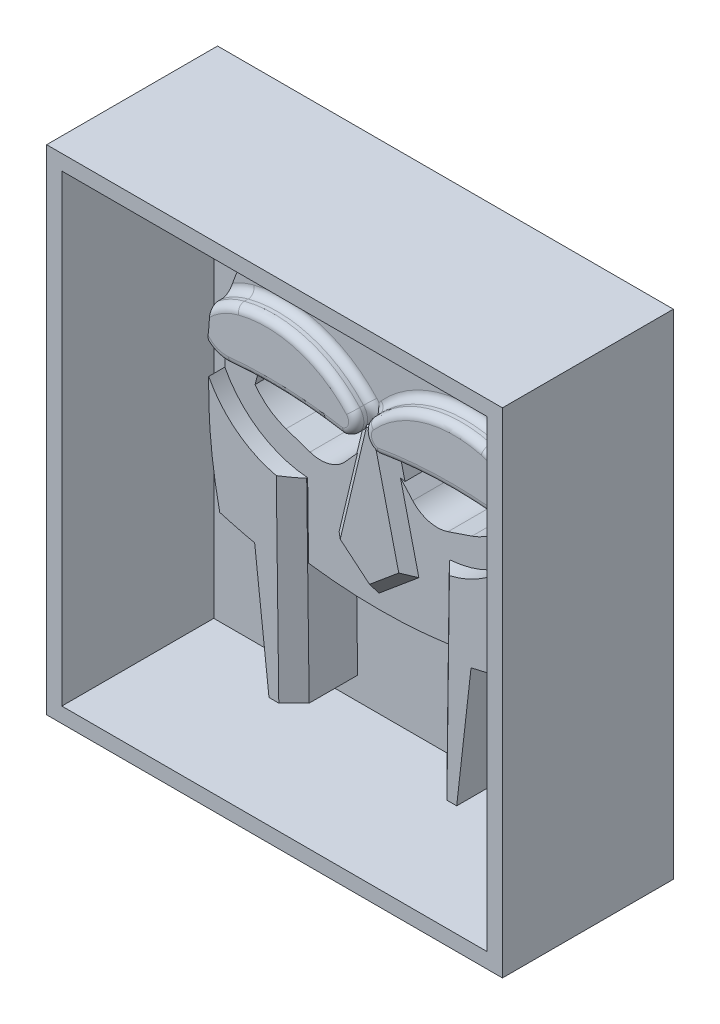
ISO-10303-21;
HEADER;
FILE_DESCRIPTION(('STEP AP214'),'2;1');
FILE_NAME('part.step','',(''),(''),'','','');
FILE_SCHEMA(('AUTOMOTIVE_DESIGN { 1 0 10303 214 1 1 1 1 }'));
ENDSEC;
DATA;
#1=APPLICATION_CONTEXT('core data for automotive mechanical design processes');
#2=APPLICATION_PROTOCOL_DEFINITION('international standard','automotive_design',2000,#1);
#3=PRODUCT_CONTEXT('',#1,'mechanical');
#4=PRODUCT('Part','Part','',(#3));
#5=PRODUCT_RELATED_PRODUCT_CATEGORY('part','',(#4));
#6=PRODUCT_DEFINITION_FORMATION('','',#4);
#7=PRODUCT_DEFINITION_CONTEXT('part definition',#1,'design');
#8=PRODUCT_DEFINITION('design','',#6,#7);
#9=PRODUCT_DEFINITION_SHAPE('','',#8);
#10=(LENGTH_UNIT() NAMED_UNIT(*) SI_UNIT(.MILLI.,.METRE.));
#11=(NAMED_UNIT(*) PLANE_ANGLE_UNIT() SI_UNIT($,.RADIAN.));
#12=(NAMED_UNIT(*) SI_UNIT($,.STERADIAN.) SOLID_ANGLE_UNIT());
#13=UNCERTAINTY_MEASURE_WITH_UNIT(LENGTH_MEASURE(1.E-05),#10,'distance_accuracy_value','');
#14=(GEOMETRIC_REPRESENTATION_CONTEXT(3) GLOBAL_UNCERTAINTY_ASSIGNED_CONTEXT((#13)) GLOBAL_UNIT_ASSIGNED_CONTEXT((#10,
#11,#12)) REPRESENTATION_CONTEXT('',''));
#15=CARTESIAN_POINT('',(0.,0.,0.));
#16=DIRECTION('',(0.,0.,1.));
#17=DIRECTION('',(1.,0.,0.));
#18=AXIS2_PLACEMENT_3D('',#15,#16,#17);
#19=CARTESIAN_POINT('',(10.282665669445,81.3315907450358,45.));
#20=DIRECTION('',(0.,0.,-1.));
#21=DIRECTION('',(-1.,0.,0.));
#22=AXIS2_PLACEMENT_3D('',#19,#20,#21);
#23=CYLINDRICAL_SURFACE('',#22,8.30108254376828);
#24=DIRECTION('',(0.,0.,-1.));
#25=VECTOR('',#24,1.);
#26=CARTESIAN_POINT('',(4.12605366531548,86.8997232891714,45.));
#27=LINE('',#26,#25);
#28=CARTESIAN_POINT('',(4.12605366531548,86.8997232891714,41.));
#29=VERTEX_POINT('',#28);
#30=CARTESIAN_POINT('',(4.12605366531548,86.8997232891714,39.));
#31=VERTEX_POINT('',#30);
#32=EDGE_CURVE('E852',#29,#31,#27,.T.);
#33=ORIENTED_EDGE('',*,*,#32,.T.);
#34=CARTESIAN_POINT('',(10.282665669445,81.3315907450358,39.));
#35=DIRECTION('',(0.,0.,1.));
#36=DIRECTION('',(1.,0.,0.));
#37=AXIS2_PLACEMENT_3D('',#34,#35,#36);
#38=CIRCLE('',#37,8.30108254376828);
#39=CARTESIAN_POINT('',(2.36885852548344,78.8256721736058,39.));
#40=VERTEX_POINT('',#39);
#41=EDGE_CURVE('E1444',#31,#40,#38,.T.);
#42=ORIENTED_EDGE('',*,*,#41,.T.);
#43=DIRECTION('',(0.,0.,-1.));
#44=VECTOR('',#43,1.);
#45=CARTESIAN_POINT('',(2.36885852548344,78.8256721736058,40.));
#46=LINE('',#45,#44);
#47=CARTESIAN_POINT('',(2.36885852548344,78.8256721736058,39.2284114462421));
#48=VERTEX_POINT('',#47);
#49=EDGE_CURVE('E834',#48,#40,#46,.T.);
#50=ORIENTED_EDGE('',*,*,#49,.F.);
#51=CARTESIAN_POINT('',(10.282665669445,81.3315907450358,30.9494133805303));
#52=DIRECTION('',(0.687884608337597,0.163752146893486,0.707106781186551));
#53=DIRECTION('',(0.687884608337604,0.163752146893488,-0.707106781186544));
#54=AXIS2_PLACEMENT_3D('',#51,#52,#53);
#55=ELLIPSE('',#54,11.7395035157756,8.30108254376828);
#56=CARTESIAN_POINT('',(9.10286088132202,73.1147767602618,34.));
#57=VERTEX_POINT('',#56);
#58=EDGE_CURVE('E1459',#48,#57,#55,.T.);
#59=ORIENTED_EDGE('',*,*,#58,.T.);
#60=DIRECTION('',(0.,0.,-1.));
#61=VECTOR('',#60,1.);
#62=CARTESIAN_POINT('',(9.10286088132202,73.1147767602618,40.));
#63=LINE('',#62,#61);
#64=CARTESIAN_POINT('',(9.10286088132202,73.1147767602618,40.));
#65=VERTEX_POINT('',#64);
#66=EDGE_CURVE('E1500',#65,#57,#63,.T.);
#67=ORIENTED_EDGE('',*,*,#66,.F.);
#68=DIRECTION('',(0.,0.,-1.));
#69=VECTOR('',#68,1.);
#70=CARTESIAN_POINT('',(9.10286088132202,73.1147767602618,45.));
#71=LINE('',#70,#69);
#72=CARTESIAN_POINT('',(9.10286088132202,73.1147767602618,41.));
#73=VERTEX_POINT('',#72);
#74=EDGE_CURVE('E848',#73,#65,#71,.T.);
#75=ORIENTED_EDGE('',*,*,#74,.F.);
#76=CARTESIAN_POINT('',(10.282665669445,81.3315907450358,41.));
#77=DIRECTION('',(0.,0.,1.));
#78=DIRECTION('',(1.,0.,0.));
#79=AXIS2_PLACEMENT_3D('',#76,#77,#78);
#80=CIRCLE('',#79,8.30108254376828);
#81=EDGE_CURVE('E1439',#73,#29,#80,.F.);
#82=ORIENTED_EDGE('',*,*,#81,.T.);
#83=EDGE_LOOP('',(#33,#42,#50,#59,#67,#75,#82));
#84=FACE_BOUND('',#83,.T.);
#85=ADVANCED_FACE('F165',(#84),#23,.T.);
#86=CARTESIAN_POINT('',(-10.282665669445,81.3315907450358,45.));
#87=DIRECTION('',(0.,0.,-1.));
#88=DIRECTION('',(-1.,0.,0.));
#89=AXIS2_PLACEMENT_3D('',#86,#87,#88);
#90=CYLINDRICAL_SURFACE('',#89,8.30108254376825);
#91=DIRECTION('',(0.,0.,-1.));
#92=VECTOR('',#91,1.);
#93=CARTESIAN_POINT('',(-9.10286088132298,73.1147767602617,45.));
#94=LINE('',#93,#92);
#95=CARTESIAN_POINT('',(-9.10286088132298,73.1147767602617,41.));
#96=VERTEX_POINT('',#95);
#97=CARTESIAN_POINT('',(-9.10286088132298,73.1147767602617,35.));
#98=VERTEX_POINT('',#97);
#99=EDGE_CURVE('E915',#96,#98,#94,.T.);
#100=ORIENTED_EDGE('',*,*,#99,.T.);
#101=DIRECTION('',(0.,0.,-1.));
#102=VECTOR('',#101,1.);
#103=CARTESIAN_POINT('',(-9.10286088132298,73.1147767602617,35.));
#104=LINE('',#103,#102);
#105=CARTESIAN_POINT('',(-9.10286088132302,73.1147767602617,33.9999999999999));
#106=VERTEX_POINT('',#105);
#107=EDGE_CURVE('E1503',#98,#106,#104,.T.);
#108=ORIENTED_EDGE('',*,*,#107,.T.);
#109=CARTESIAN_POINT('',(-10.282665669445,81.3315907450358,30.9494133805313));
#110=DIRECTION('',(0.687884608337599,-0.163752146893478,-0.707106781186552));
#111=DIRECTION('',(-0.687884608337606,0.16375214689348,-0.707106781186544));
#112=AXIS2_PLACEMENT_3D('',#109,#110,#111);
#113=ELLIPSE('',#112,11.7395035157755,8.30108254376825);
#114=CARTESIAN_POINT('',(-2.36885852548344,78.8256721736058,39.2284114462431));
#115=VERTEX_POINT('',#114);
#116=EDGE_CURVE('E1481',#106,#115,#113,.F.);
#117=ORIENTED_EDGE('',*,*,#116,.T.);
#118=DIRECTION('',(0.,0.,-1.));
#119=VECTOR('',#118,1.);
#120=CARTESIAN_POINT('',(-2.36885852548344,78.8256721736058,40.));
#121=LINE('',#120,#119);
#122=CARTESIAN_POINT('',(-2.36885852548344,78.8256721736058,39.));
#123=VERTEX_POINT('',#122);
#124=EDGE_CURVE('E830',#115,#123,#121,.T.);
#125=ORIENTED_EDGE('',*,*,#124,.T.);
#126=CARTESIAN_POINT('',(-10.282665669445,81.3315907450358,39.));
#127=DIRECTION('',(0.,0.,1.));
#128=DIRECTION('',(1.,0.,0.));
#129=AXIS2_PLACEMENT_3D('',#126,#127,#128);
#130=CIRCLE('',#129,8.30108254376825);
#131=CARTESIAN_POINT('',(-4.12605366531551,86.8997232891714,39.));
#132=VERTEX_POINT('',#131);
#133=EDGE_CURVE('E1192',#123,#132,#130,.T.);
#134=ORIENTED_EDGE('',*,*,#133,.T.);
#135=DIRECTION('',(0.,0.,-1.));
#136=VECTOR('',#135,1.);
#137=CARTESIAN_POINT('',(-4.12605366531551,86.8997232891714,45.));
#138=LINE('',#137,#136);
#139=CARTESIAN_POINT('',(-4.12605366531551,86.8997232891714,41.));
#140=VERTEX_POINT('',#139);
#141=EDGE_CURVE('E940',#140,#132,#138,.T.);
#142=ORIENTED_EDGE('',*,*,#141,.F.);
#143=CARTESIAN_POINT('',(-10.282665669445,81.3315907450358,41.));
#144=DIRECTION('',(0.,0.,1.));
#145=DIRECTION('',(1.,0.,0.));
#146=AXIS2_PLACEMENT_3D('',#143,#144,#145);
#147=CIRCLE('',#146,8.30108254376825);
#148=EDGE_CURVE('E1189',#140,#96,#147,.F.);
#149=ORIENTED_EDGE('',*,*,#148,.T.);
#150=EDGE_LOOP('',(#100,#108,#117,#125,#134,#142,#149));
#151=FACE_BOUND('',#150,.T.);
#152=ADVANCED_FACE('F1359',(#151),#90,.T.);
#153=CARTESIAN_POINT('',(0.,260.464771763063,43.5));
#154=DIRECTION('',(0.,0.,-1.));
#155=DIRECTION('',(-1.,0.,0.));
#156=AXIS2_PLACEMENT_3D('',#153,#154,#155);
#157=CYLINDRICAL_SURFACE('',#156,266.621586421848);
#158=CARTESIAN_POINT('',(0.,260.464771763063,10.));
#159=DIRECTION('',(0.,0.,1.));
#160=DIRECTION('',(1.,0.,0.));
#161=AXIS2_PLACEMENT_3D('',#158,#159,#160);
#162=CIRCLE('',#161,266.621586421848);
#163=CARTESIAN_POINT('',(-56.966420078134,0.,10.));
#164=VERTEX_POINT('',#163);
#165=CARTESIAN_POINT('',(-75.3418088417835,4.70965023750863,10.));
#166=VERTEX_POINT('',#165);
#167=EDGE_CURVE('E809',#164,#166,#162,.F.);
#168=ORIENTED_EDGE('',*,*,#167,.F.);
#169=DIRECTION('',(0.,0.,-1.));
#170=VECTOR('',#169,1.);
#171=CARTESIAN_POINT('',(-56.966420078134,0.,43.5));
#172=LINE('',#171,#170);
#173=CARTESIAN_POINT('',(-56.966420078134,0.,43.5));
#174=VERTEX_POINT('',#173);
#175=EDGE_CURVE('E1166',#174,#164,#172,.T.);
#176=ORIENTED_EDGE('',*,*,#175,.F.);
#177=CARTESIAN_POINT('',(0.,260.464771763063,43.5));
#178=DIRECTION('',(0.,0.,1.));
#179=DIRECTION('',(1.,0.,0.));
#180=AXIS2_PLACEMENT_3D('',#177,#178,#179);
#181=CIRCLE('',#180,266.621586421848);
#182=CARTESIAN_POINT('',(-75.3418088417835,4.70965023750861,43.5));
#183=VERTEX_POINT('',#182);
#184=EDGE_CURVE('E1130',#174,#183,#181,.F.);
#185=ORIENTED_EDGE('',*,*,#184,.T.);
#186=DIRECTION('',(0.,0.,-1.));
#187=VECTOR('',#186,1.);
#188=CARTESIAN_POINT('',(-75.3418088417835,4.70965023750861,43.5));
#189=LINE('',#188,#187);
#190=EDGE_CURVE('E1147',#183,#166,#189,.T.);
#191=ORIENTED_EDGE('',*,*,#190,.T.);
#192=EDGE_LOOP('',(#168,#176,#185,#191));
#193=FACE_BOUND('',#192,.T.);
#194=ADVANCED_FACE('F1365',(#193),#157,.T.);
#195=CARTESIAN_POINT('',(-56.2461686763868,-6.36485520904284,43.5));
#196=DIRECTION('',(-0.993658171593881,-0.112443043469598,0.));
#197=DIRECTION('',(0.112443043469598,-0.993658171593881,0.));
#198=AXIS2_PLACEMENT_3D('',#195,#196,#197);
#199=PLANE('',#198);
#200=DIRECTION('',(-0.112443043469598,0.993658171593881,0.));
#201=VECTOR('',#200,1.);
#202=CARTESIAN_POINT('',(-56.2461686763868,-6.36485520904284,10.));
#203=LINE('',#202,#201);
#204=CARTESIAN_POINT('',(-49.4132791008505,-66.7470394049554,10.));
#205=VERTEX_POINT('',#204);
#206=EDGE_CURVE('E806',#205,#164,#203,.T.);
#207=ORIENTED_EDGE('',*,*,#206,.F.);
#208=DIRECTION('',(0.,0.,-1.));
#209=VECTOR('',#208,1.);
#210=CARTESIAN_POINT('',(-49.4132791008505,-66.7470394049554,43.5));
#211=LINE('',#210,#209);
#212=CARTESIAN_POINT('',(-49.4132791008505,-66.7470394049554,43.5));
#213=VERTEX_POINT('',#212);
#214=EDGE_CURVE('E1162',#213,#205,#211,.T.);
#215=ORIENTED_EDGE('',*,*,#214,.F.);
#216=DIRECTION('',(-0.112443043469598,0.993658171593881,0.));
#217=VECTOR('',#216,1.);
#218=CARTESIAN_POINT('',(-56.2461686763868,-6.36485520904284,43.5));
#219=LINE('',#218,#217);
#220=EDGE_CURVE('E1134',#213,#174,#219,.T.);
#221=ORIENTED_EDGE('',*,*,#220,.T.);
#222=ORIENTED_EDGE('',*,*,#175,.T.);
#223=EDGE_LOOP('',(#207,#215,#221,#222));
#224=FACE_BOUND('',#223,.T.);
#225=ADVANCED_FACE('F1567',(#224),#199,.T.);
#226=CARTESIAN_POINT('',(0.,-66.7470394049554,43.5));
#227=DIRECTION('',(0.,-1.,0.));
#228=DIRECTION('',(0.,0.,-1.));
#229=AXIS2_PLACEMENT_3D('',#226,#227,#228);
#230=PLANE('',#229);
#231=DIRECTION('',(-1.,0.,0.));
#232=VECTOR('',#231,1.);
#233=CARTESIAN_POINT('',(0.,-66.7470394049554,10.));
#234=LINE('',#233,#232);
#235=CARTESIAN_POINT('',(-36.2609479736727,-66.7470394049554,10.));
#236=VERTEX_POINT('',#235);
#237=EDGE_CURVE('E803',#236,#205,#234,.T.);
#238=ORIENTED_EDGE('',*,*,#237,.F.);
#239=DIRECTION('',(0.,0.,-1.));
#240=VECTOR('',#239,1.);
#241=CARTESIAN_POINT('',(-36.2609479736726,-66.7470394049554,43.5));
#242=LINE('',#241,#240);
#243=CARTESIAN_POINT('',(-36.2609479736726,-66.7470394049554,35.5));
#244=VERTEX_POINT('',#243);
#245=EDGE_CURVE('E1158',#244,#236,#242,.T.);
#246=ORIENTED_EDGE('',*,*,#245,.F.);
#247=DIRECTION('',(0.70713577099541,0.,-0.707077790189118));
#248=VECTOR('',#247,1.);
#249=CARTESIAN_POINT('',(-22.1289873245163,-66.7470394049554,21.369198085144));
#250=LINE('',#249,#248);
#251=CARTESIAN_POINT('',(-44.2616039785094,-66.7470394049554,43.5));
#252=VERTEX_POINT('',#251);
#253=EDGE_CURVE('E1535',#244,#252,#250,.F.);
#254=ORIENTED_EDGE('',*,*,#253,.T.);
#255=DIRECTION('',(-1.,0.,0.));
#256=VECTOR('',#255,1.);
#257=CARTESIAN_POINT('',(0.,-66.7470394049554,43.5));
#258=LINE('',#257,#256);
#259=EDGE_CURVE('E1138',#252,#213,#258,.T.);
#260=ORIENTED_EDGE('',*,*,#259,.T.);
#261=ORIENTED_EDGE('',*,*,#214,.T.);
#262=EDGE_LOOP('',(#238,#246,#254,#260,#261));
#263=FACE_BOUND('',#262,.T.);
#264=ADVANCED_FACE('F1559',(#263),#230,.T.);
#265=CARTESIAN_POINT('',(-37.1096615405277,-0.475247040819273,43.5));
#266=DIRECTION('',(0.999918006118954,0.0128055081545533,0.));
#267=DIRECTION('',(-0.0128055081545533,0.999918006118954,0.));
#268=AXIS2_PLACEMENT_3D('',#265,#266,#267);
#269=PLANE('',#268);
#270=DIRECTION('',(0.0128055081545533,-0.999918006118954,0.));
#271=VECTOR('',#270,1.);
#272=CARTESIAN_POINT('',(-37.1096615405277,-0.475247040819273,10.));
#273=LINE('',#272,#271);
#274=CARTESIAN_POINT('',(-37.0700642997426,-3.56719728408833,10.));
#275=VERTEX_POINT('',#274);
#276=EDGE_CURVE('E800',#275,#236,#273,.T.);
#277=ORIENTED_EDGE('',*,*,#276,.F.);
#278=DIRECTION('',(0.,0.,-1.));
#279=VECTOR('',#278,1.);
#280=CARTESIAN_POINT('',(-37.0700642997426,-3.56719728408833,35.));
#281=LINE('',#280,#279);
#282=CARTESIAN_POINT('',(-37.0700642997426,-3.56719728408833,35.));
#283=VERTEX_POINT('',#282);
#284=EDGE_CURVE('E1126',#283,#275,#281,.T.);
#285=ORIENTED_EDGE('',*,*,#284,.F.);
#286=DIRECTION('',(0.0128055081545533,-0.999918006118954,0.));
#287=VECTOR('',#286,1.);
#288=CARTESIAN_POINT('',(-37.1096615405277,-0.475247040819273,35.));
#289=LINE('',#288,#287);
#290=CARTESIAN_POINT('',(-37.5660877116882,35.1647870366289,35.));
#291=VERTEX_POINT('',#290);
#292=EDGE_CURVE('E999',#291,#283,#289,.T.);
#293=ORIENTED_EDGE('',*,*,#292,.F.);
#294=DIRECTION('',(0.,0.,-1.));
#295=VECTOR('',#294,1.);
#296=CARTESIAN_POINT('',(-37.5660877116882,35.1647870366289,43.5));
#297=LINE('',#296,#295);
#298=CARTESIAN_POINT('',(-37.5660877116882,35.1647870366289,35.5));
#299=VERTEX_POINT('',#298);
#300=EDGE_CURVE('E1155',#299,#291,#297,.T.);
#301=ORIENTED_EDGE('',*,*,#300,.F.);
#302=DIRECTION('',(0.0128055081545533,-0.999918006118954,0.));
#303=VECTOR('',#302,1.);
#304=CARTESIAN_POINT('',(-37.1096615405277,-0.475247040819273,35.5));
#305=LINE('',#304,#303);
#306=EDGE_CURVE('E1531',#299,#244,#305,.T.);
#307=ORIENTED_EDGE('',*,*,#306,.T.);
#308=ORIENTED_EDGE('',*,*,#245,.T.);
#309=EDGE_LOOP('',(#277,#285,#293,#301,#307,#308));
#310=FACE_BOUND('',#309,.T.);
#311=ADVANCED_FACE('F1553',(#310),#269,.T.);
#312=CARTESIAN_POINT('',(-33.6224395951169,88.6805618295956,43.5));
#313=DIRECTION('',(0.,0.,-1.));
#314=DIRECTION('',(-1.,0.,0.));
#315=AXIS2_PLACEMENT_3D('',#312,#313,#314);
#316=CYLINDRICAL_SURFACE('',#315,53.6608843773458);
#317=CARTESIAN_POINT('',(-33.6224395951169,88.6805618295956,43.5));
#318=DIRECTION('',(0.,0.,1.));
#319=DIRECTION('',(1.,0.,0.));
#320=AXIS2_PLACEMENT_3D('',#317,#318,#319);
#321=CIRCLE('',#320,53.6608843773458);
#322=CARTESIAN_POINT('',(-45.5821709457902,36.3694221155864,43.5));
#323=VERTEX_POINT('',#322);
#324=CARTESIAN_POINT('',(-81.1686397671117,63.8038787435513,43.5));
#325=VERTEX_POINT('',#324);
#326=EDGE_CURVE('E1141',#323,#325,#321,.F.);
#327=ORIENTED_EDGE('',*,*,#326,.F.);
#328=CARTESIAN_POINT('',(-33.6224395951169,88.6805618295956,30.8713785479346));
#329=DIRECTION('',(-0.707048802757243,-0.00905486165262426,-0.707106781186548));
#330=DIRECTION('',(0.707048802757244,0.00905486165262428,-0.707106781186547));
#331=AXIS2_PLACEMENT_3D('',#328,#329,#330);
#332=ELLIPSE('',#331,75.8879504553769,53.6608843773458);
#333=EDGE_CURVE('E175',#323,#299,#332,.F.);
#334=ORIENTED_EDGE('',*,*,#333,.T.);
#335=ORIENTED_EDGE('',*,*,#300,.T.);
#336=CARTESIAN_POINT('',(-33.6224395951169,88.6805618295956,35.));
#337=DIRECTION('',(0.,0.,1.));
#338=DIRECTION('',(1.,0.,0.));
#339=AXIS2_PLACEMENT_3D('',#336,#337,#338);
#340=CIRCLE('',#339,53.6608843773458);
#341=CARTESIAN_POINT('',(-81.1686397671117,63.8038787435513,35.));
#342=VERTEX_POINT('',#341);
#343=EDGE_CURVE('E995',#291,#342,#340,.F.);
#344=ORIENTED_EDGE('',*,*,#343,.T.);
#345=DIRECTION('',(0.,0.,-1.));
#346=VECTOR('',#345,1.);
#347=CARTESIAN_POINT('',(-81.1686397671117,63.8038787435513,43.5));
#348=LINE('',#347,#346);
#349=EDGE_CURVE('E1151',#325,#342,#348,.T.);
#350=ORIENTED_EDGE('',*,*,#349,.F.);
#351=EDGE_LOOP('',(#327,#334,#335,#344,#350));
#352=FACE_BOUND('',#351,.T.);
#353=ADVANCED_FACE('F1545',(#352),#316,.F.);
#354=CARTESIAN_POINT('',(172.473218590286,58.9791829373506,43.5));
#355=DIRECTION('',(0.,0.,-1.));
#356=DIRECTION('',(-1.,0.,0.));
#357=AXIS2_PLACEMENT_3D('',#354,#355,#356);
#358=CYLINDRICAL_SURFACE('',#357,253.687741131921);
#359=DIRECTION('',(0.,0.,-1.));
#360=VECTOR('',#359,1.);
#361=CARTESIAN_POINT('',(-79.4258938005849,89.0508835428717,45.));
#362=LINE('',#361,#360);
#363=CARTESIAN_POINT('',(-79.4258938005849,89.0508835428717,45.));
#364=VERTEX_POINT('',#363);
#365=CARTESIAN_POINT('',(-79.4258938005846,89.0508835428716,10.));
#366=VERTEX_POINT('',#365);
#367=EDGE_CURVE('E924',#364,#366,#362,.T.);
#368=ORIENTED_EDGE('',*,*,#367,.T.);
#369=CARTESIAN_POINT('',(172.473218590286,58.9791829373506,10.));
#370=DIRECTION('',(0.,0.,1.));
#371=DIRECTION('',(1.,0.,0.));
#372=AXIS2_PLACEMENT_3D('',#369,#370,#371);
#373=CIRCLE('',#372,253.687741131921);
#374=EDGE_CURVE('E818',#366,#166,#373,.T.);
#375=ORIENTED_EDGE('',*,*,#374,.T.);
#376=ORIENTED_EDGE('',*,*,#190,.F.);
#377=CARTESIAN_POINT('',(172.473218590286,58.9791829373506,43.5));
#378=DIRECTION('',(0.,0.,1.));
#379=DIRECTION('',(1.,0.,0.));
#380=AXIS2_PLACEMENT_3D('',#377,#378,#379);
#381=CIRCLE('',#380,253.687741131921);
#382=EDGE_CURVE('E1144',#325,#183,#381,.T.);
#383=ORIENTED_EDGE('',*,*,#382,.F.);
#384=ORIENTED_EDGE('',*,*,#349,.T.);
#385=CARTESIAN_POINT('',(172.473218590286,58.9791829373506,35.));
#386=DIRECTION('',(0.,0.,1.));
#387=DIRECTION('',(1.,0.,0.));
#388=AXIS2_PLACEMENT_3D('',#385,#386,#387);
#389=CIRCLE('',#388,253.687741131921);
#390=CARTESIAN_POINT('',(-80.4339211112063,78.8650746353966,35.));
#391=VERTEX_POINT('',#390);
#392=EDGE_CURVE('E992',#391,#342,#389,.T.);
#393=ORIENTED_EDGE('',*,*,#392,.F.);
#394=DIRECTION('',(0.,0.,-1.));
#395=VECTOR('',#394,1.);
#396=CARTESIAN_POINT('',(-80.4339211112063,78.8650746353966,45.));
#397=LINE('',#396,#395);
#398=CARTESIAN_POINT('',(-80.4339211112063,78.8650746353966,41.));
#399=VERTEX_POINT('',#398);
#400=EDGE_CURVE('E921',#399,#391,#397,.T.);
#401=ORIENTED_EDGE('',*,*,#400,.F.);
#402=CARTESIAN_POINT('',(-80.4339211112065,78.8650746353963,41.));
#403=CARTESIAN_POINT('',(-80.4339221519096,78.8650555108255,41.0983151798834));
#404=CARTESIAN_POINT('',(-80.4335806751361,78.8694041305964,41.1966209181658));
#405=CARTESIAN_POINT('',(-80.4322208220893,78.8866904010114,41.3924384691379));
#406=CARTESIAN_POINT('',(-80.4312026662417,78.8996252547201,41.4899505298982));
#407=CARTESIAN_POINT('',(-80.4285035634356,78.9338618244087,41.683042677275));
#408=CARTESIAN_POINT('',(-80.4268255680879,78.9551262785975,41.7786294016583));
#409=CARTESIAN_POINT('',(-80.422823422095,79.0057297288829,41.9676028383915));
#410=CARTESIAN_POINT('',(-80.4204992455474,79.0350690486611,42.0609894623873));
#411=CARTESIAN_POINT('',(-80.4125892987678,79.1346448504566,42.336715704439));
#412=CARTESIAN_POINT('',(-80.4060612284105,79.2165017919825,42.5149670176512));
#413=CARTESIAN_POINT('',(-80.3907026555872,79.407507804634,42.8560451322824));
#414=CARTESIAN_POINT('',(-80.3818700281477,79.5166820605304,43.0188575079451));
#415=CARTESIAN_POINT('',(-80.3616595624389,79.7640450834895,43.3338178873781));
#416=CARTESIAN_POINT('',(-80.3501772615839,79.9034038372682,43.4850371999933));
#417=CARTESIAN_POINT('',(-80.3252549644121,80.2023840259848,43.765412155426));
#418=CARTESIAN_POINT('',(-80.3118153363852,80.3620016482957,43.8945719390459));
#419=CARTESIAN_POINT('',(-80.2811500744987,80.7216819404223,44.1477713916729));
#420=CARTESIAN_POINT('',(-80.2636584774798,80.9242347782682,44.2682277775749));
#421=CARTESIAN_POINT('',(-80.2268290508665,81.3443459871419,44.4801614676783));
#422=CARTESIAN_POINT('',(-80.2074861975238,81.5619447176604,44.5715568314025));
#423=CARTESIAN_POINT('',(-80.1714160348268,81.9615760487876,44.710796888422));
#424=CARTESIAN_POINT('',(-80.1549503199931,82.1419073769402,44.7637103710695));
#425=CARTESIAN_POINT('',(-80.1212338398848,82.5067453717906,44.8528992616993));
#426=CARTESIAN_POINT('',(-80.1039822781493,82.6912561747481,44.8891573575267));
#427=CARTESIAN_POINT('',(-80.068964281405,83.0613371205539,44.9459216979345));
#428=CARTESIAN_POINT('',(-80.0512019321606,83.2468925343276,44.9665290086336));
#429=CARTESIAN_POINT('',(-80.015207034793,83.6185814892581,44.9935531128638));
#430=CARTESIAN_POINT('',(-79.9969756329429,83.8047127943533,45.0000016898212));
#431=CARTESIAN_POINT('',(-79.9785448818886,83.9907226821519,45.));
#432=B_SPLINE_CURVE_WITH_KNOTS('',3,(#402,#403,#404,#405,#406,#407,#408,#409,#410,#411,#412,
#413,#414,#415,#416,#417,#418,#419,#420,#421,#422,#423,#424,#425,#426,#427,#428,#429,#430,#431),
.UNSPECIFIED.,.F.,.F.,(4,2,2,2,2,2,2,2,2,2,2,2,2,2,4),(0.,0.294833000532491,0.589570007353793,
0.883003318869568,1.1764483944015,1.7622991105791,2.34869194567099,2.96415223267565,
3.57949686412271,4.28586125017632,4.99419999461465,5.55936325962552,6.1251126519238,
6.68717686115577,7.24797805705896),.UNSPECIFIED.);
#433=CARTESIAN_POINT('',(-79.9785448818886,83.9907226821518,45.));
#434=VERTEX_POINT('',#433);
#435=EDGE_CURVE('E1591',#399,#434,#432,.T.);
#436=ORIENTED_EDGE('',*,*,#435,.T.);
#437=CARTESIAN_POINT('',(172.473218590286,58.9791829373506,45.));
#438=DIRECTION('',(0.,0.,1.));
#439=DIRECTION('',(1.,0.,0.));
#440=AXIS2_PLACEMENT_3D('',#437,#438,#439);
#441=CIRCLE('',#440,253.687741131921);
#442=EDGE_CURVE('E911',#364,#434,#441,.T.);
#443=ORIENTED_EDGE('',*,*,#442,.F.);
#444=EDGE_LOOP('',(#368,#375,#376,#383,#384,#393,#401,#436,#443));
#445=FACE_BOUND('',#444,.T.);
#446=ADVANCED_FACE('F1579',(#445),#358,.T.);
#447=CARTESIAN_POINT('',(0.,0.,43.5));
#448=DIRECTION('',(0.,0.,1.));
#449=DIRECTION('',(1.,0.,0.));
#450=AXIS2_PLACEMENT_3D('',#447,#448,#449);
#451=PLANE('',#450);
#452=ORIENTED_EDGE('',*,*,#259,.F.);
#453=DIRECTION('',(-0.0128055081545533,0.999918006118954,0.));
#454=VECTOR('',#453,1.);
#455=CARTESIAN_POINT('',(-45.1090055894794,-0.5776911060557,43.5));
#456=LINE('',#455,#454);
#457=EDGE_CURVE('E1538',#252,#323,#456,.T.);
#458=ORIENTED_EDGE('',*,*,#457,.T.);
#459=ORIENTED_EDGE('',*,*,#326,.T.);
#460=ORIENTED_EDGE('',*,*,#382,.T.);
#461=ORIENTED_EDGE('',*,*,#184,.F.);
#462=ORIENTED_EDGE('',*,*,#220,.F.);
#463=EDGE_LOOP('',(#452,#458,#459,#460,#461,#462));
#464=FACE_BOUND('',#463,.T.);
#465=ADVANCED_FACE('F1563',(#464),#451,.T.);
#466=CARTESIAN_POINT('',(0.,260.464771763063,35.));
#467=DIRECTION('',(0.,0.,-1.));
#468=DIRECTION('',(-1.,0.,0.));
#469=AXIS2_PLACEMENT_3D('',#466,#467,#468);
#470=CYLINDRICAL_SURFACE('',#469,266.621586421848);
#471=CARTESIAN_POINT('',(0.,260.464771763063,10.));
#472=DIRECTION('',(0.,0.,1.));
#473=DIRECTION('',(1.,0.,0.));
#474=AXIS2_PLACEMENT_3D('',#471,#472,#473);
#475=CIRCLE('',#474,266.621586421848);
#476=CARTESIAN_POINT('',(37.0700642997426,-3.56719728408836,10.));
#477=VERTEX_POINT('',#476);
#478=EDGE_CURVE('E797',#477,#275,#475,.F.);
#479=ORIENTED_EDGE('',*,*,#478,.F.);
#480=DIRECTION('',(0.,0.,-1.));
#481=VECTOR('',#480,1.);
#482=CARTESIAN_POINT('',(37.0700642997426,-3.56719728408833,35.));
#483=LINE('',#482,#481);
#484=CARTESIAN_POINT('',(37.0700642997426,-3.56719728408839,35.));
#485=VERTEX_POINT('',#484);
#486=EDGE_CURVE('E1122',#485,#477,#483,.T.);
#487=ORIENTED_EDGE('',*,*,#486,.F.);
#488=CARTESIAN_POINT('',(0.,260.464771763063,35.));
#489=DIRECTION('',(0.,0.,1.));
#490=DIRECTION('',(1.,0.,0.));
#491=AXIS2_PLACEMENT_3D('',#488,#489,#490);
#492=CIRCLE('',#491,266.621586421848);
#493=EDGE_CURVE('E1002',#485,#283,#492,.F.);
#494=ORIENTED_EDGE('',*,*,#493,.T.);
#495=ORIENTED_EDGE('',*,*,#284,.T.);
#496=EDGE_LOOP('',(#479,#487,#494,#495));
#497=FACE_BOUND('',#496,.T.);
#498=ADVANCED_FACE('F1570',(#497),#470,.T.);
#499=CARTESIAN_POINT('',(-172.473218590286,58.9791829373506,35.));
#500=DIRECTION('',(0.,0.,-1.));
#501=DIRECTION('',(-1.,0.,0.));
#502=AXIS2_PLACEMENT_3D('',#499,#500,#501);
#503=CYLINDRICAL_SURFACE('',#502,253.687741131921);
#504=CARTESIAN_POINT('',(-172.473218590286,58.9791829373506,10.));
#505=DIRECTION('',(0.,0.,1.));
#506=DIRECTION('',(1.,0.,0.));
#507=AXIS2_PLACEMENT_3D('',#504,#505,#506);
#508=CIRCLE('',#507,253.687741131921);
#509=CARTESIAN_POINT('',(79.4258938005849,89.0508835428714,10.));
#510=VERTEX_POINT('',#509);
#511=CARTESIAN_POINT('',(75.3418088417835,4.70965023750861,10.));
#512=VERTEX_POINT('',#511);
#513=EDGE_CURVE('E775',#510,#512,#508,.F.);
#514=ORIENTED_EDGE('',*,*,#513,.F.);
#515=DIRECTION('',(0.,0.,-1.));
#516=VECTOR('',#515,1.);
#517=CARTESIAN_POINT('',(79.4258938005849,89.0508835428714,45.));
#518=LINE('',#517,#516);
#519=CARTESIAN_POINT('',(79.4258938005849,89.0508835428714,45.));
#520=VERTEX_POINT('',#519);
#521=EDGE_CURVE('E868',#520,#510,#518,.T.);
#522=ORIENTED_EDGE('',*,*,#521,.F.);
#523=CARTESIAN_POINT('',(-172.473218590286,58.9791829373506,45.));
#524=DIRECTION('',(0.,0.,1.));
#525=DIRECTION('',(1.,0.,0.));
#526=AXIS2_PLACEMENT_3D('',#523,#524,#525);
#527=CIRCLE('',#526,253.687741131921);
#528=CARTESIAN_POINT('',(79.9785448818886,83.9907226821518,45.));
#529=VERTEX_POINT('',#528);
#530=EDGE_CURVE('E837',#520,#529,#527,.F.);
#531=ORIENTED_EDGE('',*,*,#530,.T.);
#532=CARTESIAN_POINT('',(79.9785448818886,83.9907226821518,45.));
#533=CARTESIAN_POINT('',(79.995112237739,83.8235052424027,44.9999884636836));
#534=CARTESIAN_POINT('',(80.0115100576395,83.656295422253,44.9947881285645));
#535=CARTESIAN_POINT('',(80.0439269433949,83.3223425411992,44.9730879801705));
#536=CARTESIAN_POINT('',(80.0599454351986,83.1556004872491,44.9565720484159));
#537=CARTESIAN_POINT('',(80.1075433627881,82.65493249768,44.888338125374));
#538=CARTESIAN_POINT('',(80.138409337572,82.3231489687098,44.8179046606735));
#539=CARTESIAN_POINT('',(80.1918924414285,81.7361998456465,44.639005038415));
#540=CARTESIAN_POINT('',(80.2149779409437,81.4782337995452,44.5400112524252));
#541=CARTESIAN_POINT('',(80.2477620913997,81.1058979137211,44.361832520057));
#542=CARTESIAN_POINT('',(80.2583707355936,80.984363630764,44.2975898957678));
#543=CARTESIAN_POINT('',(80.278915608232,80.7471133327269,44.1589987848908));
#544=CARTESIAN_POINT('',(80.2888519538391,80.6313963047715,44.0846520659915));
#545=CARTESIAN_POINT('',(80.3063999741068,80.4254719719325,43.9388477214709));
#546=CARTESIAN_POINT('',(80.3141257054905,80.3341926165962,43.8689145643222));
#547=CARTESIAN_POINT('',(80.3289973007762,80.1574147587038,43.7220404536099));
#548=CARTESIAN_POINT('',(80.3361432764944,80.0719151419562,43.6451008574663));
#549=CARTESIAN_POINT('',(80.3498100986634,79.9074648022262,43.4843132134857));
#550=CARTESIAN_POINT('',(80.3563304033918,79.8285197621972,43.4004592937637));
#551=CARTESIAN_POINT('',(80.3686833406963,79.678176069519,43.226241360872));
#552=CARTESIAN_POINT('',(80.3745162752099,79.6067741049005,43.135880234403));
#553=CARTESIAN_POINT('',(80.3854894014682,79.4718259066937,42.9483084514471));
#554=CARTESIAN_POINT('',(80.390623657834,79.4083473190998,42.851048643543));
#555=CARTESIAN_POINT('',(80.4000898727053,79.2908382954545,42.6509993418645));
#556=CARTESIAN_POINT('',(80.4044222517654,79.2368029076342,42.5482127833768));
#557=CARTESIAN_POINT('',(80.4122364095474,79.1390206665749,42.3379619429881));
#558=CARTESIAN_POINT('',(80.4157192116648,79.0952614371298,42.2305034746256));
#559=CARTESIAN_POINT('',(80.4217990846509,79.0186816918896,42.0117935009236));
#560=CARTESIAN_POINT('',(80.4243965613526,78.9858561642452,41.9005437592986));
#561=CARTESIAN_POINT('',(80.4289839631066,78.9277901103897,41.6590163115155));
#562=CARTESIAN_POINT('',(80.4308329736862,78.9043170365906,41.5283012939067));
#563=CARTESIAN_POINT('',(80.432684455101,78.8807973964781,41.3309011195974));
#564=CARTESIAN_POINT('',(80.4331479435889,78.8749058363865,41.2648662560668));
#565=CARTESIAN_POINT('',(80.4337662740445,78.867043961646,41.1325600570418));
#566=CARTESIAN_POINT('',(80.4339211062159,78.8650737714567,41.0662887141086));
#567=CARTESIAN_POINT('',(80.4339211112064,78.8650746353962,41.));
#568=B_SPLINE_CURVE_WITH_KNOTS('',3,(#532,#533,#534,#535,#536,#537,#538,#539,#540,#541,#542,
#543,#544,#545,#546,#547,#548,#549,#550,#551,#552,#553,#554,#555,#556,#557,#558,#559,#560,#561,
#562,#563,#564,#565,#566,#567),.UNSPECIFIED.,.F.,.F.,(4,2,2,2,2,2,2,2,2,2,2,2,2,2,2,2,2,4),(0.,
0.503945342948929,1.00861002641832,2.02566314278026,2.85415319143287,3.26737136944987,
3.68051734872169,4.02593333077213,4.37128253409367,4.71692810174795,5.06242126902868,
5.41068722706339,5.75877001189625,6.10643140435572,6.45393321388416,6.85136390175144,
7.05015991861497,7.24896224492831),.UNSPECIFIED.);
#569=CARTESIAN_POINT('',(80.4339211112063,78.8650746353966,41.));
#570=VERTEX_POINT('',#569);
#571=EDGE_CURVE('E1721',#529,#570,#568,.T.);
#572=ORIENTED_EDGE('',*,*,#571,.T.);
#573=DIRECTION('',(0.,0.,-1.));
#574=VECTOR('',#573,1.);
#575=CARTESIAN_POINT('',(80.4339211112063,78.8650746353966,45.));
#576=LINE('',#575,#574);
#577=CARTESIAN_POINT('',(80.4339211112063,78.8650746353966,35.));
#578=VERTEX_POINT('',#577);
#579=EDGE_CURVE('E872',#570,#578,#576,.T.);
#580=ORIENTED_EDGE('',*,*,#579,.T.);
#581=CARTESIAN_POINT('',(-172.473218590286,58.9791829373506,35.));
#582=DIRECTION('',(0.,0.,1.));
#583=DIRECTION('',(1.,0.,0.));
#584=AXIS2_PLACEMENT_3D('',#581,#582,#583);
#585=CIRCLE('',#584,253.687741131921);
#586=CARTESIAN_POINT('',(81.1686397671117,63.8038787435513,35.));
#587=VERTEX_POINT('',#586);
#588=EDGE_CURVE('E1013',#578,#587,#585,.F.);
#589=ORIENTED_EDGE('',*,*,#588,.T.);
#590=DIRECTION('',(0.,0.,-1.));
#591=VECTOR('',#590,1.);
#592=CARTESIAN_POINT('',(81.1686397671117,63.8038787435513,43.5));
#593=LINE('',#592,#591);
#594=CARTESIAN_POINT('',(81.1686397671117,63.8038787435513,43.5));
#595=VERTEX_POINT('',#594);
#596=EDGE_CURVE('E961',#595,#587,#593,.T.);
#597=ORIENTED_EDGE('',*,*,#596,.F.);
#598=CARTESIAN_POINT('',(-172.473218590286,58.9791829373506,43.5));
#599=DIRECTION('',(0.,0.,1.));
#600=DIRECTION('',(1.,0.,0.));
#601=AXIS2_PLACEMENT_3D('',#598,#599,#600);
#602=CIRCLE('',#601,253.687741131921);
#603=CARTESIAN_POINT('',(75.3418088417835,4.70965023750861,43.5));
#604=VERTEX_POINT('',#603);
#605=EDGE_CURVE('E957',#595,#604,#602,.F.);
#606=ORIENTED_EDGE('',*,*,#605,.T.);
#607=DIRECTION('',(0.,0.,-1.));
#608=VECTOR('',#607,1.);
#609=CARTESIAN_POINT('',(75.3418088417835,4.70965023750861,43.5));
#610=LINE('',#609,#608);
#611=EDGE_CURVE('E965',#604,#512,#610,.T.);
#612=ORIENTED_EDGE('',*,*,#611,.T.);
#613=EDGE_LOOP('',(#514,#522,#531,#572,#580,#589,#597,#606,#612));
#614=FACE_BOUND('',#613,.T.);
#615=ADVANCED_FACE('F1714',(#614),#503,.T.);
#616=CARTESIAN_POINT('',(28.8839532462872,-38.2712381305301,35.));
#617=DIRECTION('',(0.,0.,-1.));
#618=DIRECTION('',(-1.,0.,0.));
#619=AXIS2_PLACEMENT_3D('',#616,#617,#618);
#620=CYLINDRICAL_SURFACE('',#619,113.128846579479);
#621=DIRECTION('',(0.,0.,-1.));
#622=VECTOR('',#621,1.);
#623=CARTESIAN_POINT('',(9.10286088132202,73.1147767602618,35.));
#624=LINE('',#623,#622);
#625=CARTESIAN_POINT('',(9.10286088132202,73.1147767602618,10.));
#626=VERTEX_POINT('',#625);
#627=EDGE_CURVE('E1118',#57,#626,#624,.T.);
#628=ORIENTED_EDGE('',*,*,#627,.T.);
#629=CARTESIAN_POINT('',(28.8839532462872,-38.2712381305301,10.));
#630=DIRECTION('',(0.,0.,1.));
#631=DIRECTION('',(1.,0.,0.));
#632=AXIS2_PLACEMENT_3D('',#629,#630,#631);
#633=CIRCLE('',#632,113.128846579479);
#634=CARTESIAN_POINT('',(63.7803611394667,69.3409203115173,10.));
#635=VERTEX_POINT('',#634);
#636=EDGE_CURVE('E739',#626,#635,#633,.F.);
#637=ORIENTED_EDGE('',*,*,#636,.T.);
#638=DIRECTION('',(0.,0.,-1.));
#639=VECTOR('',#638,1.);
#640=CARTESIAN_POINT('',(63.7803611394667,69.3409203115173,35.));
#641=LINE('',#640,#639);
#642=CARTESIAN_POINT('',(63.7803611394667,69.3409203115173,35.));
#643=VERTEX_POINT('',#642);
#644=EDGE_CURVE('E1114',#643,#635,#641,.T.);
#645=ORIENTED_EDGE('',*,*,#644,.F.);
#646=CARTESIAN_POINT('',(28.8839532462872,-38.2712381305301,35.));
#647=DIRECTION('',(0.,0.,1.));
#648=DIRECTION('',(1.,0.,0.));
#649=AXIS2_PLACEMENT_3D('',#646,#647,#648);
#650=CIRCLE('',#649,113.128846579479);
#651=CARTESIAN_POINT('',(9.10286088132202,73.1147767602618,35.));
#652=VERTEX_POINT('',#651);
#653=EDGE_CURVE('E1025',#652,#643,#650,.F.);
#654=ORIENTED_EDGE('',*,*,#653,.F.);
#655=DIRECTION('',(0.,0.,-1.));
#656=VECTOR('',#655,1.);
#657=CARTESIAN_POINT('',(9.10286088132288,73.114776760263,37.5));
#658=LINE('',#657,#656);
#659=EDGE_CURVE('E1497',#652,#65,#658,.F.);
#660=ORIENTED_EDGE('',*,*,#659,.T.);
#661=ORIENTED_EDGE('',*,*,#66,.T.);
#662=EDGE_LOOP('',(#628,#637,#645,#654,#660,#661));
#663=FACE_BOUND('',#662,.T.);
#664=ADVANCED_FACE('F1710',(#663),#620,.F.);
#665=CARTESIAN_POINT('',(76.8253696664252,20.5335154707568,35.));
#666=DIRECTION('',(-0.966088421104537,-0.25821146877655,0.));
#667=DIRECTION('',(0.25821146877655,-0.966088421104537,0.));
#668=AXIS2_PLACEMENT_3D('',#665,#666,#667);
#669=PLANE('',#668);
#670=DIRECTION('',(-0.25821146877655,0.966088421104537,0.));
#671=VECTOR('',#670,1.);
#672=CARTESIAN_POINT('',(76.8253696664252,20.5335154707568,10.));
#673=LINE('',#672,#671);
#674=CARTESIAN_POINT('',(65.2602749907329,63.8038787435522,10.));
#675=VERTEX_POINT('',#674);
#676=EDGE_CURVE('E736',#675,#635,#673,.T.);
#677=ORIENTED_EDGE('',*,*,#676,.F.);
#678=DIRECTION('',(0.,0.,-1.));
#679=VECTOR('',#678,1.);
#680=CARTESIAN_POINT('',(65.2602749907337,63.8038787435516,35.));
#681=LINE('',#680,#679);
#682=CARTESIAN_POINT('',(65.2602749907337,63.8038787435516,35.));
#683=VERTEX_POINT('',#682);
#684=EDGE_CURVE('E1110',#683,#675,#681,.T.);
#685=ORIENTED_EDGE('',*,*,#684,.F.);
#686=DIRECTION('',(-0.25821146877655,0.966088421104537,0.));
#687=VECTOR('',#686,1.);
#688=CARTESIAN_POINT('',(76.8253696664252,20.5335154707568,35.));
#689=LINE('',#688,#687);
#690=EDGE_CURVE('E1028',#683,#643,#689,.T.);
#691=ORIENTED_EDGE('',*,*,#690,.T.);
#692=ORIENTED_EDGE('',*,*,#644,.T.);
#693=EDGE_LOOP('',(#677,#685,#691,#692));
#694=FACE_BOUND('',#693,.T.);
#695=ADVANCED_FACE('F1706',(#694),#669,.T.);
#696=CARTESIAN_POINT('',(38.1766268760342,83.4567467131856,35.));
#697=DIRECTION('',(0.,0.,-1.));
#698=DIRECTION('',(-1.,0.,0.));
#699=AXIS2_PLACEMENT_3D('',#696,#697,#698);
#700=CYLINDRICAL_SURFACE('',#699,33.4628034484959);
#701=CARTESIAN_POINT('',(38.1766268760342,83.4567467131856,10.));
#702=DIRECTION('',(0.,0.,1.));
#703=DIRECTION('',(1.,0.,0.));
#704=AXIS2_PLACEMENT_3D('',#701,#702,#703);
#705=CIRCLE('',#704,33.4628034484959);
#706=CARTESIAN_POINT('',(48.9378115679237,51.7714801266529,10.));
#707=VERTEX_POINT('',#706);
#708=EDGE_CURVE('E733',#707,#675,#705,.T.);
#709=ORIENTED_EDGE('',*,*,#708,.F.);
#710=DIRECTION('',(0.,0.,-1.));
#711=VECTOR('',#710,1.);
#712=CARTESIAN_POINT('',(48.9378115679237,51.7714801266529,35.));
#713=LINE('',#712,#711);
#714=CARTESIAN_POINT('',(48.9378115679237,51.7714801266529,35.));
#715=VERTEX_POINT('',#714);
#716=EDGE_CURVE('E1106',#715,#707,#713,.T.);
#717=ORIENTED_EDGE('',*,*,#716,.F.);
#718=CARTESIAN_POINT('',(38.1766268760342,83.4567467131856,35.));
#719=DIRECTION('',(0.,0.,1.));
#720=DIRECTION('',(1.,0.,0.));
#721=AXIS2_PLACEMENT_3D('',#718,#719,#720);
#722=CIRCLE('',#721,33.4628034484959);
#723=EDGE_CURVE('E1032',#715,#683,#722,.T.);
#724=ORIENTED_EDGE('',*,*,#723,.T.);
#725=ORIENTED_EDGE('',*,*,#684,.T.);
#726=EDGE_LOOP('',(#709,#717,#724,#725));
#727=FACE_BOUND('',#726,.T.);
#728=ADVANCED_FACE('F1702',(#727),#700,.F.);
#729=CARTESIAN_POINT('',(-10.7035721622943,31.5156320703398,35.));
#730=DIRECTION('',(-0.321586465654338,0.946880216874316,0.));
#731=DIRECTION('',(-0.946880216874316,-0.321586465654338,0.));
#732=AXIS2_PLACEMENT_3D('',#729,#730,#731);
#733=PLANE('',#732);
#734=DIRECTION('',(0.946880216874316,0.321586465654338,0.));
#735=VECTOR('',#734,1.);
#736=CARTESIAN_POINT('',(-10.7035721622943,31.5156320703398,10.));
#737=LINE('',#736,#735);
#738=CARTESIAN_POINT('',(36.3191489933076,47.4858365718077,10.));
#739=VERTEX_POINT('',#738);
#740=EDGE_CURVE('E730',#739,#707,#737,.T.);
#741=ORIENTED_EDGE('',*,*,#740,.F.);
#742=DIRECTION('',(0.,0.,-1.));
#743=VECTOR('',#742,1.);
#744=CARTESIAN_POINT('',(36.3191489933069,47.4858365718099,35.));
#745=LINE('',#744,#743);
#746=CARTESIAN_POINT('',(36.3191489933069,47.4858365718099,35.));
#747=VERTEX_POINT('',#746);
#748=EDGE_CURVE('E1102',#747,#739,#745,.T.);
#749=ORIENTED_EDGE('',*,*,#748,.F.);
#750=DIRECTION('',(0.946880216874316,0.321586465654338,0.));
#751=VECTOR('',#750,1.);
#752=CARTESIAN_POINT('',(-10.7035721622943,31.5156320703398,35.));
#753=LINE('',#752,#751);
#754=EDGE_CURVE('E1036',#747,#715,#753,.T.);
#755=ORIENTED_EDGE('',*,*,#754,.T.);
#756=ORIENTED_EDGE('',*,*,#716,.T.);
#757=EDGE_LOOP('',(#741,#749,#755,#756));
#758=FACE_BOUND('',#757,.T.);
#759=ADVANCED_FACE('F1698',(#758),#733,.T.);
#760=CARTESIAN_POINT('',(30.7236710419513,63.9611797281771,35.));
#761=DIRECTION('',(0.,0.,-1.));
#762=DIRECTION('',(-1.,0.,0.));
#763=AXIS2_PLACEMENT_3D('',#760,#761,#762);
#764=CYLINDRICAL_SURFACE('',#763,17.3996064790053);
#765=ORIENTED_EDGE('',*,*,#748,.T.);
#766=CARTESIAN_POINT('',(30.7236710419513,63.9611797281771,10.));
#767=DIRECTION('',(0.,0.,1.));
#768=DIRECTION('',(1.,0.,0.));
#769=AXIS2_PLACEMENT_3D('',#766,#767,#768);
#770=CIRCLE('',#769,17.3996064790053);
#771=CARTESIAN_POINT('',(17.7500291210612,52.366744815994,10.));
#772=VERTEX_POINT('',#771);
#773=EDGE_CURVE('E726',#739,#772,#770,.F.);
#774=ORIENTED_EDGE('',*,*,#773,.T.);
#775=DIRECTION('',(0.,0.,-1.));
#776=VECTOR('',#775,1.);
#777=CARTESIAN_POINT('',(17.7500291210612,52.366744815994,35.));
#778=LINE('',#777,#776);
#779=CARTESIAN_POINT('',(17.7500291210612,52.366744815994,35.));
#780=VERTEX_POINT('',#779);
#781=EDGE_CURVE('E1098',#780,#772,#778,.T.);
#782=ORIENTED_EDGE('',*,*,#781,.F.);
#783=CARTESIAN_POINT('',(30.7236710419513,63.9611797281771,35.));
#784=DIRECTION('',(0.,0.,1.));
#785=DIRECTION('',(1.,0.,0.));
#786=AXIS2_PLACEMENT_3D('',#783,#784,#785);
#787=CIRCLE('',#786,17.3996064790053);
#788=EDGE_CURVE('E1040',#747,#780,#787,.F.);
#789=ORIENTED_EDGE('',*,*,#788,.F.);
#790=EDGE_LOOP('',(#765,#774,#782,#789));
#791=FACE_BOUND('',#790,.T.);
#792=ADVANCED_FACE('F1694',(#791),#764,.F.);
#793=CARTESIAN_POINT('',(35.8871957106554,32.0720856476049,35.));
#794=DIRECTION('',(0.745628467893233,0.666361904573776,0.));
#795=DIRECTION('',(-0.666361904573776,0.745628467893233,0.));
#796=AXIS2_PLACEMENT_3D('',#793,#794,#795);
#797=PLANE('',#796);
#798=DIRECTION('',(0.666361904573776,-0.745628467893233,0.));
#799=VECTOR('',#798,1.);
#800=CARTESIAN_POINT('',(35.8871957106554,32.0720856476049,10.));
#801=LINE('',#800,#799);
#802=CARTESIAN_POINT('',(12.6956315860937,58.0223842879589,10.));
#803=VERTEX_POINT('',#802);
#804=EDGE_CURVE('E723',#803,#772,#801,.T.);
#805=ORIENTED_EDGE('',*,*,#804,.F.);
#806=DIRECTION('',(0.,0.,-1.));
#807=VECTOR('',#806,1.);
#808=CARTESIAN_POINT('',(12.6956315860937,58.0223842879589,35.));
#809=LINE('',#808,#807);
#810=CARTESIAN_POINT('',(12.6956315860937,58.0223842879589,34.));
#811=VERTEX_POINT('',#810);
#812=EDGE_CURVE('E1094',#811,#803,#809,.T.);
#813=ORIENTED_EDGE('',*,*,#812,.F.);
#814=DIRECTION('',(-0.601775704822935,0.673359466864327,0.429479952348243));
#815=VECTOR('',#814,1.);
#816=CARTESIAN_POINT('',(35.1727938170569,32.8714686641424,17.9583245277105));
#817=LINE('',#816,#815);
#818=CARTESIAN_POINT('',(11.2944586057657,59.590232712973,35.));
#819=VERTEX_POINT('',#818);
#820=EDGE_CURVE('E1467',#811,#819,#817,.T.);
#821=ORIENTED_EDGE('',*,*,#820,.T.);
#822=DIRECTION('',(0.666361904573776,-0.745628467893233,0.));
#823=VECTOR('',#822,1.);
#824=CARTESIAN_POINT('',(35.8871957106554,32.0720856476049,35.));
#825=LINE('',#824,#823);
#826=EDGE_CURVE('E1043',#819,#780,#825,.T.);
#827=ORIENTED_EDGE('',*,*,#826,.T.);
#828=ORIENTED_EDGE('',*,*,#781,.T.);
#829=EDGE_LOOP('',(#805,#813,#821,#827,#828));
#830=FACE_BOUND('',#829,.T.);
#831=ADVANCED_FACE('F1690',(#830),#797,.T.);
#832=CARTESIAN_POINT('',(-35.8871957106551,32.0720856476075,35.));
#833=DIRECTION('',(0.745628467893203,-0.666361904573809,0.));
#834=DIRECTION('',(0.666361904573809,0.745628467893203,0.));
#835=AXIS2_PLACEMENT_3D('',#832,#833,#834);
#836=PLANE('',#835);
#837=DIRECTION('',(0.,0.,-1.));
#838=VECTOR('',#837,1.);
#839=CARTESIAN_POINT('',(-12.6956315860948,58.0223842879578,35.));
#840=LINE('',#839,#838);
#841=CARTESIAN_POINT('',(-12.6956315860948,58.0223842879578,34.));
#842=VERTEX_POINT('',#841);
#843=CARTESIAN_POINT('',(-12.6956315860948,58.0223842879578,10.));
#844=VERTEX_POINT('',#843);
#845=EDGE_CURVE('E1090',#842,#844,#840,.T.);
#846=ORIENTED_EDGE('',*,*,#845,.T.);
#847=DIRECTION('',(-0.666361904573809,-0.745628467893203,0.));
#848=VECTOR('',#847,1.);
#849=CARTESIAN_POINT('',(-35.8871957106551,32.0720856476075,10.));
#850=LINE('',#849,#848);
#851=CARTESIAN_POINT('',(-17.7500291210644,52.366744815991,10.));
#852=VERTEX_POINT('',#851);
#853=EDGE_CURVE('E764',#844,#852,#850,.T.);
#854=ORIENTED_EDGE('',*,*,#853,.T.);
#855=DIRECTION('',(0.,0.,-1.));
#856=VECTOR('',#855,1.);
#857=CARTESIAN_POINT('',(-17.7500291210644,52.366744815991,35.));
#858=LINE('',#857,#856);
#859=CARTESIAN_POINT('',(-17.7500291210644,52.366744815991,35.));
#860=VERTEX_POINT('',#859);
#861=EDGE_CURVE('E1086',#860,#852,#858,.T.);
#862=ORIENTED_EDGE('',*,*,#861,.F.);
#863=DIRECTION('',(-0.666361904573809,-0.745628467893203,0.));
#864=VECTOR('',#863,1.);
#865=CARTESIAN_POINT('',(-35.8871957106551,32.0720856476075,35.));
#866=LINE('',#865,#864);
#867=CARTESIAN_POINT('',(-11.2944586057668,59.5902327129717,35.));
#868=VERTEX_POINT('',#867);
#869=EDGE_CURVE('E1047',#868,#860,#866,.T.);
#870=ORIENTED_EDGE('',*,*,#869,.F.);
#871=DIRECTION('',(0.601775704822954,0.673359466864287,0.429479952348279));
#872=VECTOR('',#871,1.);
#873=CARTESIAN_POINT('',(-31.3509908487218,37.1478912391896,20.685898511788));
#874=LINE('',#873,#872);
#875=EDGE_CURVE('E1488',#868,#842,#874,.F.);
#876=ORIENTED_EDGE('',*,*,#875,.T.);
#877=EDGE_LOOP('',(#846,#854,#862,#870,#876));
#878=FACE_BOUND('',#877,.T.);
#879=ADVANCED_FACE('F1686',(#878),#836,.F.);
#880=CARTESIAN_POINT('',(-30.7236710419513,63.9611797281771,35.));
#881=DIRECTION('',(0.,0.,-1.));
#882=DIRECTION('',(-1.,0.,0.));
#883=AXIS2_PLACEMENT_3D('',#880,#881,#882);
#884=CYLINDRICAL_SURFACE('',#883,17.3996064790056);
#885=CARTESIAN_POINT('',(-30.7236710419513,63.9611797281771,10.));
#886=DIRECTION('',(0.,0.,1.));
#887=DIRECTION('',(1.,0.,0.));
#888=AXIS2_PLACEMENT_3D('',#885,#886,#887);
#889=CIRCLE('',#888,17.3996064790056);
#890=CARTESIAN_POINT('',(-36.3191489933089,47.4858365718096,10.));
#891=VERTEX_POINT('',#890);
#892=EDGE_CURVE('E760',#891,#852,#889,.T.);
#893=ORIENTED_EDGE('',*,*,#892,.F.);
#894=DIRECTION('',(0.,0.,-1.));
#895=VECTOR('',#894,1.);
#896=CARTESIAN_POINT('',(-36.3191489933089,47.4858365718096,35.));
#897=LINE('',#896,#895);
#898=CARTESIAN_POINT('',(-36.3191489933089,47.4858365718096,35.));
#899=VERTEX_POINT('',#898);
#900=EDGE_CURVE('E1082',#899,#891,#897,.T.);
#901=ORIENTED_EDGE('',*,*,#900,.F.);
#902=CARTESIAN_POINT('',(-30.7236710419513,63.9611797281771,35.));
#903=DIRECTION('',(0.,0.,1.));
#904=DIRECTION('',(1.,0.,0.));
#905=AXIS2_PLACEMENT_3D('',#902,#903,#904);
#906=CIRCLE('',#905,17.3996064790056);
#907=EDGE_CURVE('E1050',#899,#860,#906,.T.);
#908=ORIENTED_EDGE('',*,*,#907,.T.);
#909=ORIENTED_EDGE('',*,*,#861,.T.);
#910=EDGE_LOOP('',(#893,#901,#908,#909));
#911=FACE_BOUND('',#910,.T.);
#912=ADVANCED_FACE('F1682',(#911),#884,.F.);
#913=CARTESIAN_POINT('',(10.7035721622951,31.5156320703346,35.));
#914=DIRECTION('',(-0.321586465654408,-0.946880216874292,0.));
#915=DIRECTION('',(0.946880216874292,-0.321586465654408,0.));
#916=AXIS2_PLACEMENT_3D('',#913,#914,#915);
#917=PLANE('',#916);
#918=ORIENTED_EDGE('',*,*,#900,.T.);
#919=DIRECTION('',(-0.946880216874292,0.321586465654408,0.));
#920=VECTOR('',#919,1.);
#921=CARTESIAN_POINT('',(10.7035721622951,31.5156320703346,10.));
#922=LINE('',#921,#920);
#923=CARTESIAN_POINT('',(-48.9378115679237,51.7714801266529,10.));
#924=VERTEX_POINT('',#923);
#925=EDGE_CURVE('E757',#891,#924,#922,.T.);
#926=ORIENTED_EDGE('',*,*,#925,.T.);
#927=DIRECTION('',(0.,0.,-1.));
#928=VECTOR('',#927,1.);
#929=CARTESIAN_POINT('',(-48.9378115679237,51.7714801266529,35.));
#930=LINE('',#929,#928);
#931=CARTESIAN_POINT('',(-48.9378115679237,51.7714801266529,35.));
#932=VERTEX_POINT('',#931);
#933=EDGE_CURVE('E1078',#932,#924,#930,.T.);
#934=ORIENTED_EDGE('',*,*,#933,.F.);
#935=DIRECTION('',(-0.946880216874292,0.321586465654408,0.));
#936=VECTOR('',#935,1.);
#937=CARTESIAN_POINT('',(10.7035721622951,31.5156320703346,35.));
#938=LINE('',#937,#936);
#939=EDGE_CURVE('E1054',#899,#932,#938,.T.);
#940=ORIENTED_EDGE('',*,*,#939,.F.);
#941=EDGE_LOOP('',(#918,#926,#934,#940));
#942=FACE_BOUND('',#941,.T.);
#943=ADVANCED_FACE('F1678',(#942),#917,.F.);
#944=CARTESIAN_POINT('',(-38.1766268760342,83.4567467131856,35.));
#945=DIRECTION('',(0.,0.,-1.));
#946=DIRECTION('',(-1.,0.,0.));
#947=AXIS2_PLACEMENT_3D('',#944,#945,#946);
#948=CYLINDRICAL_SURFACE('',#947,33.462803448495);
#949=ORIENTED_EDGE('',*,*,#933,.T.);
#950=CARTESIAN_POINT('',(-38.1766268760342,83.4567467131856,10.));
#951=DIRECTION('',(0.,0.,1.));
#952=DIRECTION('',(1.,0.,0.));
#953=AXIS2_PLACEMENT_3D('',#950,#951,#952);
#954=CIRCLE('',#953,33.462803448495);
#955=CARTESIAN_POINT('',(-65.2602749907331,63.8038787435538,10.));
#956=VERTEX_POINT('',#955);
#957=EDGE_CURVE('E754',#924,#956,#954,.F.);
#958=ORIENTED_EDGE('',*,*,#957,.T.);
#959=DIRECTION('',(0.,0.,-1.));
#960=VECTOR('',#959,1.);
#961=CARTESIAN_POINT('',(-65.2602749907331,63.8038787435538,35.));
#962=LINE('',#961,#960);
#963=CARTESIAN_POINT('',(-65.2602749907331,63.8038787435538,35.));
#964=VERTEX_POINT('',#963);
#965=EDGE_CURVE('E1074',#964,#956,#962,.T.);
#966=ORIENTED_EDGE('',*,*,#965,.F.);
#967=CARTESIAN_POINT('',(-38.1766268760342,83.4567467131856,35.));
#968=DIRECTION('',(0.,0.,1.));
#969=DIRECTION('',(1.,0.,0.));
#970=AXIS2_PLACEMENT_3D('',#967,#968,#969);
#971=CIRCLE('',#970,33.462803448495);
#972=EDGE_CURVE('E1057',#932,#964,#971,.F.);
#973=ORIENTED_EDGE('',*,*,#972,.F.);
#974=EDGE_LOOP('',(#949,#958,#966,#973));
#975=FACE_BOUND('',#974,.T.);
#976=ADVANCED_FACE('F1674',(#975),#948,.F.);
#977=CARTESIAN_POINT('',(-76.8253696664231,20.5335154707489,35.));
#978=DIRECTION('',(-0.96608842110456,0.258211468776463,0.));
#979=DIRECTION('',(-0.258211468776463,-0.96608842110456,0.));
#980=AXIS2_PLACEMENT_3D('',#977,#978,#979);
#981=PLANE('',#980);
#982=ORIENTED_EDGE('',*,*,#965,.T.);
#983=DIRECTION('',(0.258211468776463,0.96608842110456,0.));
#984=VECTOR('',#983,1.);
#985=CARTESIAN_POINT('',(-76.8253696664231,20.5335154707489,10.));
#986=LINE('',#985,#984);
#987=CARTESIAN_POINT('',(-63.7803611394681,69.3409203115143,10.));
#988=VERTEX_POINT('',#987);
#989=EDGE_CURVE('E751',#956,#988,#986,.T.);
#990=ORIENTED_EDGE('',*,*,#989,.T.);
#991=DIRECTION('',(0.,0.,-1.));
#992=VECTOR('',#991,1.);
#993=CARTESIAN_POINT('',(-63.7803611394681,69.3409203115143,35.));
#994=LINE('',#993,#992);
#995=CARTESIAN_POINT('',(-63.7803611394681,69.3409203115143,35.));
#996=VERTEX_POINT('',#995);
#997=EDGE_CURVE('E1070',#996,#988,#994,.T.);
#998=ORIENTED_EDGE('',*,*,#997,.F.);
#999=DIRECTION('',(0.258211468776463,0.96608842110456,0.));
#1000=VECTOR('',#999,1.);
#1001=CARTESIAN_POINT('',(-76.8253696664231,20.5335154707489,35.));
#1002=LINE('',#1001,#1000);
#1003=EDGE_CURVE('E1060',#964,#996,#1002,.T.);
#1004=ORIENTED_EDGE('',*,*,#1003,.F.);
#1005=EDGE_LOOP('',(#982,#990,#998,#1004));
#1006=FACE_BOUND('',#1005,.T.);
#1007=ADVANCED_FACE('F1670',(#1006),#981,.F.);
#1008=CARTESIAN_POINT('',(-28.8839532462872,-38.2712381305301,35.));
#1009=DIRECTION('',(0.,0.,-1.));
#1010=DIRECTION('',(-1.,0.,0.));
#1011=AXIS2_PLACEMENT_3D('',#1008,#1009,#1010);
#1012=CYLINDRICAL_SURFACE('',#1011,113.128846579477);
#1013=CARTESIAN_POINT('',(-28.8839532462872,-38.2712381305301,10.));
#1014=DIRECTION('',(0.,0.,1.));
#1015=DIRECTION('',(1.,0.,0.));
#1016=AXIS2_PLACEMENT_3D('',#1013,#1014,#1015);
#1017=CIRCLE('',#1016,113.128846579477);
#1018=CARTESIAN_POINT('',(-9.10286088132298,73.1147767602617,10.));
#1019=VERTEX_POINT('',#1018);
#1020=EDGE_CURVE('E747',#1019,#988,#1017,.T.);
#1021=ORIENTED_EDGE('',*,*,#1020,.F.);
#1022=DIRECTION('',(0.,0.,-1.));
#1023=VECTOR('',#1022,1.);
#1024=CARTESIAN_POINT('',(-9.10286088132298,73.1147767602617,35.));
#1025=LINE('',#1024,#1023);
#1026=EDGE_CURVE('E1067',#106,#1019,#1025,.T.);
#1027=ORIENTED_EDGE('',*,*,#1026,.F.);
#1028=ORIENTED_EDGE('',*,*,#107,.F.);
#1029=CARTESIAN_POINT('',(-28.8839532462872,-38.2712381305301,35.));
#1030=DIRECTION('',(0.,0.,1.));
#1031=DIRECTION('',(1.,0.,0.));
#1032=AXIS2_PLACEMENT_3D('',#1029,#1030,#1031);
#1033=CIRCLE('',#1032,113.128846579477);
#1034=EDGE_CURVE('E1063',#98,#996,#1033,.T.);
#1035=ORIENTED_EDGE('',*,*,#1034,.T.);
#1036=ORIENTED_EDGE('',*,*,#997,.T.);
#1037=EDGE_LOOP('',(#1021,#1027,#1028,#1035,#1036));
#1038=FACE_BOUND('',#1037,.T.);
#1039=ADVANCED_FACE('F1667',(#1038),#1012,.F.);
#1040=CARTESIAN_POINT('',(0.,0.,35.));
#1041=DIRECTION('',(0.,0.,1.));
#1042=DIRECTION('',(1.,0.,0.));
#1043=AXIS2_PLACEMENT_3D('',#1040,#1041,#1042);
#1044=PLANE('',#1043);
#1045=CARTESIAN_POINT('',(-47.78619711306,-144.708515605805,35.));
#1046=DIRECTION('',(0.,0.,1.));
#1047=DIRECTION('',(1.,0.,0.));
#1048=AXIS2_PLACEMENT_3D('',#1045,#1046,#1047);
#1049=CIRCLE('',#1048,221.231523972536);
#1050=CARTESIAN_POINT('',(-68.9111670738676,75.5121075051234,35.));
#1051=VERTEX_POINT('',#1050);
#1052=EDGE_CURVE('E984',#98,#1051,#1049,.T.);
#1053=ORIENTED_EDGE('',*,*,#1052,.T.);
#1054=CARTESIAN_POINT('',(-70.4605187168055,91.663571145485,35.));
#1055=DIRECTION('',(0.,0.,1.));
#1056=DIRECTION('',(1.,0.,0.));
#1057=AXIS2_PLACEMENT_3D('',#1054,#1055,#1056);
#1058=CIRCLE('',#1057,16.2256053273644);
#1059=EDGE_CURVE('E988',#1051,#391,#1058,.F.);
#1060=ORIENTED_EDGE('',*,*,#1059,.T.);
#1061=ORIENTED_EDGE('',*,*,#392,.T.);
#1062=ORIENTED_EDGE('',*,*,#343,.F.);
#1063=ORIENTED_EDGE('',*,*,#292,.T.);
#1064=ORIENTED_EDGE('',*,*,#493,.F.);
#1065=DIRECTION('',(-0.0128055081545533,-0.999918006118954,0.));
#1066=VECTOR('',#1065,1.);
#1067=CARTESIAN_POINT('',(37.1096615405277,-0.475247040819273,35.));
#1068=LINE('',#1067,#1066);
#1069=CARTESIAN_POINT('',(37.5660877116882,35.1647870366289,35.));
#1070=VERTEX_POINT('',#1069);
#1071=EDGE_CURVE('E1006',#1070,#485,#1068,.T.);
#1072=ORIENTED_EDGE('',*,*,#1071,.F.);
#1073=CARTESIAN_POINT('',(33.6224395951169,88.6805618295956,35.));
#1074=DIRECTION('',(0.,0.,1.));
#1075=DIRECTION('',(1.,0.,0.));
#1076=AXIS2_PLACEMENT_3D('',#1073,#1074,#1075);
#1077=CIRCLE('',#1076,53.6608843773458);
#1078=EDGE_CURVE('E1010',#1070,#587,#1077,.T.);
#1079=ORIENTED_EDGE('',*,*,#1078,.T.);
#1080=ORIENTED_EDGE('',*,*,#588,.F.);
#1081=CARTESIAN_POINT('',(70.4605187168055,91.663571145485,35.));
#1082=DIRECTION('',(0.,0.,1.));
#1083=DIRECTION('',(1.,0.,0.));
#1084=AXIS2_PLACEMENT_3D('',#1081,#1082,#1083);
#1085=CIRCLE('',#1084,16.2256053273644);
#1086=CARTESIAN_POINT('',(68.9111670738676,75.5121075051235,35.));
#1087=VERTEX_POINT('',#1086);
#1088=EDGE_CURVE('E1017',#1087,#578,#1085,.T.);
#1089=ORIENTED_EDGE('',*,*,#1088,.F.);
#1090=CARTESIAN_POINT('',(47.78619711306,-144.708515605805,35.));
#1091=DIRECTION('',(0.,0.,1.));
#1092=DIRECTION('',(1.,0.,0.));
#1093=AXIS2_PLACEMENT_3D('',#1090,#1091,#1092);
#1094=CIRCLE('',#1093,221.231523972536);
#1095=EDGE_CURVE('E1021',#652,#1087,#1094,.F.);
#1096=ORIENTED_EDGE('',*,*,#1095,.F.);
#1097=ORIENTED_EDGE('',*,*,#653,.T.);
#1098=ORIENTED_EDGE('',*,*,#690,.F.);
#1099=ORIENTED_EDGE('',*,*,#723,.F.);
#1100=ORIENTED_EDGE('',*,*,#754,.F.);
#1101=ORIENTED_EDGE('',*,*,#788,.T.);
#1102=ORIENTED_EDGE('',*,*,#826,.F.);
#1103=DIRECTION('',(0.231580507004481,-0.972815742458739,0.));
#1104=VECTOR('',#1103,1.);
#1105=CARTESIAN_POINT('',(24.1135373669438,5.74027019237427,35.));
#1106=LINE('',#1105,#1104);
#1107=CARTESIAN_POINT('',(20.9944863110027,18.8426768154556,35.));
#1108=VERTEX_POINT('',#1107);
#1109=EDGE_CURVE('E1473',#819,#1108,#1106,.T.);
#1110=ORIENTED_EDGE('',*,*,#1109,.T.);
#1111=DIRECTION('',(-0.767425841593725,-0.641137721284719,0.));
#1112=VECTOR('',#1111,1.);
#1113=CARTESIAN_POINT('',(-0.641137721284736,0.767425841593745,35.));
#1114=LINE('',#1113,#1112);
#1115=CARTESIAN_POINT('',(0.,1.3030575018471,35.));
#1116=VERTEX_POINT('',#1115);
#1117=EDGE_CURVE('E1491',#1108,#1116,#1114,.T.);
#1118=ORIENTED_EDGE('',*,*,#1117,.T.);
#1119=DIRECTION('',(0.767425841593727,-0.641137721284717,0.));
#1120=VECTOR('',#1119,1.);
#1121=CARTESIAN_POINT('',(0.641137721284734,0.767425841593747,35.));
#1122=LINE('',#1121,#1120);
#1123=CARTESIAN_POINT('',(-20.994486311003,18.8426768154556,35.));
#1124=VERTEX_POINT('',#1123);
#1125=EDGE_CURVE('E1494',#1116,#1124,#1122,.F.);
#1126=ORIENTED_EDGE('',*,*,#1125,.T.);
#1127=DIRECTION('',(-0.231580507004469,-0.972815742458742,0.));
#1128=VECTOR('',#1127,1.);
#1129=CARTESIAN_POINT('',(-24.113537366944,5.74027019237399,35.));
#1130=LINE('',#1129,#1128);
#1131=EDGE_CURVE('E1484',#1124,#868,#1130,.F.);
#1132=ORIENTED_EDGE('',*,*,#1131,.T.);
#1133=ORIENTED_EDGE('',*,*,#869,.T.);
#1134=ORIENTED_EDGE('',*,*,#907,.F.);
#1135=ORIENTED_EDGE('',*,*,#939,.T.);
#1136=ORIENTED_EDGE('',*,*,#972,.T.);
#1137=ORIENTED_EDGE('',*,*,#1003,.T.);
#1138=ORIENTED_EDGE('',*,*,#1034,.F.);
#1139=EDGE_LOOP('',(#1053,#1060,#1061,#1062,#1063,#1064,#1072,#1079,#1080,#1089,#1096,#1097,
#1098,#1099,#1100,#1101,#1102,#1110,#1118,#1126,#1132,#1133,#1134,#1135,#1136,#1137,#1138));
#1140=FACE_BOUND('',#1139,.T.);
#1141=ADVANCED_FACE('F1574',(#1140),#1044,.T.);
#1142=CARTESIAN_POINT('',(33.6224395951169,88.6805618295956,43.5));
#1143=DIRECTION('',(0.,0.,-1.));
#1144=DIRECTION('',(-1.,0.,0.));
#1145=AXIS2_PLACEMENT_3D('',#1142,#1143,#1144);
#1146=CYLINDRICAL_SURFACE('',#1145,53.6608843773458);
#1147=DIRECTION('',(0.,0.,-1.));
#1148=VECTOR('',#1147,1.);
#1149=CARTESIAN_POINT('',(37.5660877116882,35.1647870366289,43.5));
#1150=LINE('',#1149,#1148);
#1151=CARTESIAN_POINT('',(37.5660877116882,35.1647870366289,35.5));
#1152=VERTEX_POINT('',#1151);
#1153=EDGE_CURVE('E981',#1152,#1070,#1150,.T.);
#1154=ORIENTED_EDGE('',*,*,#1153,.F.);
#1155=CARTESIAN_POINT('',(33.6224395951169,88.6805618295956,30.8713785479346));
#1156=DIRECTION('',(-0.707048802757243,0.00905486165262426,0.707106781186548));
#1157=DIRECTION('',(-0.707048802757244,0.00905486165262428,-0.707106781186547));
#1158=AXIS2_PLACEMENT_3D('',#1155,#1156,#1157);
#1159=ELLIPSE('',#1158,75.8879504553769,53.6608843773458);
#1160=CARTESIAN_POINT('',(45.5821709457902,36.3694221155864,43.5));
#1161=VERTEX_POINT('',#1160);
#1162=EDGE_CURVE('E1528',#1152,#1161,#1159,.T.);
#1163=ORIENTED_EDGE('',*,*,#1162,.T.);
#1164=CARTESIAN_POINT('',(33.6224395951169,88.6805618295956,43.5));
#1165=DIRECTION('',(0.,0.,1.));
#1166=DIRECTION('',(1.,0.,0.));
#1167=AXIS2_PLACEMENT_3D('',#1164,#1165,#1166);
#1168=CIRCLE('',#1167,53.6608843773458);
#1169=EDGE_CURVE('E944',#1161,#595,#1168,.T.);
#1170=ORIENTED_EDGE('',*,*,#1169,.T.);
#1171=ORIENTED_EDGE('',*,*,#596,.T.);
#1172=ORIENTED_EDGE('',*,*,#1078,.F.);
#1173=EDGE_LOOP('',(#1154,#1163,#1170,#1171,#1172));
#1174=FACE_BOUND('',#1173,.T.);
#1175=ADVANCED_FACE('F1660',(#1174),#1146,.F.);
#1176=CARTESIAN_POINT('',(37.1096615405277,-0.475247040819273,43.5));
#1177=DIRECTION('',(0.999918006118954,-0.0128055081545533,0.));
#1178=DIRECTION('',(0.0128055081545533,0.999918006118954,0.));
#1179=AXIS2_PLACEMENT_3D('',#1176,#1177,#1178);
#1180=PLANE('',#1179);
#1181=ORIENTED_EDGE('',*,*,#486,.T.);
#1182=DIRECTION('',(-0.0128055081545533,-0.999918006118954,0.));
#1183=VECTOR('',#1182,1.);
#1184=CARTESIAN_POINT('',(37.1096615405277,-0.475247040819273,10.));
#1185=LINE('',#1184,#1183);
#1186=CARTESIAN_POINT('',(36.2609479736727,-66.7470394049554,10.));
#1187=VERTEX_POINT('',#1186);
#1188=EDGE_CURVE('E793',#477,#1187,#1185,.T.);
#1189=ORIENTED_EDGE('',*,*,#1188,.T.);
#1190=DIRECTION('',(0.,0.,-1.));
#1191=VECTOR('',#1190,1.);
#1192=CARTESIAN_POINT('',(36.2609479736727,-66.7470394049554,43.5));
#1193=LINE('',#1192,#1191);
#1194=CARTESIAN_POINT('',(36.2609479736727,-66.7470394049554,35.5));
#1195=VERTEX_POINT('',#1194);
#1196=EDGE_CURVE('E977',#1195,#1187,#1193,.T.);
#1197=ORIENTED_EDGE('',*,*,#1196,.F.);
#1198=DIRECTION('',(0.0128055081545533,0.999918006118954,0.));
#1199=VECTOR('',#1198,1.);
#1200=CARTESIAN_POINT('',(37.5660877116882,35.1647870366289,35.5));
#1201=LINE('',#1200,#1199);
#1202=EDGE_CURVE('E1525',#1195,#1152,#1201,.T.);
#1203=ORIENTED_EDGE('',*,*,#1202,.T.);
#1204=ORIENTED_EDGE('',*,*,#1153,.T.);
#1205=ORIENTED_EDGE('',*,*,#1071,.T.);
#1206=EDGE_LOOP('',(#1181,#1189,#1197,#1203,#1204,#1205));
#1207=FACE_BOUND('',#1206,.T.);
#1208=ADVANCED_FACE('F1656',(#1207),#1180,.F.);
#1209=CARTESIAN_POINT('',(0.,-66.7470394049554,43.5));
#1210=DIRECTION('',(0.,1.,0.));
#1211=DIRECTION('',(0.,0.,1.));
#1212=AXIS2_PLACEMENT_3D('',#1209,#1210,#1211);
#1213=PLANE('',#1212);
#1214=ORIENTED_EDGE('',*,*,#1196,.T.);
#1215=DIRECTION('',(1.,0.,0.));
#1216=VECTOR('',#1215,1.);
#1217=CARTESIAN_POINT('',(0.,-66.7470394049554,10.));
#1218=LINE('',#1217,#1216);
#1219=CARTESIAN_POINT('',(49.4132791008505,-66.7470394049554,10.));
#1220=VERTEX_POINT('',#1219);
#1221=EDGE_CURVE('E789',#1187,#1220,#1218,.T.);
#1222=ORIENTED_EDGE('',*,*,#1221,.T.);
#1223=DIRECTION('',(0.,0.,-1.));
#1224=VECTOR('',#1223,1.);
#1225=CARTESIAN_POINT('',(49.4132791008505,-66.7470394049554,43.5));
#1226=LINE('',#1225,#1224);
#1227=CARTESIAN_POINT('',(49.4132791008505,-66.7470394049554,43.5));
#1228=VERTEX_POINT('',#1227);
#1229=EDGE_CURVE('E973',#1228,#1220,#1226,.T.);
#1230=ORIENTED_EDGE('',*,*,#1229,.F.);
#1231=DIRECTION('',(1.,0.,0.));
#1232=VECTOR('',#1231,1.);
#1233=CARTESIAN_POINT('',(0.,-66.7470394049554,43.5));
#1234=LINE('',#1233,#1232);
#1235=CARTESIAN_POINT('',(44.2616039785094,-66.7470394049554,43.5));
#1236=VERTEX_POINT('',#1235);
#1237=EDGE_CURVE('E947',#1236,#1228,#1234,.T.);
#1238=ORIENTED_EDGE('',*,*,#1237,.F.);
#1239=DIRECTION('',(-0.70713577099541,0.,-0.707077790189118));
#1240=VECTOR('',#1239,1.);
#1241=CARTESIAN_POINT('',(44.6853395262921,-66.7470394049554,43.9237008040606));
#1242=LINE('',#1241,#1240);
#1243=EDGE_CURVE('E1522',#1236,#1195,#1242,.T.);
#1244=ORIENTED_EDGE('',*,*,#1243,.T.);
#1245=EDGE_LOOP('',(#1214,#1222,#1230,#1238,#1244));
#1246=FACE_BOUND('',#1245,.T.);
#1247=ADVANCED_FACE('F1652',(#1246),#1213,.F.);
#1248=CARTESIAN_POINT('',(56.2461686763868,-6.36485520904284,43.5));
#1249=DIRECTION('',(-0.993658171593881,0.112443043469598,0.));
#1250=DIRECTION('',(-0.112443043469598,-0.993658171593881,0.));
#1251=AXIS2_PLACEMENT_3D('',#1248,#1249,#1250);
#1252=PLANE('',#1251);
#1253=ORIENTED_EDGE('',*,*,#1229,.T.);
#1254=DIRECTION('',(0.112443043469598,0.993658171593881,0.));
#1255=VECTOR('',#1254,1.);
#1256=CARTESIAN_POINT('',(56.2461686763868,-6.36485520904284,10.));
#1257=LINE('',#1256,#1255);
#1258=CARTESIAN_POINT('',(56.966420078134,0.,10.));
#1259=VERTEX_POINT('',#1258);
#1260=EDGE_CURVE('E785',#1220,#1259,#1257,.T.);
#1261=ORIENTED_EDGE('',*,*,#1260,.T.);
#1262=DIRECTION('',(0.,0.,-1.));
#1263=VECTOR('',#1262,1.);
#1264=CARTESIAN_POINT('',(56.966420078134,0.,43.5));
#1265=LINE('',#1264,#1263);
#1266=CARTESIAN_POINT('',(56.966420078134,0.,43.5));
#1267=VERTEX_POINT('',#1266);
#1268=EDGE_CURVE('E969',#1267,#1259,#1265,.T.);
#1269=ORIENTED_EDGE('',*,*,#1268,.F.);
#1270=DIRECTION('',(0.112443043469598,0.993658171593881,0.));
#1271=VECTOR('',#1270,1.);
#1272=CARTESIAN_POINT('',(56.2461686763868,-6.36485520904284,43.5));
#1273=LINE('',#1272,#1271);
#1274=EDGE_CURVE('E950',#1228,#1267,#1273,.T.);
#1275=ORIENTED_EDGE('',*,*,#1274,.F.);
#1276=EDGE_LOOP('',(#1253,#1261,#1269,#1275));
#1277=FACE_BOUND('',#1276,.T.);
#1278=ADVANCED_FACE('F1648',(#1277),#1252,.F.);
#1279=CARTESIAN_POINT('',(0.,260.464771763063,43.5));
#1280=DIRECTION('',(0.,0.,-1.));
#1281=DIRECTION('',(-1.,0.,0.));
#1282=AXIS2_PLACEMENT_3D('',#1279,#1280,#1281);
#1283=CYLINDRICAL_SURFACE('',#1282,266.621586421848);
#1284=CARTESIAN_POINT('',(0.,260.464771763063,10.));
#1285=DIRECTION('',(0.,0.,1.));
#1286=DIRECTION('',(1.,0.,0.));
#1287=AXIS2_PLACEMENT_3D('',#1284,#1285,#1286);
#1288=CIRCLE('',#1287,266.621586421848);
#1289=EDGE_CURVE('E782',#512,#1259,#1288,.F.);
#1290=ORIENTED_EDGE('',*,*,#1289,.F.);
#1291=ORIENTED_EDGE('',*,*,#611,.F.);
#1292=CARTESIAN_POINT('',(0.,260.464771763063,43.5));
#1293=DIRECTION('',(0.,0.,1.));
#1294=DIRECTION('',(1.,0.,0.));
#1295=AXIS2_PLACEMENT_3D('',#1292,#1293,#1294);
#1296=CIRCLE('',#1295,266.621586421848);
#1297=EDGE_CURVE('E953',#604,#1267,#1296,.F.);
#1298=ORIENTED_EDGE('',*,*,#1297,.T.);
#1299=ORIENTED_EDGE('',*,*,#1268,.T.);
#1300=EDGE_LOOP('',(#1290,#1291,#1298,#1299));
#1301=FACE_BOUND('',#1300,.T.);
#1302=ADVANCED_FACE('F1644',(#1301),#1283,.T.);
#1303=CARTESIAN_POINT('',(0.,0.,43.5));
#1304=DIRECTION('',(0.,0.,1.));
#1305=DIRECTION('',(1.,0.,0.));
#1306=AXIS2_PLACEMENT_3D('',#1303,#1304,#1305);
#1307=PLANE('',#1306);
#1308=ORIENTED_EDGE('',*,*,#1169,.F.);
#1309=DIRECTION('',(-0.0128055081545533,-0.999918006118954,0.));
#1310=VECTOR('',#1309,1.);
#1311=CARTESIAN_POINT('',(44.2602920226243,-66.8494834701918,43.5));
#1312=LINE('',#1311,#1310);
#1313=EDGE_CURVE('E1506',#1161,#1236,#1312,.T.);
#1314=ORIENTED_EDGE('',*,*,#1313,.T.);
#1315=ORIENTED_EDGE('',*,*,#1237,.T.);
#1316=ORIENTED_EDGE('',*,*,#1274,.T.);
#1317=ORIENTED_EDGE('',*,*,#1297,.F.);
#1318=ORIENTED_EDGE('',*,*,#605,.F.);
#1319=EDGE_LOOP('',(#1308,#1314,#1315,#1316,#1317,#1318));
#1320=FACE_BOUND('',#1319,.T.);
#1321=ADVANCED_FACE('F1639',(#1320),#1307,.T.);
#1322=CARTESIAN_POINT('',(-49.4132791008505,45.9412751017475,45.));
#1323=DIRECTION('',(0.,0.,-1.));
#1324=DIRECTION('',(-1.,0.,0.));
#1325=AXIS2_PLACEMENT_3D('',#1322,#1323,#1324);
#1326=CYLINDRICAL_SURFACE('',#1325,61.0616677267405);
#1327=DIRECTION('',(0.,0.,-1.));
#1328=VECTOR('',#1327,1.);
#1329=CARTESIAN_POINT('',(-64.86316178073,105.016044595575,45.));
#1330=LINE('',#1329,#1328);
#1331=CARTESIAN_POINT('',(-64.86316178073,105.016044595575,41.));
#1332=VERTEX_POINT('',#1331);
#1333=CARTESIAN_POINT('',(-64.86316178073,105.016044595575,39.));
#1334=VERTEX_POINT('',#1333);
#1335=EDGE_CURVE('E936',#1332,#1334,#1330,.T.);
#1336=ORIENTED_EDGE('',*,*,#1335,.F.);
#1337=CARTESIAN_POINT('',(-49.4132791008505,45.9412751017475,41.));
#1338=DIRECTION('',(0.,0.,1.));
#1339=DIRECTION('',(1.,0.,0.));
#1340=AXIS2_PLACEMENT_3D('',#1337,#1338,#1339);
#1341=CIRCLE('',#1340,61.0616677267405);
#1342=EDGE_CURVE('E1861',#1332,#140,#1341,.F.);
#1343=ORIENTED_EDGE('',*,*,#1342,.T.);
#1344=ORIENTED_EDGE('',*,*,#141,.T.);
#1345=CARTESIAN_POINT('',(-49.4132791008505,45.9412751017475,39.));
#1346=DIRECTION('',(0.,0.,1.));
#1347=DIRECTION('',(1.,0.,0.));
#1348=AXIS2_PLACEMENT_3D('',#1345,#1346,#1347);
#1349=CIRCLE('',#1348,61.0616677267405);
#1350=EDGE_CURVE('E2780',#132,#1334,#1349,.T.);
#1351=ORIENTED_EDGE('',*,*,#1350,.T.);
#1352=EDGE_LOOP('',(#1336,#1343,#1344,#1351));
#1353=FACE_BOUND('',#1352,.T.);
#1354=ADVANCED_FACE('F1636',(#1353),#1326,.T.);
#1355=CARTESIAN_POINT('',(-55.094507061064,67.6642382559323,45.));
#1356=DIRECTION('',(0.,0.,-1.));
#1357=DIRECTION('',(-1.,0.,0.));
#1358=AXIS2_PLACEMENT_3D('',#1355,#1356,#1357);
#1359=CYLINDRICAL_SURFACE('',#1358,38.6080827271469);
#1360=ORIENTED_EDGE('',*,*,#1335,.T.);
#1361=CARTESIAN_POINT('',(-55.094507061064,67.6642382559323,39.));
#1362=DIRECTION('',(0.,0.,1.));
#1363=DIRECTION('',(1.,0.,0.));
#1364=AXIS2_PLACEMENT_3D('',#1361,#1362,#1363);
#1365=CIRCLE('',#1364,38.6080827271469);
#1366=CARTESIAN_POINT('',(-78.5103174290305,98.3608810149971,39.));
#1367=VERTEX_POINT('',#1366);
#1368=EDGE_CURVE('E1419',#1334,#1367,#1365,.T.);
#1369=ORIENTED_EDGE('',*,*,#1368,.T.);
#1370=DIRECTION('',(0.,0.,-1.));
#1371=VECTOR('',#1370,1.);
#1372=CARTESIAN_POINT('',(-78.5103174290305,98.3608810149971,45.));
#1373=LINE('',#1372,#1371);
#1374=CARTESIAN_POINT('',(-78.5103174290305,98.3608810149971,41.));
#1375=VERTEX_POINT('',#1374);
#1376=EDGE_CURVE('E932',#1375,#1367,#1373,.T.);
#1377=ORIENTED_EDGE('',*,*,#1376,.F.);
#1378=CARTESIAN_POINT('',(-55.094507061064,67.6642382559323,41.));
#1379=DIRECTION('',(0.,0.,1.));
#1380=DIRECTION('',(1.,0.,0.));
#1381=AXIS2_PLACEMENT_3D('',#1378,#1379,#1380);
#1382=CIRCLE('',#1381,38.6080827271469);
#1383=EDGE_CURVE('E1216',#1375,#1332,#1382,.F.);
#1384=ORIENTED_EDGE('',*,*,#1383,.T.);
#1385=EDGE_LOOP('',(#1360,#1369,#1377,#1384));
#1386=FACE_BOUND('',#1385,.T.);
#1387=ADVANCED_FACE('F1631',(#1386),#1359,.T.);
#1388=CARTESIAN_POINT('',(-26.8382551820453,88.5832268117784,45.));
#1389=DIRECTION('',(0.,0.,-1.));
#1390=DIRECTION('',(-1.,0.,0.));
#1391=AXIS2_PLACEMENT_3D('',#1388,#1389,#1390);
#1392=CYLINDRICAL_SURFACE('',#1391,52.589015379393);
#1393=CARTESIAN_POINT('',(-26.8382551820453,88.5832268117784,10.));
#1394=DIRECTION('',(0.,0.,1.));
#1395=DIRECTION('',(1.,0.,0.));
#1396=AXIS2_PLACEMENT_3D('',#1393,#1394,#1395);
#1397=CIRCLE('',#1396,52.589015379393);
#1398=CARTESIAN_POINT('',(-79.4272705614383,88.5832268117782,10.));
#1399=VERTEX_POINT('',#1398);
#1400=CARTESIAN_POINT('',(-40.3216129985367,139.414355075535,10.));
#1401=VERTEX_POINT('',#1400);
#1402=EDGE_CURVE('E815',#1399,#1401,#1397,.F.);
#1403=ORIENTED_EDGE('',*,*,#1402,.F.);
#1404=DIRECTION('',(0.,0.,-1.));
#1405=VECTOR('',#1404,1.);
#1406=CARTESIAN_POINT('',(-79.4272705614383,88.5832268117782,45.));
#1407=LINE('',#1406,#1405);
#1408=CARTESIAN_POINT('',(-79.4272705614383,88.5832268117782,45.));
#1409=VERTEX_POINT('',#1408);
#1410=EDGE_CURVE('E928',#1409,#1399,#1407,.T.);
#1411=ORIENTED_EDGE('',*,*,#1410,.F.);
#1412=CARTESIAN_POINT('',(-26.8382551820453,88.5832268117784,45.));
#1413=DIRECTION('',(0.,0.,1.));
#1414=DIRECTION('',(1.,0.,0.));
#1415=AXIS2_PLACEMENT_3D('',#1412,#1413,#1414);
#1416=CIRCLE('',#1415,52.589015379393);
#1417=CARTESIAN_POINT('',(-79.2877760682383,92.4110587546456,45.));
#1418=VERTEX_POINT('',#1417);
#1419=EDGE_CURVE('E903',#1409,#1418,#1416,.F.);
#1420=ORIENTED_EDGE('',*,*,#1419,.T.);
#1421=CARTESIAN_POINT('',(-79.2877760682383,92.4110587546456,45.));
#1422=CARTESIAN_POINT('',(-79.2789789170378,92.5316056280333,44.9999961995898));
#1423=CARTESIAN_POINT('',(-79.2697659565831,92.6521093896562,44.9975972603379));
#1424=CARTESIAN_POINT('',(-79.2505259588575,92.8928658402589,44.9879666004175));
#1425=CARTESIAN_POINT('',(-79.2404988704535,93.0131185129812,44.9807345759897));
#1426=CARTESIAN_POINT('',(-79.2091904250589,93.3736218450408,44.9516939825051));
#1427=CARTESIAN_POINT('',(-79.186710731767,93.6132230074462,44.9225406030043));
#1428=CARTESIAN_POINT('',(-79.1385648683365,94.0914513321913,44.8436223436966));
#1429=CARTESIAN_POINT('',(-79.1128661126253,94.3300381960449,44.7936323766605));
#1430=CARTESIAN_POINT('',(-79.0589224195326,94.801155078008,44.6720661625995));
#1431=CARTESIAN_POINT('',(-79.0306798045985,95.033690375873,44.6005094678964));
#1432=CARTESIAN_POINT('',(-78.9647487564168,95.5486060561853,44.4131595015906));
#1433=CARTESIAN_POINT('',(-78.9264895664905,95.8285562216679,44.2907366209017));
#1434=CARTESIAN_POINT('',(-78.8487849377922,96.3667184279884,44.0063361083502));
#1435=CARTESIAN_POINT('',(-78.8093441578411,96.6250036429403,43.8444994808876));
#1436=CARTESIAN_POINT('',(-78.7423912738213,97.0447777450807,43.5258268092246));
#1437=CARTESIAN_POINT('',(-78.7144871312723,97.2137825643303,43.3790245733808));
#1438=CARTESIAN_POINT('',(-78.6613584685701,97.5272557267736,43.0605236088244));
#1439=CARTESIAN_POINT('',(-78.6361311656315,97.6717496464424,42.8888511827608));
#1440=CARTESIAN_POINT('',(-78.5959060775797,97.8977424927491,42.5633035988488));
#1441=CARTESIAN_POINT('',(-78.5798881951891,97.9860910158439,42.4143332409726));
#1442=CARTESIAN_POINT('',(-78.5521368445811,98.1375416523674,42.1038941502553));
#1443=CARTESIAN_POINT('',(-78.5403926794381,98.2007068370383,41.9424578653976));
#1444=CARTESIAN_POINT('',(-78.5245284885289,98.2855502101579,41.650941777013));
#1445=CARTESIAN_POINT('',(-78.519249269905,98.3135799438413,41.5227752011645));
#1446=CARTESIAN_POINT('',(-78.5139168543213,98.3418441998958,41.3282132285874));
#1447=CARTESIAN_POINT('',(-78.5125703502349,98.3489693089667,41.2628063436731));
#1448=CARTESIAN_POINT('',(-78.5107694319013,98.3584925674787,41.1316067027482));
#1449=CARTESIAN_POINT('',(-78.5103154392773,98.3608884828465,41.0658137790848));
#1450=CARTESIAN_POINT('',(-78.5103174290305,98.3608810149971,41.));
#1451=B_SPLINE_CURVE_WITH_KNOTS('',3,(#1421,#1422,#1423,#1424,#1425,#1426,#1427,#1428,#1429,
#1430,#1431,#1432,#1433,#1434,#1435,#1436,#1437,#1438,#1439,#1440,#1441,#1442,#1443,#1444,#1445,
#1446,#1447,#1448,#1449,#1450),.UNSPECIFIED.,.F.,.F.,(4,2,2,2,2,2,2,2,2,2,2,2,2,2,4),(0.,
0.3625515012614,0.72512579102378,1.45145839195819,2.18584933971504,2.91957648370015,
3.84061842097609,4.75841248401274,5.43305946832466,6.10699808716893,6.62685207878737,
7.145395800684,7.53793118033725,7.73519426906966,7.93255052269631),.UNSPECIFIED.);
#1452=EDGE_CURVE('E1597',#1418,#1375,#1451,.T.);
#1453=ORIENTED_EDGE('',*,*,#1452,.T.);
#1454=ORIENTED_EDGE('',*,*,#1376,.T.);
#1455=CARTESIAN_POINT('',(-78.5103174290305,98.3608810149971,39.));
#1456=CARTESIAN_POINT('',(-78.5103219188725,98.3608461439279,38.9130572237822));
#1457=CARTESIAN_POINT('',(-78.5095291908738,98.3650464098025,38.8261340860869));
#1458=CARTESIAN_POINT('',(-78.5063846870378,98.381648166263,38.6531816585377));
#1459=CARTESIAN_POINT('',(-78.5040343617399,98.3940420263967,38.5671516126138));
#1460=CARTESIAN_POINT('',(-78.4978397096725,98.4266062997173,38.3974909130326));
#1461=CARTESIAN_POINT('',(-78.4940098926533,98.4467011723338,38.3138451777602));
#1462=CARTESIAN_POINT('',(-78.4849177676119,98.494198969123,38.1487484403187));
#1463=CARTESIAN_POINT('',(-78.4796552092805,98.5216031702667,38.0672978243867));
#1464=CARTESIAN_POINT('',(-78.4618640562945,98.6137528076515,37.827643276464));
#1465=CARTESIAN_POINT('',(-78.4473033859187,98.6885886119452,37.6733761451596));
#1466=CARTESIAN_POINT('',(-78.413376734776,98.8603394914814,37.3780749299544));
#1467=CARTESIAN_POINT('',(-78.3939983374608,98.9573115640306,37.237076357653));
#1468=CARTESIAN_POINT('',(-78.3411986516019,99.2169402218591,36.9082229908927));
#1469=CARTESIAN_POINT('',(-78.3054091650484,99.3893480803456,36.7284523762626));
#1470=CARTESIAN_POINT('',(-78.2263428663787,99.7593123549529,36.3990393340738));
#1471=CARTESIAN_POINT('',(-78.1830519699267,99.9569158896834,36.249454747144));
#1472=CARTESIAN_POINT('',(-78.1028123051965,100.312392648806,36.0157158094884));
#1473=CARTESIAN_POINT('',(-78.0673795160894,100.466302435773,35.924867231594));
#1474=CARTESIAN_POINT('',(-77.9933859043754,100.780900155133,35.7571176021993));
#1475=CARTESIAN_POINT('',(-77.95482365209,100.94159116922,35.6802229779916));
#1476=CARTESIAN_POINT('',(-77.8747381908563,101.268269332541,35.5395053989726));
#1477=CARTESIAN_POINT('',(-77.8332088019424,101.434267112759,35.4757108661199));
#1478=CARTESIAN_POINT('',(-77.7474523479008,101.769893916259,35.3607116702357));
#1479=CARTESIAN_POINT('',(-77.7032248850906,101.939523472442,35.3095088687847));
#1480=CARTESIAN_POINT('',(-77.6125392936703,102.280215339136,35.2194379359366));
#1481=CARTESIAN_POINT('',(-77.5660968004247,102.451262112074,35.1804948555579));
#1482=CARTESIAN_POINT('',(-77.4708886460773,102.794939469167,35.1140925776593));
#1483=CARTESIAN_POINT('',(-77.4221227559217,102.967570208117,35.0866345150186));
#1484=CARTESIAN_POINT('',(-77.3228537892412,103.312167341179,35.0430849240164));
#1485=CARTESIAN_POINT('',(-77.2723686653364,103.484127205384,35.0269001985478));
#1486=CARTESIAN_POINT('',(-77.1694715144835,103.828080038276,35.0053691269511));
#1487=CARTESIAN_POINT('',(-77.117060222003,104.00007296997,35.0000186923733));
#1488=CARTESIAN_POINT('',(-77.0637624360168,104.171779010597,35.));
#1489=B_SPLINE_CURVE_WITH_KNOTS('',3,(#1455,#1456,#1457,#1458,#1459,#1460,#1461,#1462,#1463,
#1464,#1465,#1466,#1467,#1468,#1469,#1470,#1471,#1472,#1473,#1474,#1475,#1476,#1477,#1478,#1479,
#1480,#1481,#1482,#1483,#1484,#1485,#1486,#1487,#1488),.UNSPECIFIED.,.F.,.F.,(4,2,2,2,2,2,2,2,2,
2,2,2,2,2,2,2,4),(0.,0.26069148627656,0.521140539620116,0.779097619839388,1.03709979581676,
1.55080721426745,2.0658525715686,2.81658770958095,3.56874797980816,4.11465998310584,
4.66082280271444,5.20815834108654,5.75557474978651,6.29957648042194,6.84363195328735,
7.38313453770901,7.92243349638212),.UNSPECIFIED.);
#1490=CARTESIAN_POINT('',(-77.0637624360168,104.171779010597,35.));
#1491=VERTEX_POINT('',#1490);
#1492=EDGE_CURVE('E1411',#1367,#1491,#1489,.T.);
#1493=ORIENTED_EDGE('',*,*,#1492,.T.);
#1494=CARTESIAN_POINT('',(-26.8382551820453,88.5832268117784,35.));
#1495=DIRECTION('',(0.,0.,1.));
#1496=DIRECTION('',(1.,0.,0.));
#1497=AXIS2_PLACEMENT_3D('',#1494,#1495,#1496);
#1498=CIRCLE('',#1497,52.589015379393);
#1499=CARTESIAN_POINT('',(-40.3216129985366,139.414355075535,35.));
#1500=VERTEX_POINT('',#1499);
#1501=EDGE_CURVE('E888',#1491,#1500,#1498,.F.);
#1502=ORIENTED_EDGE('',*,*,#1501,.T.);
#1503=DIRECTION('',(0.,0.,-1.));
#1504=VECTOR('',#1503,1.);
#1505=CARTESIAN_POINT('',(-40.3216129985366,139.414355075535,35.));
#1506=LINE('',#1505,#1504);
#1507=EDGE_CURVE('E891',#1500,#1401,#1506,.T.);
#1508=ORIENTED_EDGE('',*,*,#1507,.T.);
#1509=EDGE_LOOP('',(#1403,#1411,#1420,#1453,#1454,#1493,#1502,#1508));
#1510=FACE_BOUND('',#1509,.T.);
#1511=ADVANCED_FACE('F1408',(#1510),#1392,.T.);
#1512=CARTESIAN_POINT('',(-65.1841621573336,88.7751261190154,45.));
#1513=DIRECTION('',(0.,0.,-1.));
#1514=DIRECTION('',(-1.,0.,0.));
#1515=AXIS2_PLACEMENT_3D('',#1512,#1513,#1514);
#1516=CYLINDRICAL_SURFACE('',#1515,14.2444010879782);
#1517=CARTESIAN_POINT('',(-65.1841621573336,88.7751261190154,10.));
#1518=DIRECTION('',(0.,0.,1.));
#1519=DIRECTION('',(1.,0.,0.));
#1520=AXIS2_PLACEMENT_3D('',#1517,#1518,#1519);
#1521=CIRCLE('',#1520,14.2444010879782);
#1522=EDGE_CURVE('E822',#366,#1399,#1521,.T.);
#1523=ORIENTED_EDGE('',*,*,#1522,.F.);
#1524=ORIENTED_EDGE('',*,*,#367,.F.);
#1525=CARTESIAN_POINT('',(-65.1841621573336,88.7751261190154,45.));
#1526=DIRECTION('',(0.,0.,1.));
#1527=DIRECTION('',(1.,0.,0.));
#1528=AXIS2_PLACEMENT_3D('',#1525,#1526,#1527);
#1529=CIRCLE('',#1528,14.2444010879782);
#1530=EDGE_CURVE('E907',#364,#1409,#1529,.T.);
#1531=ORIENTED_EDGE('',*,*,#1530,.T.);
#1532=ORIENTED_EDGE('',*,*,#1410,.T.);
#1533=EDGE_LOOP('',(#1523,#1524,#1531,#1532));
#1534=FACE_BOUND('',#1533,.T.);
#1535=ADVANCED_FACE('F1587',(#1534),#1516,.F.);
#1536=CARTESIAN_POINT('',(-70.4605187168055,91.663571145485,45.));
#1537=DIRECTION('',(0.,0.,-1.));
#1538=DIRECTION('',(-1.,0.,0.));
#1539=AXIS2_PLACEMENT_3D('',#1536,#1537,#1538);
#1540=CYLINDRICAL_SURFACE('',#1539,16.2256053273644);
#1541=DIRECTION('',(0.,0.,-1.));
#1542=VECTOR('',#1541,1.);
#1543=CARTESIAN_POINT('',(-68.9111670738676,75.5121075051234,45.));
#1544=LINE('',#1543,#1542);
#1545=CARTESIAN_POINT('',(-68.9111670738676,75.5121075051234,41.));
#1546=VERTEX_POINT('',#1545);
#1547=EDGE_CURVE('E918',#1546,#1051,#1544,.T.);
#1548=ORIENTED_EDGE('',*,*,#1547,.F.);
#1549=CARTESIAN_POINT('',(-70.4605187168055,91.663571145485,41.));
#1550=DIRECTION('',(0.,0.,1.));
#1551=DIRECTION('',(1.,0.,0.));
#1552=AXIS2_PLACEMENT_3D('',#1549,#1550,#1551);
#1553=CIRCLE('',#1552,16.2256053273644);
#1554=EDGE_CURVE('E1608',#1546,#399,#1553,.F.);
#1555=ORIENTED_EDGE('',*,*,#1554,.T.);
#1556=ORIENTED_EDGE('',*,*,#400,.T.);
#1557=ORIENTED_EDGE('',*,*,#1059,.F.);
#1558=EDGE_LOOP('',(#1548,#1555,#1556,#1557));
#1559=FACE_BOUND('',#1558,.T.);
#1560=ADVANCED_FACE('F1818',(#1559),#1540,.T.);
#1561=CARTESIAN_POINT('',(-47.78619711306,-144.708515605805,45.));
#1562=DIRECTION('',(0.,0.,-1.));
#1563=DIRECTION('',(-1.,0.,0.));
#1564=AXIS2_PLACEMENT_3D('',#1561,#1562,#1563);
#1565=CYLINDRICAL_SURFACE('',#1564,221.231523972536);
#1566=ORIENTED_EDGE('',*,*,#99,.F.);
#1567=CARTESIAN_POINT('',(-47.78619711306,-144.708515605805,41.));
#1568=DIRECTION('',(0.,0.,1.));
#1569=DIRECTION('',(1.,0.,0.));
#1570=AXIS2_PLACEMENT_3D('',#1567,#1568,#1569);
#1571=CIRCLE('',#1570,221.231523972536);
#1572=EDGE_CURVE('E1170',#96,#1546,#1571,.T.);
#1573=ORIENTED_EDGE('',*,*,#1572,.T.);
#1574=ORIENTED_EDGE('',*,*,#1547,.T.);
#1575=ORIENTED_EDGE('',*,*,#1052,.F.);
#1576=EDGE_LOOP('',(#1566,#1573,#1574,#1575));
#1577=FACE_BOUND('',#1576,.T.);
#1578=ADVANCED_FACE('F1812',(#1577),#1565,.F.);
#1579=CARTESIAN_POINT('',(0.,0.,45.));
#1580=DIRECTION('',(0.,0.,1.));
#1581=DIRECTION('',(1.,0.,0.));
#1582=AXIS2_PLACEMENT_3D('',#1579,#1580,#1581);
#1583=PLANE('',#1582);
#1584=ORIENTED_EDGE('',*,*,#442,.T.);
#1585=CARTESIAN_POINT('',(-70.4605187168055,91.663571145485,45.));
#1586=DIRECTION('',(0.,0.,1.));
#1587=DIRECTION('',(1.,0.,0.));
#1588=AXIS2_PLACEMENT_3D('',#1585,#1586,#1587);
#1589=CIRCLE('',#1588,12.2256053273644);
#1590=CARTESIAN_POINT('',(-69.2931193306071,79.4938298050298,45.));
#1591=VERTEX_POINT('',#1590);
#1592=EDGE_CURVE('E1186',#434,#1591,#1589,.T.);
#1593=ORIENTED_EDGE('',*,*,#1592,.T.);
#1594=CARTESIAN_POINT('',(-47.78619711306,-144.708515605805,45.));
#1595=DIRECTION('',(0.,0.,1.));
#1596=DIRECTION('',(1.,0.,0.));
#1597=AXIS2_PLACEMENT_3D('',#1594,#1595,#1596);
#1598=CIRCLE('',#1597,225.231523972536);
#1599=CARTESIAN_POINT('',(-9.14528370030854,77.183618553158,45.));
#1600=VERTEX_POINT('',#1599);
#1601=EDGE_CURVE('E1180',#1591,#1600,#1598,.F.);
#1602=ORIENTED_EDGE('',*,*,#1601,.T.);
#1603=CARTESIAN_POINT('',(-10.282665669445,81.3315907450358,45.));
#1604=DIRECTION('',(0.,0.,1.));
#1605=DIRECTION('',(1.,0.,0.));
#1606=AXIS2_PLACEMENT_3D('',#1603,#1604,#1605);
#1607=CIRCLE('',#1606,4.30108254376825);
#1608=CARTESIAN_POINT('',(-7.09270866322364,84.2166358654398,45.));
#1609=VERTEX_POINT('',#1608);
#1610=EDGE_CURVE('E1174',#1600,#1609,#1607,.T.);
#1611=ORIENTED_EDGE('',*,*,#1610,.T.);
#1612=CARTESIAN_POINT('',(-49.4132791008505,45.9412751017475,45.));
#1613=DIRECTION('',(0.,0.,1.));
#1614=DIRECTION('',(1.,0.,0.));
#1615=AXIS2_PLACEMENT_3D('',#1612,#1613,#1614);
#1616=CIRCLE('',#1615,57.0616677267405);
#1617=CARTESIAN_POINT('',(-63.8510778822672,101.146201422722,45.));
#1618=VERTEX_POINT('',#1617);
#1619=EDGE_CURVE('E1177',#1609,#1618,#1616,.T.);
#1620=ORIENTED_EDGE('',*,*,#1619,.T.);
#1621=CARTESIAN_POINT('',(-55.094507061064,67.6642382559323,45.));
#1622=DIRECTION('',(0.,0.,1.));
#1623=DIRECTION('',(1.,0.,0.));
#1624=AXIS2_PLACEMENT_3D('',#1621,#1622,#1623);
#1625=CIRCLE('',#1624,34.6080827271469);
#1626=EDGE_CURVE('E1183',#1618,#1418,#1625,.T.);
#1627=ORIENTED_EDGE('',*,*,#1626,.T.);
#1628=ORIENTED_EDGE('',*,*,#1419,.F.);
#1629=ORIENTED_EDGE('',*,*,#1530,.F.);
#1630=EDGE_LOOP('',(#1584,#1593,#1602,#1611,#1620,#1627,#1628,#1629));
#1631=FACE_BOUND('',#1630,.T.);
#1632=ADVANCED_FACE('F1294',(#1631),#1583,.T.);
#1633=CARTESIAN_POINT('',(26.8382551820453,88.5832268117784,35.));
#1634=DIRECTION('',(0.,0.,-1.));
#1635=DIRECTION('',(-1.,0.,0.));
#1636=AXIS2_PLACEMENT_3D('',#1633,#1634,#1635);
#1637=CYLINDRICAL_SURFACE('',#1636,52.589015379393);
#1638=DIRECTION('',(0.,0.,-1.));
#1639=VECTOR('',#1638,1.);
#1640=CARTESIAN_POINT('',(79.4272705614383,88.5832268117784,45.));
#1641=LINE('',#1640,#1639);
#1642=CARTESIAN_POINT('',(79.4272705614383,88.5832268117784,45.));
#1643=VERTEX_POINT('',#1642);
#1644=CARTESIAN_POINT('',(79.4272705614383,88.5832268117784,10.));
#1645=VERTEX_POINT('',#1644);
#1646=EDGE_CURVE('E864',#1643,#1645,#1641,.T.);
#1647=ORIENTED_EDGE('',*,*,#1646,.T.);
#1648=CARTESIAN_POINT('',(26.8382551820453,88.5832268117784,10.));
#1649=DIRECTION('',(0.,0.,1.));
#1650=DIRECTION('',(1.,0.,0.));
#1651=AXIS2_PLACEMENT_3D('',#1648,#1649,#1650);
#1652=CIRCLE('',#1651,52.589015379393);
#1653=CARTESIAN_POINT('',(40.3216129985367,139.414355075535,10.));
#1654=VERTEX_POINT('',#1653);
#1655=EDGE_CURVE('E771',#1645,#1654,#1652,.T.);
#1656=ORIENTED_EDGE('',*,*,#1655,.T.);
#1657=DIRECTION('',(0.,0.,-1.));
#1658=VECTOR('',#1657,1.);
#1659=CARTESIAN_POINT('',(40.3216129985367,139.414355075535,35.));
#1660=LINE('',#1659,#1658);
#1661=CARTESIAN_POINT('',(40.3216129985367,139.414355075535,35.));
#1662=VERTEX_POINT('',#1661);
#1663=EDGE_CURVE('E899',#1662,#1654,#1660,.T.);
#1664=ORIENTED_EDGE('',*,*,#1663,.F.);
#1665=CARTESIAN_POINT('',(26.8382551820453,88.5832268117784,35.));
#1666=DIRECTION('',(0.,0.,1.));
#1667=DIRECTION('',(1.,0.,0.));
#1668=AXIS2_PLACEMENT_3D('',#1665,#1666,#1667);
#1669=CIRCLE('',#1668,52.589015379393);
#1670=CARTESIAN_POINT('',(77.0637624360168,104.171779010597,35.));
#1671=VERTEX_POINT('',#1670);
#1672=EDGE_CURVE('E878',#1671,#1662,#1669,.T.);
#1673=ORIENTED_EDGE('',*,*,#1672,.F.);
#1674=CARTESIAN_POINT('',(77.0637624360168,104.171779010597,35.));
#1675=CARTESIAN_POINT('',(77.0993697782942,104.057055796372,35.0000036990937));
#1676=CARTESIAN_POINT('',(77.1345792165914,103.942222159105,35.002396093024));
#1677=CARTESIAN_POINT('',(77.2041579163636,103.712495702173,35.0119936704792));
#1678=CARTESIAN_POINT('',(77.2385271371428,103.597602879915,35.0191990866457));
#1679=CARTESIAN_POINT('',(77.3404094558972,103.25273380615,35.0481179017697));
#1680=CARTESIAN_POINT('',(77.4065849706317,103.022928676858,35.0771341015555));
#1681=CARTESIAN_POINT('',(77.535650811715,102.563078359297,35.1556150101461));
#1682=CARTESIAN_POINT('',(77.5984969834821,102.333058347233,35.2053011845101));
#1683=CARTESIAN_POINT('',(77.7196554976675,101.87770598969,35.3260219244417));
#1684=CARTESIAN_POINT('',(77.7779717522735,101.652369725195,35.3970378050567));
#1685=CARTESIAN_POINT('',(77.9047213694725,101.149224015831,35.5839400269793));
#1686=CARTESIAN_POINT('',(77.9716858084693,100.873509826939,35.7067483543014));
#1687=CARTESIAN_POINT('',(78.0652861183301,100.475012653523,35.9207606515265));
#1688=CARTESIAN_POINT('',(78.0953110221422,100.344849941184,35.9969479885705));
#1689=CARTESIAN_POINT('',(78.1529606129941,100.090723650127,36.1598140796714));
#1690=CARTESIAN_POINT('',(78.1805860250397,99.9667582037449,36.2464896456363));
#1691=CARTESIAN_POINT('',(78.2454585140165,99.6708895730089,36.4736732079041));
#1692=CARTESIAN_POINT('',(78.2812268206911,99.503414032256,36.6205058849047));
#1693=CARTESIAN_POINT('',(78.3462871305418,99.1922990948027,36.9389862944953));
#1694=CARTESIAN_POINT('',(78.3755859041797,99.0486348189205,37.1106077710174));
#1695=CARTESIAN_POINT('',(78.4207182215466,98.8235454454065,37.4361564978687));
#1696=CARTESIAN_POINT('',(78.4380987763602,98.7353982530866,37.5851928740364));
#1697=CARTESIAN_POINT('',(78.4676206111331,98.5841831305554,37.8957693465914));
#1698=CARTESIAN_POINT('',(78.4797750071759,98.5210524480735,38.0572769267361));
#1699=CARTESIAN_POINT('',(78.4960155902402,98.4362323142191,38.3488975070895));
#1700=CARTESIAN_POINT('',(78.5013450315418,98.408198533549,38.4770941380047));
#1701=CARTESIAN_POINT('',(78.5067107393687,98.3799264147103,38.6717032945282));
#1702=CARTESIAN_POINT('',(78.5080612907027,98.3727983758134,38.7371266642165));
#1703=CARTESIAN_POINT('',(78.5098652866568,98.3632707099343,38.8683596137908));
#1704=CARTESIAN_POINT('',(78.5103183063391,98.360873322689,38.9341693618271));
#1705=CARTESIAN_POINT('',(78.5103174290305,98.3608810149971,39.));
#1706=B_SPLINE_CURVE_WITH_KNOTS('',3,(#1674,#1675,#1676,#1677,#1678,#1679,#1680,#1681,#1682,
#1683,#1684,#1685,#1686,#1687,#1688,#1689,#1690,#1691,#1692,#1693,#1694,#1695,#1696,#1697,#1698,
#1699,#1700,#1701,#1702,#1703,#1704,#1705),.UNSPECIFIED.,.F.,.F.,(4,2,2,2,2,2,2,2,2,2,2,2,2,2,2,
4),(0.,0.360315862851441,0.720649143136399,1.44244849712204,2.17218920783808,2.90129251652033,
3.82551246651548,4.2864415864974,4.74723094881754,5.42169939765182,6.09545862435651,
6.61556085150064,7.1343500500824,7.5269811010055,7.72429443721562,7.92170116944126),.UNSPECIFIED.);
#1707=CARTESIAN_POINT('',(78.5103174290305,98.3608810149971,39.));
#1708=VERTEX_POINT('',#1707);
#1709=EDGE_CURVE('E1274',#1671,#1708,#1706,.T.);
#1710=ORIENTED_EDGE('',*,*,#1709,.T.);
#1711=DIRECTION('',(0.,0.,-1.));
#1712=VECTOR('',#1711,1.);
#1713=CARTESIAN_POINT('',(78.5103174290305,98.3608810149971,45.));
#1714=LINE('',#1713,#1712);
#1715=CARTESIAN_POINT('',(78.5103174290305,98.3608810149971,41.));
#1716=VERTEX_POINT('',#1715);
#1717=EDGE_CURVE('E860',#1716,#1708,#1714,.T.);
#1718=ORIENTED_EDGE('',*,*,#1717,.F.);
#1719=CARTESIAN_POINT('',(78.5103174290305,98.3608810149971,41.));
#1720=CARTESIAN_POINT('',(78.5103088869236,98.360915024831,41.0869188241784));
#1721=CARTESIAN_POINT('',(78.5111051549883,98.356717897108,41.1738180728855));
#1722=CARTESIAN_POINT('',(78.5142421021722,98.3401240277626,41.3467236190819));
#1723=CARTESIAN_POINT('',(78.5165813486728,98.3277348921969,41.4327306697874));
#1724=CARTESIAN_POINT('',(78.5227098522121,98.2951750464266,41.6023480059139));
#1725=CARTESIAN_POINT('',(78.5264850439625,98.2750798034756,41.6859733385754));
#1726=CARTESIAN_POINT('',(78.5353717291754,98.2275653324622,41.8510303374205));
#1727=CARTESIAN_POINT('',(78.540483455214,98.2001448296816,41.9324616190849));
#1728=CARTESIAN_POINT('',(78.5575842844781,98.1079020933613,42.1720616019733));
#1729=CARTESIAN_POINT('',(78.5713683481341,98.0329459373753,42.3262947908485));
#1730=CARTESIAN_POINT('',(78.602531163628,97.8607230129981,42.6215268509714));
#1731=CARTESIAN_POINT('',(78.6199191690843,97.7633987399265,42.7624902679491));
#1732=CARTESIAN_POINT('',(78.6656065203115,97.5025688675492,43.0911413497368));
#1733=CARTESIAN_POINT('',(78.695261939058,97.3291396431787,43.2707593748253));
#1734=CARTESIAN_POINT('',(78.7567915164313,96.9561577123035,43.5998854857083));
#1735=CARTESIAN_POINT('',(78.7886697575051,96.7565563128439,43.7493360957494));
#1736=CARTESIAN_POINT('',(78.8438382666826,96.3965150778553,43.9829387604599));
#1737=CARTESIAN_POINT('',(78.8670912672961,96.240307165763,44.0737679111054));
#1738=CARTESIAN_POINT('',(78.9131621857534,95.9204396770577,44.2414771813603));
#1739=CARTESIAN_POINT('',(78.9359798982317,95.7567767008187,44.3183508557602));
#1740=CARTESIAN_POINT('',(78.980794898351,95.4234353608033,44.4590369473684));
#1741=CARTESIAN_POINT('',(79.0027902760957,95.2537445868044,44.522820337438));
#1742=CARTESIAN_POINT('',(79.0455961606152,94.9100025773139,44.6378140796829));
#1743=CARTESIAN_POINT('',(79.0664064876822,94.7359506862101,44.6890225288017));
#1744=CARTESIAN_POINT('',(79.1066001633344,94.3845992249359,44.7794182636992));
#1745=CARTESIAN_POINT('',(79.1259834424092,94.2072994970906,44.8186049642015));
#1746=CARTESIAN_POINT('',(79.163145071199,93.8503559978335,44.8853955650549));
#1747=CARTESIAN_POINT('',(79.1809232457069,93.6707119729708,44.9129982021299));
#1748=CARTESIAN_POINT('',(79.2145939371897,93.311431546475,44.9567558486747));
#1749=CARTESIAN_POINT('',(79.2305011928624,93.1318080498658,44.9730061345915));
#1750=CARTESIAN_POINT('',(79.2605110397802,92.7718277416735,44.9946167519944));
#1751=CARTESIAN_POINT('',(79.2746143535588,92.5914712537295,44.9999814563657));
#1752=CARTESIAN_POINT('',(79.2877760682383,92.4110587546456,45.));
#1753=B_SPLINE_CURVE_WITH_KNOTS('',3,(#1719,#1720,#1721,#1722,#1723,#1724,#1725,#1726,#1727,
#1728,#1729,#1730,#1731,#1732,#1733,#1734,#1735,#1736,#1737,#1738,#1739,#1740,#1741,#1742,#1743,
#1744,#1745,#1746,#1747,#1748,#1749,#1750,#1751,#1752),.UNSPECIFIED.,.F.,.F.,(4,2,2,2,2,2,2,2,2,
2,2,2,2,2,2,2,4),(0.,0.260619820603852,0.520998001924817,0.778888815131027,1.03682453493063,
1.55040556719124,2.06532199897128,2.81544579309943,3.56698552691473,4.1128506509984,
4.65896724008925,5.20628203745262,5.75367961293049,6.30110383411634,6.84858773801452,
7.39141972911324,7.93403361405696),.UNSPECIFIED.);
#1754=CARTESIAN_POINT('',(79.2877760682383,92.4110587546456,45.));
#1755=VERTEX_POINT('',#1754);
#1756=EDGE_CURVE('E1300',#1716,#1755,#1753,.T.);
#1757=ORIENTED_EDGE('',*,*,#1756,.T.);
#1758=CARTESIAN_POINT('',(26.8382551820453,88.5832268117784,45.));
#1759=DIRECTION('',(0.,0.,1.));
#1760=DIRECTION('',(1.,0.,0.));
#1761=AXIS2_PLACEMENT_3D('',#1758,#1759,#1760);
#1762=CIRCLE('',#1761,52.589015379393);
#1763=EDGE_CURVE('E844',#1643,#1755,#1762,.T.);
#1764=ORIENTED_EDGE('',*,*,#1763,.F.);
#1765=EDGE_LOOP('',(#1647,#1656,#1664,#1673,#1710,#1718,#1757,#1764));
#1766=FACE_BOUND('',#1765,.T.);
#1767=ADVANCED_FACE('F1288',(#1766),#1637,.T.);
#1768=CARTESIAN_POINT('',(113.758150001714,416.263941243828,35.));
#1769=DIRECTION('',(0.,0.,-1.));
#1770=DIRECTION('',(-1.,0.,0.));
#1771=AXIS2_PLACEMENT_3D('',#1768,#1769,#1770);
#1772=CYLINDRICAL_SURFACE('',#1771,286.423843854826);
#1773=ORIENTED_EDGE('',*,*,#1663,.T.);
#1774=CARTESIAN_POINT('',(113.758150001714,416.263941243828,10.));
#1775=DIRECTION('',(0.,0.,1.));
#1776=DIRECTION('',(1.,0.,0.));
#1777=AXIS2_PLACEMENT_3D('',#1774,#1775,#1776);
#1778=CIRCLE('',#1777,286.423843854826);
#1779=CARTESIAN_POINT('',(0.,153.399524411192,10.));
#1780=VERTEX_POINT('',#1779);
#1781=EDGE_CURVE('E778',#1654,#1780,#1778,.F.);
#1782=ORIENTED_EDGE('',*,*,#1781,.T.);
#1783=DIRECTION('',(0.,0.,-1.));
#1784=VECTOR('',#1783,1.);
#1785=CARTESIAN_POINT('',(0.,153.399524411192,35.));
#1786=LINE('',#1785,#1784);
#1787=CARTESIAN_POINT('',(0.,153.399524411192,35.));
#1788=VERTEX_POINT('',#1787);
#1789=EDGE_CURVE('E895',#1788,#1780,#1786,.T.);
#1790=ORIENTED_EDGE('',*,*,#1789,.F.);
#1791=CARTESIAN_POINT('',(113.758150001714,416.263941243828,35.));
#1792=DIRECTION('',(0.,0.,1.));
#1793=DIRECTION('',(1.,0.,0.));
#1794=AXIS2_PLACEMENT_3D('',#1791,#1792,#1793);
#1795=CIRCLE('',#1794,286.423843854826);
#1796=EDGE_CURVE('E881',#1662,#1788,#1795,.F.);
#1797=ORIENTED_EDGE('',*,*,#1796,.F.);
#1798=EDGE_LOOP('',(#1773,#1782,#1790,#1797));
#1799=FACE_BOUND('',#1798,.T.);
#1800=ADVANCED_FACE('F1293',(#1799),#1772,.F.);
#1801=CARTESIAN_POINT('',(-113.758150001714,416.263941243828,35.));
#1802=DIRECTION('',(0.,0.,-1.));
#1803=DIRECTION('',(-1.,0.,0.));
#1804=AXIS2_PLACEMENT_3D('',#1801,#1802,#1803);
#1805=CYLINDRICAL_SURFACE('',#1804,286.423843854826);
#1806=CARTESIAN_POINT('',(-113.758150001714,416.263941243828,10.));
#1807=DIRECTION('',(0.,0.,1.));
#1808=DIRECTION('',(1.,0.,0.));
#1809=AXIS2_PLACEMENT_3D('',#1806,#1807,#1808);
#1810=CIRCLE('',#1809,286.423843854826);
#1811=EDGE_CURVE('E812',#1401,#1780,#1810,.T.);
#1812=ORIENTED_EDGE('',*,*,#1811,.F.);
#1813=ORIENTED_EDGE('',*,*,#1507,.F.);
#1814=CARTESIAN_POINT('',(-113.758150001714,416.263941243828,35.));
#1815=DIRECTION('',(0.,0.,1.));
#1816=DIRECTION('',(1.,0.,0.));
#1817=AXIS2_PLACEMENT_3D('',#1814,#1815,#1816);
#1818=CIRCLE('',#1817,286.423843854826);
#1819=EDGE_CURVE('E884',#1500,#1788,#1818,.T.);
#1820=ORIENTED_EDGE('',*,*,#1819,.T.);
#1821=ORIENTED_EDGE('',*,*,#1789,.T.);
#1822=EDGE_LOOP('',(#1812,#1813,#1820,#1821));
#1823=FACE_BOUND('',#1822,.T.);
#1824=ADVANCED_FACE('F1393',(#1823),#1805,.F.);
#1825=CARTESIAN_POINT('',(0.,0.,35.));
#1826=DIRECTION('',(0.,0.,1.));
#1827=DIRECTION('',(1.,0.,0.));
#1828=AXIS2_PLACEMENT_3D('',#1825,#1826,#1827);
#1829=PLANE('',#1828);
#1830=CARTESIAN_POINT('',(-10.282665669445,81.3315907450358,35.));
#1831=DIRECTION('',(0.,0.,1.));
#1832=DIRECTION('',(1.,0.,0.));
#1833=AXIS2_PLACEMENT_3D('',#1830,#1831,#1832);
#1834=CIRCLE('',#1833,12.3010825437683);
#1835=CARTESIAN_POINT('',(-1.15939866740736,89.5828107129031,35.));
#1836=VERTEX_POINT('',#1835);
#1837=CARTESIAN_POINT('',(0.,88.0831400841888,35.));
#1838=VERTEX_POINT('',#1837);
#1839=EDGE_CURVE('E1202',#1836,#1838,#1834,.F.);
#1840=ORIENTED_EDGE('',*,*,#1839,.T.);
#1841=CARTESIAN_POINT('',(10.282665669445,81.3315907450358,35.));
#1842=DIRECTION('',(0.,0.,1.));
#1843=DIRECTION('',(1.,0.,0.));
#1844=AXIS2_PLACEMENT_3D('',#1841,#1842,#1843);
#1845=CIRCLE('',#1844,12.3010825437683);
#1846=CARTESIAN_POINT('',(1.15939866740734,89.582810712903,35.));
#1847=VERTEX_POINT('',#1846);
#1848=EDGE_CURVE('E1435',#1838,#1847,#1845,.F.);
#1849=ORIENTED_EDGE('',*,*,#1848,.T.);
#1850=CARTESIAN_POINT('',(49.4132791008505,45.9412751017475,35.));
#1851=DIRECTION('',(0.,0.,1.));
#1852=DIRECTION('',(1.,0.,0.));
#1853=AXIS2_PLACEMENT_3D('',#1850,#1851,#1852);
#1854=CIRCLE('',#1853,65.0616677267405);
#1855=CARTESIAN_POINT('',(65.8752456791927,108.885887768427,35.));
#1856=VERTEX_POINT('',#1855);
#1857=EDGE_CURVE('E1446',#1847,#1856,#1854,.F.);
#1858=ORIENTED_EDGE('',*,*,#1857,.T.);
#1859=CARTESIAN_POINT('',(55.094507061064,67.6642382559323,35.));
#1860=DIRECTION('',(0.,0.,1.));
#1861=DIRECTION('',(1.,0.,0.));
#1862=AXIS2_PLACEMENT_3D('',#1859,#1860,#1861);
#1863=CIRCLE('',#1862,42.6080827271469);
#1864=EDGE_CURVE('E1440',#1856,#1671,#1863,.F.);
#1865=ORIENTED_EDGE('',*,*,#1864,.T.);
#1866=ORIENTED_EDGE('',*,*,#1672,.T.);
#1867=ORIENTED_EDGE('',*,*,#1796,.T.);
#1868=ORIENTED_EDGE('',*,*,#1819,.F.);
#1869=ORIENTED_EDGE('',*,*,#1501,.F.);
#1870=CARTESIAN_POINT('',(-55.094507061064,67.6642382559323,35.));
#1871=DIRECTION('',(0.,0.,1.));
#1872=DIRECTION('',(1.,0.,0.));
#1873=AXIS2_PLACEMENT_3D('',#1870,#1871,#1872);
#1874=CIRCLE('',#1873,42.6080827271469);
#1875=CARTESIAN_POINT('',(-65.8752456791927,108.885887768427,35.));
#1876=VERTEX_POINT('',#1875);
#1877=EDGE_CURVE('E1199',#1491,#1876,#1874,.F.);
#1878=ORIENTED_EDGE('',*,*,#1877,.T.);
#1879=CARTESIAN_POINT('',(-49.4132791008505,45.9412751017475,35.));
#1880=DIRECTION('',(0.,0.,1.));
#1881=DIRECTION('',(1.,0.,0.));
#1882=AXIS2_PLACEMENT_3D('',#1879,#1880,#1881);
#1883=CIRCLE('',#1882,65.0616677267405);
#1884=EDGE_CURVE('E1196',#1876,#1836,#1883,.F.);
#1885=ORIENTED_EDGE('',*,*,#1884,.T.);
#1886=EDGE_LOOP('',(#1840,#1849,#1858,#1865,#1866,#1867,#1868,#1869,#1878,#1885));
#1887=FACE_BOUND('',#1886,.T.);
#1888=ADVANCED_FACE('F1390',(#1887),#1829,.T.);
#1889=CARTESIAN_POINT('',(47.78619711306,-144.708515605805,45.));
#1890=DIRECTION('',(0.,0.,-1.));
#1891=DIRECTION('',(-1.,0.,0.));
#1892=AXIS2_PLACEMENT_3D('',#1889,#1890,#1891);
#1893=CYLINDRICAL_SURFACE('',#1892,221.231523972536);
#1894=DIRECTION('',(0.,0.,-1.));
#1895=VECTOR('',#1894,1.);
#1896=CARTESIAN_POINT('',(68.9111670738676,75.5121075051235,45.));
#1897=LINE('',#1896,#1895);
#1898=CARTESIAN_POINT('',(68.9111670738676,75.5121075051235,41.));
#1899=VERTEX_POINT('',#1898);
#1900=EDGE_CURVE('E875',#1899,#1087,#1897,.T.);
#1901=ORIENTED_EDGE('',*,*,#1900,.F.);
#1902=CARTESIAN_POINT('',(47.78619711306,-144.708515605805,41.));
#1903=DIRECTION('',(0.,0.,1.));
#1904=DIRECTION('',(1.,0.,0.));
#1905=AXIS2_PLACEMENT_3D('',#1902,#1903,#1904);
#1906=CIRCLE('',#1905,221.231523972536);
#1907=EDGE_CURVE('E1728',#1899,#73,#1906,.T.);
#1908=ORIENTED_EDGE('',*,*,#1907,.T.);
#1909=ORIENTED_EDGE('',*,*,#74,.T.);
#1910=ORIENTED_EDGE('',*,*,#659,.F.);
#1911=ORIENTED_EDGE('',*,*,#1095,.T.);
#1912=EDGE_LOOP('',(#1901,#1908,#1909,#1910,#1911));
#1913=FACE_BOUND('',#1912,.T.);
#1914=ADVANCED_FACE('F1386',(#1913),#1893,.F.);
#1915=CARTESIAN_POINT('',(70.4605187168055,91.663571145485,45.));
#1916=DIRECTION('',(0.,0.,-1.));
#1917=DIRECTION('',(-1.,0.,0.));
#1918=AXIS2_PLACEMENT_3D('',#1915,#1916,#1917);
#1919=CYLINDRICAL_SURFACE('',#1918,16.2256053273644);
#1920=ORIENTED_EDGE('',*,*,#579,.F.);
#1921=CARTESIAN_POINT('',(70.4605187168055,91.663571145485,41.));
#1922=DIRECTION('',(0.,0.,1.));
#1923=DIRECTION('',(1.,0.,0.));
#1924=AXIS2_PLACEMENT_3D('',#1921,#1922,#1923);
#1925=CIRCLE('',#1924,16.2256053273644);
#1926=EDGE_CURVE('E1309',#570,#1899,#1925,.F.);
#1927=ORIENTED_EDGE('',*,*,#1926,.T.);
#1928=ORIENTED_EDGE('',*,*,#1900,.T.);
#1929=ORIENTED_EDGE('',*,*,#1088,.T.);
#1930=EDGE_LOOP('',(#1920,#1927,#1928,#1929));
#1931=FACE_BOUND('',#1930,.T.);
#1932=ADVANCED_FACE('F1382',(#1931),#1919,.T.);
#1933=CARTESIAN_POINT('',(65.1841621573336,88.7751261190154,45.));
#1934=DIRECTION('',(0.,0.,-1.));
#1935=DIRECTION('',(-1.,0.,0.));
#1936=AXIS2_PLACEMENT_3D('',#1933,#1934,#1935);
#1937=CYLINDRICAL_SURFACE('',#1936,14.2444010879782);
#1938=ORIENTED_EDGE('',*,*,#521,.T.);
#1939=CARTESIAN_POINT('',(65.1841621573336,88.7751261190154,10.));
#1940=DIRECTION('',(0.,0.,1.));
#1941=DIRECTION('',(1.,0.,0.));
#1942=AXIS2_PLACEMENT_3D('',#1939,#1940,#1941);
#1943=CIRCLE('',#1942,14.2444010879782);
#1944=EDGE_CURVE('E767',#510,#1645,#1943,.F.);
#1945=ORIENTED_EDGE('',*,*,#1944,.T.);
#1946=ORIENTED_EDGE('',*,*,#1646,.F.);
#1947=CARTESIAN_POINT('',(65.1841621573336,88.7751261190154,45.));
#1948=DIRECTION('',(0.,0.,1.));
#1949=DIRECTION('',(1.,0.,0.));
#1950=AXIS2_PLACEMENT_3D('',#1947,#1948,#1949);
#1951=CIRCLE('',#1950,14.2444010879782);
#1952=EDGE_CURVE('E841',#520,#1643,#1951,.F.);
#1953=ORIENTED_EDGE('',*,*,#1952,.F.);
#1954=EDGE_LOOP('',(#1938,#1945,#1946,#1953));
#1955=FACE_BOUND('',#1954,.T.);
#1956=ADVANCED_FACE('F1378',(#1955),#1937,.F.);
#1957=CARTESIAN_POINT('',(55.094507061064,67.6642382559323,45.));
#1958=DIRECTION('',(0.,0.,-1.));
#1959=DIRECTION('',(-1.,0.,0.));
#1960=AXIS2_PLACEMENT_3D('',#1957,#1958,#1959);
#1961=CYLINDRICAL_SURFACE('',#1960,38.6080827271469);
#1962=ORIENTED_EDGE('',*,*,#1717,.T.);
#1963=CARTESIAN_POINT('',(55.094507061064,67.6642382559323,39.));
#1964=DIRECTION('',(0.,0.,1.));
#1965=DIRECTION('',(1.,0.,0.));
#1966=AXIS2_PLACEMENT_3D('',#1963,#1964,#1965);
#1967=CIRCLE('',#1966,38.6080827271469);
#1968=CARTESIAN_POINT('',(64.86316178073,105.016044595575,39.));
#1969=VERTEX_POINT('',#1968);
#1970=EDGE_CURVE('E1902',#1708,#1969,#1967,.T.);
#1971=ORIENTED_EDGE('',*,*,#1970,.T.);
#1972=DIRECTION('',(0.,0.,-1.));
#1973=VECTOR('',#1972,1.);
#1974=CARTESIAN_POINT('',(64.86316178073,105.016044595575,45.));
#1975=LINE('',#1974,#1973);
#1976=CARTESIAN_POINT('',(64.86316178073,105.016044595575,41.));
#1977=VERTEX_POINT('',#1976);
#1978=EDGE_CURVE('E856',#1977,#1969,#1975,.T.);
#1979=ORIENTED_EDGE('',*,*,#1978,.F.);
#1980=CARTESIAN_POINT('',(55.094507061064,67.6642382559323,41.));
#1981=DIRECTION('',(0.,0.,1.));
#1982=DIRECTION('',(1.,0.,0.));
#1983=AXIS2_PLACEMENT_3D('',#1980,#1981,#1982);
#1984=CIRCLE('',#1983,38.6080827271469);
#1985=EDGE_CURVE('E1245',#1977,#1716,#1984,.F.);
#1986=ORIENTED_EDGE('',*,*,#1985,.T.);
#1987=EDGE_LOOP('',(#1962,#1971,#1979,#1986));
#1988=FACE_BOUND('',#1987,.T.);
#1989=ADVANCED_FACE('F1374',(#1988),#1961,.T.);
#1990=CARTESIAN_POINT('',(49.4132791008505,45.9412751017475,45.));
#1991=DIRECTION('',(0.,0.,-1.));
#1992=DIRECTION('',(-1.,0.,0.));
#1993=AXIS2_PLACEMENT_3D('',#1990,#1991,#1992);
#1994=CYLINDRICAL_SURFACE('',#1993,61.0616677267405);
#1995=ORIENTED_EDGE('',*,*,#1978,.T.);
#1996=CARTESIAN_POINT('',(49.4132791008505,45.9412751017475,39.));
#1997=DIRECTION('',(0.,0.,1.));
#1998=DIRECTION('',(1.,0.,0.));
#1999=AXIS2_PLACEMENT_3D('',#1996,#1997,#1998);
#2000=CIRCLE('',#1999,61.0616677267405);
#2001=EDGE_CURVE('E1284',#1969,#31,#2000,.T.);
#2002=ORIENTED_EDGE('',*,*,#2001,.T.);
#2003=ORIENTED_EDGE('',*,*,#32,.F.);
#2004=CARTESIAN_POINT('',(49.4132791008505,45.9412751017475,41.));
#2005=DIRECTION('',(0.,0.,1.));
#2006=DIRECTION('',(1.,0.,0.));
#2007=AXIS2_PLACEMENT_3D('',#2004,#2005,#2006);
#2008=CIRCLE('',#2007,61.0616677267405);
#2009=EDGE_CURVE('E1308',#29,#1977,#2008,.F.);
#2010=ORIENTED_EDGE('',*,*,#2009,.T.);
#2011=EDGE_LOOP('',(#1995,#2002,#2003,#2010));
#2012=FACE_BOUND('',#2011,.T.);
#2013=ADVANCED_FACE('F1371',(#2012),#1994,.T.);
#2014=CARTESIAN_POINT('',(0.,0.,45.));
#2015=DIRECTION('',(0.,0.,1.));
#2016=DIRECTION('',(1.,0.,0.));
#2017=AXIS2_PLACEMENT_3D('',#2014,#2015,#2016);
#2018=PLANE('',#2017);
#2019=CARTESIAN_POINT('',(47.78619711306,-144.708515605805,45.));
#2020=DIRECTION('',(0.,0.,1.));
#2021=DIRECTION('',(1.,0.,0.));
#2022=AXIS2_PLACEMENT_3D('',#2019,#2020,#2021);
#2023=CIRCLE('',#2022,225.231523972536);
#2024=CARTESIAN_POINT('',(9.14528370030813,77.1836185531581,45.));
#2025=VERTEX_POINT('',#2024);
#2026=CARTESIAN_POINT('',(69.2931193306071,79.4938298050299,45.));
#2027=VERTEX_POINT('',#2026);
#2028=EDGE_CURVE('E1882',#2025,#2027,#2023,.F.);
#2029=ORIENTED_EDGE('',*,*,#2028,.T.);
#2030=CARTESIAN_POINT('',(70.4605187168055,91.663571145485,45.));
#2031=DIRECTION('',(0.,0.,1.));
#2032=DIRECTION('',(1.,0.,0.));
#2033=AXIS2_PLACEMENT_3D('',#2030,#2031,#2032);
#2034=CIRCLE('',#2033,12.2256053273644);
#2035=EDGE_CURVE('E1885',#2027,#529,#2034,.T.);
#2036=ORIENTED_EDGE('',*,*,#2035,.T.);
#2037=ORIENTED_EDGE('',*,*,#530,.F.);
#2038=ORIENTED_EDGE('',*,*,#1952,.T.);
#2039=ORIENTED_EDGE('',*,*,#1763,.T.);
#2040=CARTESIAN_POINT('',(55.094507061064,67.6642382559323,45.));
#2041=DIRECTION('',(0.,0.,1.));
#2042=DIRECTION('',(1.,0.,0.));
#2043=AXIS2_PLACEMENT_3D('',#2040,#2041,#2042);
#2044=CIRCLE('',#2043,34.6080827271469);
#2045=CARTESIAN_POINT('',(63.8510778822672,101.146201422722,45.));
#2046=VERTEX_POINT('',#2045);
#2047=EDGE_CURVE('E1893',#1755,#2046,#2044,.T.);
#2048=ORIENTED_EDGE('',*,*,#2047,.T.);
#2049=CARTESIAN_POINT('',(49.4132791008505,45.9412751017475,45.));
#2050=DIRECTION('',(0.,0.,1.));
#2051=DIRECTION('',(1.,0.,0.));
#2052=AXIS2_PLACEMENT_3D('',#2049,#2050,#2051);
#2053=CIRCLE('',#2052,57.0616677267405);
#2054=CARTESIAN_POINT('',(7.09270866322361,84.2166358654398,45.));
#2055=VERTEX_POINT('',#2054);
#2056=EDGE_CURVE('E1900',#2046,#2055,#2053,.T.);
#2057=ORIENTED_EDGE('',*,*,#2056,.T.);
#2058=CARTESIAN_POINT('',(10.282665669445,81.3315907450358,45.));
#2059=DIRECTION('',(0.,0.,1.));
#2060=DIRECTION('',(1.,0.,0.));
#2061=AXIS2_PLACEMENT_3D('',#2058,#2059,#2060);
#2062=CIRCLE('',#2061,4.30108254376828);
#2063=EDGE_CURVE('E1890',#2055,#2025,#2062,.T.);
#2064=ORIENTED_EDGE('',*,*,#2063,.T.);
#2065=EDGE_LOOP('',(#2029,#2036,#2037,#2038,#2039,#2048,#2057,#2064));
#2066=FACE_BOUND('',#2065,.T.);
#2067=ADVANCED_FACE('F1370',(#2066),#2018,.T.);
#2068=CARTESIAN_POINT('',(0.,0.,40.));
#2069=DIRECTION('',(0.,0.,1.));
#2070=DIRECTION('',(1.,0.,0.));
#2071=AXIS2_PLACEMENT_3D('',#2068,#2069,#2070);
#2072=PLANE('',#2071);
#2073=DIRECTION('',(0.767425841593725,0.64113772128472,0.));
#2074=VECTOR('',#2073,1.);
#2075=CARTESIAN_POINT('',(18.2638196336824,23.0766580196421,40.));
#2076=LINE('',#2075,#2074);
#2077=CARTESIAN_POINT('',(0.,7.81834501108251,40.));
#2078=VERTEX_POINT('',#2077);
#2079=CARTESIAN_POINT('',(15.4136880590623,20.6955460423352,40.));
#2080=VERTEX_POINT('',#2079);
#2081=EDGE_CURVE('E1757',#2078,#2080,#2076,.T.);
#2082=ORIENTED_EDGE('',*,*,#2081,.T.);
#2083=DIRECTION('',(-0.231580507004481,0.972815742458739,0.));
#2084=VECTOR('',#2083,1.);
#2085=CARTESIAN_POINT('',(3.26596642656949,71.7252937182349,40.));
#2086=LINE('',#2085,#2084);
#2087=CARTESIAN_POINT('',(1.57570878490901,78.8256721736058,40.));
#2088=VERTEX_POINT('',#2087);
#2089=EDGE_CURVE('E1763',#2080,#2088,#2086,.T.);
#2090=ORIENTED_EDGE('',*,*,#2089,.T.);
#2091=DIRECTION('',(1.,0.,0.));
#2092=VECTOR('',#2091,1.);
#2093=CARTESIAN_POINT('',(0.,78.8256721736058,40.));
#2094=LINE('',#2093,#2092);
#2095=CARTESIAN_POINT('',(-1.57570878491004,78.8256721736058,40.));
#2096=VERTEX_POINT('',#2095);
#2097=EDGE_CURVE('E826',#2096,#2088,#2094,.T.);
#2098=ORIENTED_EDGE('',*,*,#2097,.F.);
#2099=DIRECTION('',(-0.231580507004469,-0.972815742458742,0.));
#2100=VECTOR('',#2099,1.);
#2101=CARTESIAN_POINT('',(-19.2494586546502,4.58236765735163,40.));
#2102=LINE('',#2101,#2100);
#2103=CARTESIAN_POINT('',(-15.4136880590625,20.6955460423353,40.));
#2104=VERTEX_POINT('',#2103);
#2105=EDGE_CURVE('E1760',#2096,#2104,#2102,.T.);
#2106=ORIENTED_EDGE('',*,*,#2105,.T.);
#2107=DIRECTION('',(0.767425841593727,-0.641137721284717,0.));
#2108=VECTOR('',#2107,1.);
#2109=CARTESIAN_POINT('',(3.84682632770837,4.60455504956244,40.));
#2110=LINE('',#2109,#2108);
#2111=EDGE_CURVE('E1283',#2104,#2078,#2110,.T.);
#2112=ORIENTED_EDGE('',*,*,#2111,.T.);
#2113=EDGE_LOOP('',(#2082,#2090,#2098,#2106,#2112));
#2114=FACE_BOUND('',#2113,.T.);
#2115=ADVANCED_FACE('F2189',(#2114),#2072,.T.);
#2116=CARTESIAN_POINT('',(0.,78.8256721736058,40.));
#2117=DIRECTION('',(0.,1.,0.));
#2118=DIRECTION('',(0.,0.,1.));
#2119=AXIS2_PLACEMENT_3D('',#2116,#2117,#2118);
#2120=PLANE('',#2119);
#2121=ORIENTED_EDGE('',*,*,#2097,.T.);
#2122=DIRECTION('',(0.716782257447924,0.,-0.697297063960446));
#2123=VECTOR('',#2122,1.);
#2124=CARTESIAN_POINT('',(0.766146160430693,78.8256721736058,40.7875552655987));
#2125=LINE('',#2124,#2123);
#2126=EDGE_CURVE('E1455',#2088,#48,#2125,.T.);
#2127=ORIENTED_EDGE('',*,*,#2126,.T.);
#2128=ORIENTED_EDGE('',*,*,#49,.T.);
#2129=CARTESIAN_POINT('',(2.36885852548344,78.8256721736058,39.));
#2130=CARTESIAN_POINT('',(2.36887432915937,78.8256721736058,38.8907840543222));
#2131=CARTESIAN_POINT('',(2.36416686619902,78.8256721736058,38.7815758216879));
#2132=CARTESIAN_POINT('',(2.34542692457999,78.8256721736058,38.563981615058));
#2133=CARTESIAN_POINT('',(2.33139613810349,78.8256721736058,38.4555954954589));
#2134=CARTESIAN_POINT('',(2.29417549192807,78.8256721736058,38.2406691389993));
#2135=CARTESIAN_POINT('',(2.27100758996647,78.8256721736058,38.1341251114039));
#2136=CARTESIAN_POINT('',(2.21576483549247,78.8256721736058,37.9234010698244));
#2137=CARTESIAN_POINT('',(2.18368985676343,78.8256721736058,37.8192210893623));
#2138=CARTESIAN_POINT('',(2.07453849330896,78.8256721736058,37.5113660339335));
#2139=CARTESIAN_POINT('',(1.98449191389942,78.8256721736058,37.312126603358));
#2140=CARTESIAN_POINT('',(1.77303711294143,78.8256721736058,36.9310936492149));
#2141=CARTESIAN_POINT('',(1.65161124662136,78.8256721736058,36.7493100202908));
#2142=CARTESIAN_POINT('',(1.37782434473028,78.8256721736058,36.4032207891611));
#2143=CARTESIAN_POINT('',(1.22475963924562,78.8256721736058,36.2394723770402));
#2144=CARTESIAN_POINT('',(0.894281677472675,78.8256721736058,35.9389059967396));
#2145=CARTESIAN_POINT('',(0.71688769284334,78.8256721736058,35.802066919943));
#2146=CARTESIAN_POINT('',(0.445174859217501,78.8256721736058,35.6251475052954));
#2147=CARTESIAN_POINT('',(0.358459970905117,78.8256721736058,35.5730684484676));
#2148=CARTESIAN_POINT('',(0.181678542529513,78.8256721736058,35.4754030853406));
#2149=CARTESIAN_POINT('',(0.0916192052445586,78.8256721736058,35.4298037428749));
#2150=CARTESIAN_POINT('',(0.,78.8256721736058,35.3874808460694));
#2151=B_SPLINE_CURVE_WITH_KNOTS('',3,(#2129,#2130,#2131,#2132,#2133,#2134,#2135,#2136,#2137,
#2138,#2139,#2140,#2141,#2142,#2143,#2144,#2145,#2146,#2147,#2148,#2149,#2150),.UNSPECIFIED.,
.F.,.F.,(4,2,2,2,2,2,2,2,2,2,4),(0.,0.327533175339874,0.655006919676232,0.981698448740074,
1.30839460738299,1.96103732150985,2.6140478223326,3.28354613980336,3.95251716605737,
4.25575289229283,4.55836964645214),.UNSPECIFIED.);
#2152=CARTESIAN_POINT('',(0.,78.8256721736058,35.3874808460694));
#2153=VERTEX_POINT('',#2152);
#2154=EDGE_CURVE('E1246',#40,#2153,#2151,.T.);
#2155=ORIENTED_EDGE('',*,*,#2154,.T.);
#2156=CARTESIAN_POINT('',(1.76046531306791,78.8256721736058,35.));
#2157=CARTESIAN_POINT('',(1.64236773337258,78.8256721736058,34.9999885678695));
#2158=CARTESIAN_POINT('',(1.52427475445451,78.8256721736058,35.0050125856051));
#2159=CARTESIAN_POINT('',(1.28894373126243,78.8256721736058,35.0250105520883));
#2160=CARTESIAN_POINT('',(1.17170561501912,78.8256721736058,35.039983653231));
#2161=CARTESIAN_POINT('',(0.938981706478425,78.8256721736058,35.0797465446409));
#2162=CARTESIAN_POINT('',(0.82349487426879,78.8256721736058,35.1045302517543));
#2163=CARTESIAN_POINT('',(0.595013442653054,78.8256721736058,35.1637178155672));
#2164=CARTESIAN_POINT('',(0.482018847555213,78.8256721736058,35.1981216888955));
#2165=CARTESIAN_POINT('',(0.259304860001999,78.8256721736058,35.2763059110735));
#2166=CARTESIAN_POINT('',(0.149585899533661,78.8256721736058,35.3200874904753));
#2167=CARTESIAN_POINT('',(-0.0658202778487,78.8256721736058,35.4167373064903));
#2168=CARTESIAN_POINT('',(-0.171506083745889,78.8256721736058,35.4696086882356));
#2169=CARTESIAN_POINT('',(-0.37801947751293,78.8256721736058,35.5840572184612));
#2170=CARTESIAN_POINT('',(-0.478848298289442,78.8256721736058,35.6456321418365));
#2171=CARTESIAN_POINT('',(-0.67493541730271,78.8256721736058,35.7770905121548));
#2172=CARTESIAN_POINT('',(-0.770193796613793,78.8256721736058,35.8469738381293));
#2173=CARTESIAN_POINT('',(-0.95437271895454,78.8256721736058,35.9945528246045));
#2174=CARTESIAN_POINT('',(-1.04329659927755,78.8256721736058,36.0722443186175));
#2175=CARTESIAN_POINT('',(-1.21413174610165,78.8256721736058,36.2349298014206));
#2176=CARTESIAN_POINT('',(-1.29604566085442,78.8256721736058,36.3199210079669));
#2177=CARTESIAN_POINT('',(-1.45226850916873,78.8256721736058,36.4967153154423));
#2178=CARTESIAN_POINT('',(-1.52657315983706,78.8256721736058,36.5885222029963));
#2179=CARTESIAN_POINT('',(-1.66684873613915,78.8256721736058,36.7782392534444));
#2180=CARTESIAN_POINT('',(-1.73282326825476,78.8256721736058,36.8761467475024));
#2181=CARTESIAN_POINT('',(-1.8544005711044,78.8256721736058,37.0750108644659));
#2182=CARTESIAN_POINT('',(-1.91021292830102,78.8256721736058,37.1758393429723));
#2183=CARTESIAN_POINT('',(-2.01280868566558,78.8256721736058,37.3819397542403));
#2184=CARTESIAN_POINT('',(-2.05959597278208,78.8256721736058,37.4872097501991));
#2185=CARTESIAN_POINT('',(-2.14367152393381,78.8256721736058,37.7013784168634));
#2186=CARTESIAN_POINT('',(-2.18096775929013,78.8256721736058,37.8102739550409));
#2187=CARTESIAN_POINT('',(-2.24571387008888,78.8256721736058,38.0309106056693));
#2188=CARTESIAN_POINT('',(-2.27316734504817,78.8256721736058,38.1426506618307));
#2189=CARTESIAN_POINT('',(-2.31989141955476,78.8256721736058,38.3779830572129));
#2190=CARTESIAN_POINT('',(-2.33824032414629,78.8256721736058,38.5017596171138));
#2191=CARTESIAN_POINT('',(-2.36273133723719,78.8256721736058,38.7503573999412));
#2192=CARTESIAN_POINT('',(-2.36888860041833,78.8256721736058,38.8751771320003));
#2193=CARTESIAN_POINT('',(-2.36885852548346,78.8256721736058,39.));
#2194=B_SPLINE_CURVE_WITH_KNOTS('',3,(#2156,#2157,#2158,#2159,#2160,#2161,#2162,#2163,#2164,
#2165,#2166,#2167,#2168,#2169,#2170,#2171,#2172,#2173,#2174,#2175,#2176,#2177,#2178,#2179,#2180,
#2181,#2182,#2183,#2184,#2185,#2186,#2187,#2188,#2189,#2190,#2191,#2192,#2193),.UNSPECIFIED.,
.F.,.F.,(4,2,2,2,2,2,2,2,2,2,2,2,2,2,2,2,2,2,4),(0.,0.354179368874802,0.708328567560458,
1.06225851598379,1.41618907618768,1.77016610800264,2.12426586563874,2.47827525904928,
2.83227949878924,3.18609583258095,3.53977790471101,3.89365796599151,4.24738428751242,
4.59268658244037,4.93783982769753,5.28270222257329,5.62743837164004,6.00221946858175,
6.37653440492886),.UNSPECIFIED.);
#2195=EDGE_CURVE('E1206',#2153,#123,#2194,.T.);
#2196=ORIENTED_EDGE('',*,*,#2195,.T.);
#2197=ORIENTED_EDGE('',*,*,#124,.F.);
#2198=DIRECTION('',(-0.716782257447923,0.,-0.697297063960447));
#2199=VECTOR('',#2198,1.);
#2200=CARTESIAN_POINT('',(-0.766146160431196,78.8256721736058,40.7875552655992));
#2201=LINE('',#2200,#2199);
#2202=EDGE_CURVE('E1766',#115,#2096,#2201,.F.);
#2203=ORIENTED_EDGE('',*,*,#2202,.T.);
#2204=EDGE_LOOP('',(#2121,#2127,#2128,#2155,#2196,#2197,#2203));
#2205=FACE_BOUND('',#2204,.T.);
#2206=ADVANCED_FACE('F1218',(#2205),#2120,.T.);
#2207=CARTESIAN_POINT('',(-25.0863531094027,5.97185069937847,40.));
#2208=DIRECTION('',(-0.972815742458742,0.231580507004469,0.));
#2209=DIRECTION('',(-0.231580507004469,-0.972815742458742,0.));
#2210=AXIS2_PLACEMENT_3D('',#2207,#2208,#2209);
#2211=PLANE('',#2210);
#2212=DIRECTION('',(0.231580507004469,0.972815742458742,0.));
#2213=VECTOR('',#2212,1.);
#2214=CARTESIAN_POINT('',(-25.0863531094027,5.97185069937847,10.));
#2215=LINE('',#2214,#2213);
#2216=EDGE_CURVE('E743',#844,#1019,#2215,.T.);
#2217=ORIENTED_EDGE('',*,*,#2216,.F.);
#2218=ORIENTED_EDGE('',*,*,#845,.F.);
#2219=DIRECTION('',(0.231580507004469,0.972815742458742,0.));
#2220=VECTOR('',#2219,1.);
#2221=CARTESIAN_POINT('',(-25.0863531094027,5.97185069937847,34.));
#2222=LINE('',#2221,#2220);
#2223=EDGE_CURVE('E1468',#842,#106,#2222,.T.);
#2224=ORIENTED_EDGE('',*,*,#2223,.T.);
#2225=ORIENTED_EDGE('',*,*,#1026,.T.);
#2226=EDGE_LOOP('',(#2217,#2218,#2224,#2225));
#2227=FACE_BOUND('',#2226,.T.);
#2228=ADVANCED_FACE('F1792',(#2227),#2211,.T.);
#2229=CARTESIAN_POINT('',(25.0863531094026,5.97185069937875,40.));
#2230=DIRECTION('',(-0.972815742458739,-0.231580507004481,0.));
#2231=DIRECTION('',(0.231580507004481,-0.972815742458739,0.));
#2232=AXIS2_PLACEMENT_3D('',#2229,#2230,#2231);
#2233=PLANE('',#2232);
#2234=ORIENTED_EDGE('',*,*,#812,.T.);
#2235=DIRECTION('',(-0.231580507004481,0.972815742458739,0.));
#2236=VECTOR('',#2235,1.);
#2237=CARTESIAN_POINT('',(25.0863531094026,5.97185069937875,10.));
#2238=LINE('',#2237,#2236);
#2239=EDGE_CURVE('E12',#803,#626,#2238,.T.);
#2240=ORIENTED_EDGE('',*,*,#2239,.T.);
#2241=ORIENTED_EDGE('',*,*,#627,.F.);
#2242=DIRECTION('',(0.231580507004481,-0.972815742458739,0.));
#2243=VECTOR('',#2242,1.);
#2244=CARTESIAN_POINT('',(22.1106459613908,18.4721029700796,34.));
#2245=LINE('',#2244,#2243);
#2246=EDGE_CURVE('E1465',#57,#811,#2245,.T.);
#2247=ORIENTED_EDGE('',*,*,#2246,.T.);
#2248=EDGE_LOOP('',(#2234,#2240,#2241,#2247));
#2249=FACE_BOUND('',#2248,.T.);
#2250=ADVANCED_FACE('F1773',(#2249),#2233,.F.);
#2251=CARTESIAN_POINT('',(-55.094507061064,67.6642382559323,41.));
#2252=DIRECTION('',(0.,0.,1.));
#2253=DIRECTION('',(1.,0.,0.));
#2254=AXIS2_PLACEMENT_3D('',#2251,#2252,#2253);
#2255=TOROIDAL_SURFACE('',#2254,34.6080827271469,4.);
#2256=ORIENTED_EDGE('',*,*,#1452,.F.);
#2257=ORIENTED_EDGE('',*,*,#1626,.F.);
#2258=CARTESIAN_POINT('',(-63.8510778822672,101.146201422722,41.));
#2259=DIRECTION('',(0.967460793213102,0.253020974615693,0.));
#2260=DIRECTION('',(-0.253020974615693,0.967460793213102,0.));
#2261=AXIS2_PLACEMENT_3D('',#2258,#2259,#2260);
#2262=CIRCLE('',#2261,4.);
#2263=EDGE_CURVE('E831',#1332,#1618,#2262,.T.);
#2264=ORIENTED_EDGE('',*,*,#2263,.F.);
#2265=ORIENTED_EDGE('',*,*,#1383,.F.);
#2266=EDGE_LOOP('',(#2256,#2257,#2264,#2265));
#2267=FACE_BOUND('',#2266,.T.);
#2268=ADVANCED_FACE('F1230',(#2267),#2255,.T.);
#2269=CARTESIAN_POINT('',(-49.4132791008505,45.9412751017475,41.));
#2270=DIRECTION('',(0.,0.,1.));
#2271=DIRECTION('',(1.,0.,0.));
#2272=AXIS2_PLACEMENT_3D('',#2269,#2270,#2271);
#2273=TOROIDAL_SURFACE('',#2272,57.0616677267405,4.);
#2274=ORIENTED_EDGE('',*,*,#2263,.T.);
#2275=ORIENTED_EDGE('',*,*,#1619,.F.);
#2276=CARTESIAN_POINT('',(-7.09270866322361,84.2166358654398,41.));
#2277=DIRECTION('',(0.670771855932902,-0.741663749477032,0.));
#2278=DIRECTION('',(0.741663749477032,0.670771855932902,0.));
#2279=AXIS2_PLACEMENT_3D('',#2276,#2277,#2278);
#2280=CIRCLE('',#2279,4.);
#2281=EDGE_CURVE('E1832',#140,#1609,#2280,.T.);
#2282=ORIENTED_EDGE('',*,*,#2281,.F.);
#2283=ORIENTED_EDGE('',*,*,#1342,.F.);
#2284=EDGE_LOOP('',(#2274,#2275,#2282,#2283));
#2285=FACE_BOUND('',#2284,.T.);
#2286=ADVANCED_FACE('F1850',(#2285),#2273,.T.);
#2287=CARTESIAN_POINT('',(-10.282665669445,81.3315907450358,41.));
#2288=DIRECTION('',(0.,0.,1.));
#2289=DIRECTION('',(1.,0.,0.));
#2290=AXIS2_PLACEMENT_3D('',#2287,#2288,#2289);
#2291=TOROIDAL_SURFACE('',#2290,4.30108254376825,4.);
#2292=ORIENTED_EDGE('',*,*,#2281,.T.);
#2293=ORIENTED_EDGE('',*,*,#1610,.F.);
#2294=CARTESIAN_POINT('',(-9.10286088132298,73.1147767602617,41.));
#2295=CARTESIAN_POINT('',(-9.10286250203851,73.1147641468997,41.1113911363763));
#2296=CARTESIAN_POINT('',(-9.10278283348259,73.1194881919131,41.2227799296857));
#2297=CARTESIAN_POINT('',(-9.10247260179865,73.1383177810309,41.444754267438));
#2298=CARTESIAN_POINT('',(-9.10224204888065,73.1524226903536,41.5553398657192));
#2299=CARTESIAN_POINT('',(-9.10164202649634,73.1899036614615,41.774815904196));
#2300=CARTESIAN_POINT('',(-9.10127269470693,73.2132705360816,41.8837079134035));
#2301=CARTESIAN_POINT('',(-9.10041802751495,73.2690940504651,42.0991325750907));
#2302=CARTESIAN_POINT('',(-9.09993269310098,73.3015506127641,42.2056652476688));
#2303=CARTESIAN_POINT('',(-9.09887653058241,73.3753253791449,42.4156471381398));
#2304=CARTESIAN_POINT('',(-9.09830568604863,73.4166452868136,42.5190957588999));
#2305=CARTESIAN_POINT('',(-9.09711803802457,73.5078265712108,42.7221698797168));
#2306=CARTESIAN_POINT('',(-9.09650121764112,73.5576910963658,42.8217939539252));
#2307=CARTESIAN_POINT('',(-9.09465040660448,73.7195344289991,43.1137568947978));
#2308=CARTESIAN_POINT('',(-9.09341457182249,73.843854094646,43.2994447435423));
#2309=CARTESIAN_POINT('',(-9.09138998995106,74.1221918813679,43.6482588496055));
#2310=CARTESIAN_POINT('',(-9.09060330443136,74.276342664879,43.8112785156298));
#2311=CARTESIAN_POINT('',(-9.09004053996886,74.6095999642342,44.1095600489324));
#2312=CARTESIAN_POINT('',(-9.09026475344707,74.7887136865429,44.2448138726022));
#2313=CARTESIAN_POINT('',(-9.09235616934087,75.1689464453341,44.4853960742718));
#2314=CARTESIAN_POINT('',(-9.09424269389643,75.370299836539,44.5903531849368));
#2315=CARTESIAN_POINT('',(-9.1003677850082,75.7874975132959,44.7655581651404));
#2316=CARTESIAN_POINT('',(-9.10460526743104,76.0033350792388,44.8358220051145));
#2317=CARTESIAN_POINT('',(-9.11438756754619,76.3774982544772,44.9245460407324));
#2318=CARTESIAN_POINT('',(-9.11916366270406,76.5337425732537,44.9522113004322));
#2319=CARTESIAN_POINT('',(-9.1304307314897,76.8481306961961,44.9895346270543));
#2320=CARTESIAN_POINT('',(-9.13691866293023,77.0062706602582,44.9992243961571));
#2321=CARTESIAN_POINT('',(-9.14467047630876,77.1707128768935,44.9999851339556));
#2322=CARTESIAN_POINT('',(-9.14497628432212,77.1771658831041,45.0000000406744));
#2323=CARTESIAN_POINT('',(-9.14528370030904,77.1836185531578,45.));
#2324=B_SPLINE_CURVE_WITH_KNOTS('',3,(#2294,#2295,#2296,#2297,#2298,#2299,#2300,#2301,#2302,
#2303,#2304,#2305,#2306,#2307,#2308,#2309,#2310,#2311,#2312,#2313,#2314,#2315,#2316,#2317,#2318,
#2319,#2320,#2321,#2322,#2323),.UNSPECIFIED.,.F.,.F.,(4,2,2,2,2,2,2,2,2,2,2,2,2,2,4),(0.,
0.334069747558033,0.668116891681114,1.0018335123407,1.33554728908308,1.66932526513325,
2.00322649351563,2.67021764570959,3.34024613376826,4.01046845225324,4.68858551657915,
5.36639012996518,5.84170870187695,6.31618818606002,6.33556889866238),.UNSPECIFIED.);
#2325=EDGE_CURVE('E1828',#96,#1600,#2324,.T.);
#2326=ORIENTED_EDGE('',*,*,#2325,.F.);
#2327=ORIENTED_EDGE('',*,*,#148,.F.);
#2328=EDGE_LOOP('',(#2292,#2293,#2326,#2327));
#2329=FACE_BOUND('',#2328,.T.);
#2330=ADVANCED_FACE('F1847',(#2329),#2291,.T.);
#2331=CARTESIAN_POINT('',(-70.4605187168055,91.663571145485,41.));
#2332=DIRECTION('',(0.,0.,1.));
#2333=DIRECTION('',(1.,0.,0.));
#2334=AXIS2_PLACEMENT_3D('',#2331,#2332,#2333);
#2335=TOROIDAL_SURFACE('',#2334,12.2256053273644,4.);
#2336=ORIENTED_EDGE('',*,*,#435,.F.);
#2337=ORIENTED_EDGE('',*,*,#1554,.F.);
#2338=CARTESIAN_POINT('',(-69.2931193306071,79.4938298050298,41.));
#2339=DIRECTION('',(0.99543057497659,0.0954880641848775,0.));
#2340=DIRECTION('',(-0.0954880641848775,0.99543057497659,0.));
#2341=AXIS2_PLACEMENT_3D('',#2338,#2339,#2340);
#2342=CIRCLE('',#2341,4.);
#2343=EDGE_CURVE('E1423',#1591,#1546,#2342,.T.);
#2344=ORIENTED_EDGE('',*,*,#2343,.F.);
#2345=ORIENTED_EDGE('',*,*,#1592,.F.);
#2346=EDGE_LOOP('',(#2336,#2337,#2344,#2345));
#2347=FACE_BOUND('',#2346,.T.);
#2348=ADVANCED_FACE('F1821',(#2347),#2335,.T.);
#2349=CARTESIAN_POINT('',(-47.78619711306,-144.708515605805,41.));
#2350=DIRECTION('',(0.,0.,1.));
#2351=DIRECTION('',(1.,0.,0.));
#2352=AXIS2_PLACEMENT_3D('',#2349,#2350,#2351);
#2353=TOROIDAL_SURFACE('',#2352,225.231523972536,4.);
#2354=ORIENTED_EDGE('',*,*,#2325,.T.);
#2355=ORIENTED_EDGE('',*,*,#1601,.F.);
#2356=ORIENTED_EDGE('',*,*,#2343,.T.);
#2357=ORIENTED_EDGE('',*,*,#1572,.F.);
#2358=EDGE_LOOP('',(#2354,#2355,#2356,#2357));
#2359=FACE_BOUND('',#2358,.T.);
#2360=ADVANCED_FACE('F1827',(#2359),#2353,.T.);
#2361=CARTESIAN_POINT('',(-55.094507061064,67.6642382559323,39.));
#2362=DIRECTION('',(0.,0.,1.));
#2363=DIRECTION('',(1.,0.,0.));
#2364=AXIS2_PLACEMENT_3D('',#2361,#2362,#2363);
#2365=TOROIDAL_SURFACE('',#2364,42.6080827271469,4.);
#2366=ORIENTED_EDGE('',*,*,#1492,.F.);
#2367=ORIENTED_EDGE('',*,*,#1368,.F.);
#2368=CARTESIAN_POINT('',(-65.8752456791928,108.885887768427,39.));
#2369=DIRECTION('',(-0.967460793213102,-0.253020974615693,0.));
#2370=DIRECTION('',(0.253020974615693,-0.967460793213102,0.));
#2371=AXIS2_PLACEMENT_3D('',#2368,#2369,#2370);
#2372=CIRCLE('',#2371,4.);
#2373=EDGE_CURVE('E1417',#1876,#1334,#2372,.T.);
#2374=ORIENTED_EDGE('',*,*,#2373,.F.);
#2375=ORIENTED_EDGE('',*,*,#1877,.F.);
#2376=EDGE_LOOP('',(#2366,#2367,#2374,#2375));
#2377=FACE_BOUND('',#2376,.T.);
#2378=ADVANCED_FACE('F1260',(#2377),#2365,.F.);
#2379=CARTESIAN_POINT('',(-49.4132791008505,45.9412751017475,39.));
#2380=DIRECTION('',(0.,0.,1.));
#2381=DIRECTION('',(1.,0.,0.));
#2382=AXIS2_PLACEMENT_3D('',#2379,#2380,#2381);
#2383=TOROIDAL_SURFACE('',#2382,65.0616677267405,4.);
#2384=ORIENTED_EDGE('',*,*,#2373,.T.);
#2385=ORIENTED_EDGE('',*,*,#1350,.F.);
#2386=CARTESIAN_POINT('',(-1.15939866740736,89.5828107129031,39.));
#2387=DIRECTION('',(-0.670771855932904,0.74166374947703,0.));
#2388=DIRECTION('',(-0.74166374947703,-0.670771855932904,0.));
#2389=AXIS2_PLACEMENT_3D('',#2386,#2387,#2388);
#2390=CIRCLE('',#2389,4.);
#2391=EDGE_CURVE('E1424',#1836,#132,#2390,.T.);
#2392=ORIENTED_EDGE('',*,*,#2391,.F.);
#2393=ORIENTED_EDGE('',*,*,#1884,.F.);
#2394=EDGE_LOOP('',(#2384,#2385,#2392,#2393));
#2395=FACE_BOUND('',#2394,.T.);
#2396=ADVANCED_FACE('F1228',(#2395),#2383,.F.);
#2397=CARTESIAN_POINT('',(-10.282665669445,81.3315907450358,39.));
#2398=DIRECTION('',(0.,0.,1.));
#2399=DIRECTION('',(1.,0.,0.));
#2400=AXIS2_PLACEMENT_3D('',#2397,#2398,#2399);
#2401=TOROIDAL_SURFACE('',#2400,12.3010825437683,4.);
#2402=ORIENTED_EDGE('',*,*,#2195,.F.);
#2403=CARTESIAN_POINT('',(0.,78.8256721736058,35.3874808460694));
#2404=CARTESIAN_POINT('',(0.,78.9729910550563,35.4040756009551));
#2405=CARTESIAN_POINT('',(0.,79.1204058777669,35.4198984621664));
#2406=CARTESIAN_POINT('',(0.,79.4154713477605,35.4494220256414));
#2407=CARTESIAN_POINT('',(0.,79.5631220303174,35.4631223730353));
#2408=CARTESIAN_POINT('',(0.,79.8587176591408,35.4878219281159));
#2409=CARTESIAN_POINT('',(0.,80.0066627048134,35.4988199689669));
#2410=CARTESIAN_POINT('',(0.,80.3027493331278,35.5176337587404));
#2411=CARTESIAN_POINT('',(0.,80.450890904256,35.5254496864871));
#2412=CARTESIAN_POINT('',(0.,80.7459933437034,35.5374941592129));
#2413=CARTESIAN_POINT('',(0.,80.892952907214,35.5417541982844));
#2414=CARTESIAN_POINT('',(0.,81.1869322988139,35.5466123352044));
#2415=CARTESIAN_POINT('',(0.,81.333952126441,35.547210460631));
#2416=CARTESIAN_POINT('',(0.,81.6279128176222,35.5447160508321));
#2417=CARTESIAN_POINT('',(0.,81.7748536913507,35.5416247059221));
#2418=CARTESIAN_POINT('',(0.,82.0686152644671,35.5319003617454));
#2419=CARTESIAN_POINT('',(0.,82.2154359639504,35.5252673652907));
#2420=CARTESIAN_POINT('',(0.,82.6564656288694,35.5004138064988));
#2421=CARTESIAN_POINT('',(0.,82.950398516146,35.4772485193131));
#2422=CARTESIAN_POINT('',(0.,83.5374011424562,35.4215863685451));
#2423=CARTESIAN_POINT('',(0.,83.8304705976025,35.3890867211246));
#2424=CARTESIAN_POINT('',(0.,84.7096259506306,35.2850803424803));
#2425=CARTESIAN_POINT('',(0.,85.2949381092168,35.2071301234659));
#2426=CARTESIAN_POINT('',(0.,86.0636383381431,35.1219281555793));
#2427=CARTESIAN_POINT('',(0.,86.2456638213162,35.1030086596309));
#2428=CARTESIAN_POINT('',(0.,86.6100297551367,35.0689128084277));
#2429=CARTESIAN_POINT('',(0.,86.792370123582,35.0537355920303));
#2430=CARTESIAN_POINT('',(0.,87.1571269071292,35.0283958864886));
#2431=CARTESIAN_POINT('',(0.,87.3395427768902,35.0182257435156));
#2432=CARTESIAN_POINT('',(0.,87.704620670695,35.0041220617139));
#2433=CARTESIAN_POINT('',(0.,87.8872826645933,35.0001878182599));
#2434=CARTESIAN_POINT('',(0.,88.0743368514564,35.0000021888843));
#2435=CARTESIAN_POINT('',(0.,88.0787384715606,35.0000000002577));
#2436=CARTESIAN_POINT('',(0.,88.0831400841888,35.));
#2437=B_SPLINE_CURVE_WITH_KNOTS('',3,(#2403,#2404,#2405,#2406,#2407,#2408,#2409,#2410,#2411,
#2412,#2413,#2414,#2415,#2416,#2417,#2418,#2419,#2420,#2421,#2422,#2423,#2424,#2425,#2426,#2427,
#2428,#2429,#2430,#2431,#2432,#2433,#2434,#2435,#2436),.UNSPECIFIED.,.F.,.F.,(4,2,2,2,2,2,2,2,2,
2,2,2,2,2,2,2,4),(0.,0.444763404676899,0.889601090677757,1.33463051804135,1.77963493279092,
2.22065486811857,2.66167148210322,3.1025458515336,3.54341987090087,4.4276964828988,
5.31223709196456,7.08348789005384,7.63247486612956,8.18133539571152,8.72935431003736,
9.27731129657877,9.29051615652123),.UNSPECIFIED.);
#2438=EDGE_CURVE('E1236',#2153,#1838,#2437,.T.);
#2439=ORIENTED_EDGE('',*,*,#2438,.T.);
#2440=ORIENTED_EDGE('',*,*,#1839,.F.);
#2441=ORIENTED_EDGE('',*,*,#2391,.T.);
#2442=ORIENTED_EDGE('',*,*,#133,.F.);
#2443=EDGE_LOOP('',(#2402,#2439,#2440,#2441,#2442));
#2444=FACE_BOUND('',#2443,.T.);
#2445=ADVANCED_FACE('F1222',(#2444),#2401,.F.);
#2446=CARTESIAN_POINT('',(55.094507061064,67.6642382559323,39.));
#2447=DIRECTION('',(0.,0.,1.));
#2448=DIRECTION('',(1.,0.,0.));
#2449=AXIS2_PLACEMENT_3D('',#2446,#2447,#2448);
#2450=TOROIDAL_SURFACE('',#2449,42.6080827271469,4.);
#2451=ORIENTED_EDGE('',*,*,#1709,.F.);
#2452=ORIENTED_EDGE('',*,*,#1864,.F.);
#2453=CARTESIAN_POINT('',(65.8752456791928,108.885887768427,39.));
#2454=DIRECTION('',(0.967460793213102,-0.253020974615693,0.));
#2455=DIRECTION('',(0.253020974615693,0.967460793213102,0.));
#2456=AXIS2_PLACEMENT_3D('',#2453,#2454,#2455);
#2457=CIRCLE('',#2456,4.);
#2458=EDGE_CURVE('E1865',#1969,#1856,#2457,.T.);
#2459=ORIENTED_EDGE('',*,*,#2458,.F.);
#2460=ORIENTED_EDGE('',*,*,#1970,.F.);
#2461=EDGE_LOOP('',(#2451,#2452,#2459,#2460));
#2462=FACE_BOUND('',#2461,.T.);
#2463=ADVANCED_FACE('F1227',(#2462),#2450,.F.);
#2464=CARTESIAN_POINT('',(49.4132791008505,45.9412751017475,39.));
#2465=DIRECTION('',(0.,0.,1.));
#2466=DIRECTION('',(1.,0.,0.));
#2467=AXIS2_PLACEMENT_3D('',#2464,#2465,#2466);
#2468=TOROIDAL_SURFACE('',#2467,65.0616677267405,4.);
#2469=ORIENTED_EDGE('',*,*,#2458,.T.);
#2470=ORIENTED_EDGE('',*,*,#1857,.F.);
#2471=CARTESIAN_POINT('',(1.15939866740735,89.582810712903,39.));
#2472=DIRECTION('',(0.670771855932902,0.741663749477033,0.));
#2473=DIRECTION('',(-0.741663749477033,0.670771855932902,0.));
#2474=AXIS2_PLACEMENT_3D('',#2471,#2472,#2473);
#2475=CIRCLE('',#2474,4.);
#2476=EDGE_CURVE('E1286',#31,#1847,#2475,.T.);
#2477=ORIENTED_EDGE('',*,*,#2476,.F.);
#2478=ORIENTED_EDGE('',*,*,#2001,.F.);
#2479=EDGE_LOOP('',(#2469,#2470,#2477,#2478));
#2480=FACE_BOUND('',#2479,.T.);
#2481=ADVANCED_FACE('F1258',(#2480),#2468,.F.);
#2482=CARTESIAN_POINT('',(10.282665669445,81.3315907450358,39.));
#2483=DIRECTION('',(0.,0.,1.));
#2484=DIRECTION('',(1.,0.,0.));
#2485=AXIS2_PLACEMENT_3D('',#2482,#2483,#2484);
#2486=TOROIDAL_SURFACE('',#2485,12.3010825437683,4.);
#2487=ORIENTED_EDGE('',*,*,#2154,.F.);
#2488=ORIENTED_EDGE('',*,*,#41,.F.);
#2489=ORIENTED_EDGE('',*,*,#2476,.T.);
#2490=ORIENTED_EDGE('',*,*,#1848,.F.);
#2491=ORIENTED_EDGE('',*,*,#2438,.F.);
#2492=EDGE_LOOP('',(#2487,#2488,#2489,#2490,#2491));
#2493=FACE_BOUND('',#2492,.T.);
#2494=ADVANCED_FACE('F1253',(#2493),#2486,.F.);
#2495=CARTESIAN_POINT('',(55.094507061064,67.6642382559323,41.));
#2496=DIRECTION('',(0.,0.,1.));
#2497=DIRECTION('',(1.,0.,0.));
#2498=AXIS2_PLACEMENT_3D('',#2495,#2496,#2497);
#2499=TOROIDAL_SURFACE('',#2498,34.6080827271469,4.);
#2500=ORIENTED_EDGE('',*,*,#1756,.F.);
#2501=ORIENTED_EDGE('',*,*,#1985,.F.);
#2502=CARTESIAN_POINT('',(63.8510778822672,101.146201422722,41.));
#2503=DIRECTION('',(-0.967460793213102,0.253020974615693,0.));
#2504=DIRECTION('',(-0.253020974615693,-0.967460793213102,0.));
#2505=AXIS2_PLACEMENT_3D('',#2502,#2503,#2504);
#2506=CIRCLE('',#2505,4.);
#2507=EDGE_CURVE('E1751',#2046,#1977,#2506,.T.);
#2508=ORIENTED_EDGE('',*,*,#2507,.F.);
#2509=ORIENTED_EDGE('',*,*,#2047,.F.);
#2510=EDGE_LOOP('',(#2500,#2501,#2508,#2509));
#2511=FACE_BOUND('',#2510,.T.);
#2512=ADVANCED_FACE('F1257',(#2511),#2499,.T.);
#2513=CARTESIAN_POINT('',(49.4132791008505,45.9412751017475,41.));
#2514=DIRECTION('',(0.,0.,1.));
#2515=DIRECTION('',(1.,0.,0.));
#2516=AXIS2_PLACEMENT_3D('',#2513,#2514,#2515);
#2517=TOROIDAL_SURFACE('',#2516,57.0616677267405,4.);
#2518=ORIENTED_EDGE('',*,*,#2507,.T.);
#2519=ORIENTED_EDGE('',*,*,#2009,.F.);
#2520=CARTESIAN_POINT('',(7.09270866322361,84.2166358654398,41.));
#2521=DIRECTION('',(-0.670771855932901,-0.741663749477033,0.));
#2522=DIRECTION('',(0.741663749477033,-0.670771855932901,0.));
#2523=AXIS2_PLACEMENT_3D('',#2520,#2521,#2522);
#2524=CIRCLE('',#2523,4.);
#2525=EDGE_CURVE('E1747',#2055,#29,#2524,.T.);
#2526=ORIENTED_EDGE('',*,*,#2525,.F.);
#2527=ORIENTED_EDGE('',*,*,#2056,.F.);
#2528=EDGE_LOOP('',(#2518,#2519,#2526,#2527));
#2529=FACE_BOUND('',#2528,.T.);
#2530=ADVANCED_FACE('F1315',(#2529),#2517,.T.);
#2531=CARTESIAN_POINT('',(10.282665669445,81.3315907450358,41.));
#2532=DIRECTION('',(0.,0.,1.));
#2533=DIRECTION('',(1.,0.,0.));
#2534=AXIS2_PLACEMENT_3D('',#2531,#2532,#2533);
#2535=TOROIDAL_SURFACE('',#2534,4.30108254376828,4.);
#2536=ORIENTED_EDGE('',*,*,#2525,.T.);
#2537=ORIENTED_EDGE('',*,*,#81,.F.);
#2538=CARTESIAN_POINT('',(9.10286088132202,73.1147767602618,41.));
#2539=CARTESIAN_POINT('',(9.10286250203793,73.1147641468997,41.1113911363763));
#2540=CARTESIAN_POINT('',(9.10278283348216,73.1194881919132,41.2227799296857));
#2541=CARTESIAN_POINT('',(9.10247260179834,73.1383177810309,41.444754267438));
#2542=CARTESIAN_POINT('',(9.1022420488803,73.1524226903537,41.5553398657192));
#2543=CARTESIAN_POINT('',(9.10164202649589,73.1899036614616,41.774815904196));
#2544=CARTESIAN_POINT('',(9.10127269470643,73.2132705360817,41.8837079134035));
#2545=CARTESIAN_POINT('',(9.10041802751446,73.2690940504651,42.0991325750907));
#2546=CARTESIAN_POINT('',(9.09993269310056,73.3015506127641,42.2056652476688));
#2547=CARTESIAN_POINT('',(9.09887653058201,73.375325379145,42.4156471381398));
#2548=CARTESIAN_POINT('',(9.09830568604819,73.4166452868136,42.5190957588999));
#2549=CARTESIAN_POINT('',(9.09711803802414,73.5078265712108,42.7221698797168));
#2550=CARTESIAN_POINT('',(9.09650121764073,73.5576910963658,42.8217939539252));
#2551=CARTESIAN_POINT('',(9.09465040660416,73.7195344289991,43.1137568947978));
#2552=CARTESIAN_POINT('',(9.09341457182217,73.843854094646,43.2994447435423));
#2553=CARTESIAN_POINT('',(9.09138998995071,74.122191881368,43.6482588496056));
#2554=CARTESIAN_POINT('',(9.09060330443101,74.2763426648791,43.8112785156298));
#2555=CARTESIAN_POINT('',(9.09004053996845,74.6095999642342,44.1095600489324));
#2556=CARTESIAN_POINT('',(9.09026475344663,74.788713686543,44.2448138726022));
#2557=CARTESIAN_POINT('',(9.09235616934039,75.1689464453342,44.4853960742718));
#2558=CARTESIAN_POINT('',(9.09424269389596,75.3702998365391,44.5903531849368));
#2559=CARTESIAN_POINT('',(9.10036778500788,75.787497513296,44.7655581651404));
#2560=CARTESIAN_POINT('',(9.10460526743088,76.0033350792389,44.8358220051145));
#2561=CARTESIAN_POINT('',(9.11438756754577,76.3774982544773,44.9245460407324));
#2562=CARTESIAN_POINT('',(9.11916366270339,76.5337425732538,44.9522113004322));
#2563=CARTESIAN_POINT('',(9.13043073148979,76.8481306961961,44.9895346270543));
#2564=CARTESIAN_POINT('',(9.13691866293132,77.0062706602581,44.9992243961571));
#2565=CARTESIAN_POINT('',(9.14467047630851,77.1707128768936,44.9999851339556));
#2566=CARTESIAN_POINT('',(9.14497628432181,77.1771658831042,45.0000000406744));
#2567=CARTESIAN_POINT('',(9.14528370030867,77.1836185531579,45.));
#2568=B_SPLINE_CURVE_WITH_KNOTS('',3,(#2538,#2539,#2540,#2541,#2542,#2543,#2544,#2545,#2546,
#2547,#2548,#2549,#2550,#2551,#2552,#2553,#2554,#2555,#2556,#2557,#2558,#2559,#2560,#2561,#2562,
#2563,#2564,#2565,#2566,#2567),.UNSPECIFIED.,.F.,.F.,(4,2,2,2,2,2,2,2,2,2,2,2,2,2,4),(0.,
0.334069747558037,0.66811689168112,1.00183351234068,1.33554728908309,1.66932526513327,
2.00322649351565,2.67021764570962,3.34024613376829,4.01046845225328,4.68858551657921,
5.36639012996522,5.84170870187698,6.31618818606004,6.33556889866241),.UNSPECIFIED.);
#2569=EDGE_CURVE('E1738',#2025,#73,#2568,.F.);
#2570=ORIENTED_EDGE('',*,*,#2569,.F.);
#2571=ORIENTED_EDGE('',*,*,#2063,.F.);
#2572=EDGE_LOOP('',(#2536,#2537,#2570,#2571));
#2573=FACE_BOUND('',#2572,.T.);
#2574=ADVANCED_FACE('F1270',(#2573),#2535,.T.);
#2575=CARTESIAN_POINT('',(70.4605187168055,91.663571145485,41.));
#2576=DIRECTION('',(0.,0.,1.));
#2577=DIRECTION('',(1.,0.,0.));
#2578=AXIS2_PLACEMENT_3D('',#2575,#2576,#2577);
#2579=TOROIDAL_SURFACE('',#2578,12.2256053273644,4.);
#2580=ORIENTED_EDGE('',*,*,#571,.F.);
#2581=ORIENTED_EDGE('',*,*,#2035,.F.);
#2582=CARTESIAN_POINT('',(69.2931193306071,79.4938298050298,41.));
#2583=DIRECTION('',(-0.99543057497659,0.0954880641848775,0.));
#2584=DIRECTION('',(-0.0954880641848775,-0.99543057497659,0.));
#2585=AXIS2_PLACEMENT_3D('',#2582,#2583,#2584);
#2586=CIRCLE('',#2585,4.);
#2587=EDGE_CURVE('E1518',#1899,#2027,#2586,.T.);
#2588=ORIENTED_EDGE('',*,*,#2587,.F.);
#2589=ORIENTED_EDGE('',*,*,#1926,.F.);
#2590=EDGE_LOOP('',(#2580,#2581,#2588,#2589));
#2591=FACE_BOUND('',#2590,.T.);
#2592=ADVANCED_FACE('F1730',(#2591),#2579,.T.);
#2593=CARTESIAN_POINT('',(47.78619711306,-144.708515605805,41.));
#2594=DIRECTION('',(0.,0.,1.));
#2595=DIRECTION('',(1.,0.,0.));
#2596=AXIS2_PLACEMENT_3D('',#2593,#2594,#2595);
#2597=TOROIDAL_SURFACE('',#2596,225.231523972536,4.);
#2598=ORIENTED_EDGE('',*,*,#2569,.T.);
#2599=ORIENTED_EDGE('',*,*,#1907,.F.);
#2600=ORIENTED_EDGE('',*,*,#2587,.T.);
#2601=ORIENTED_EDGE('',*,*,#2028,.F.);
#2602=EDGE_LOOP('',(#2598,#2599,#2600,#2601));
#2603=FACE_BOUND('',#2602,.T.);
#2604=ADVANCED_FACE('F1346',(#2603),#2597,.T.);
#2605=CARTESIAN_POINT('',(-25.0863531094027,5.97185069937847,34.));
#2606=DIRECTION('',(0.687884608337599,-0.163752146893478,-0.707106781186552));
#2607=DIRECTION('',(0.231580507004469,0.972815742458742,0.));
#2608=AXIS2_PLACEMENT_3D('',#2605,#2606,#2607);
#2609=PLANE('',#2608);
#2610=ORIENTED_EDGE('',*,*,#875,.F.);
#2611=ORIENTED_EDGE('',*,*,#1131,.F.);
#2612=DIRECTION('',(-0.723022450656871,-0.240049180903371,-0.647776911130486));
#2613=VECTOR('',#2612,1.);
#2614=CARTESIAN_POINT('',(-13.7580879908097,21.2452183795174,41.4833004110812));
#2615=LINE('',#2614,#2613);
#2616=EDGE_CURVE('E1514',#2104,#1124,#2615,.T.);
#2617=ORIENTED_EDGE('',*,*,#2616,.F.);
#2618=ORIENTED_EDGE('',*,*,#2105,.F.);
#2619=ORIENTED_EDGE('',*,*,#2202,.F.);
#2620=ORIENTED_EDGE('',*,*,#116,.F.);
#2621=ORIENTED_EDGE('',*,*,#2223,.F.);
#2622=EDGE_LOOP('',(#2610,#2611,#2617,#2618,#2619,#2620,#2621));
#2623=FACE_BOUND('',#2622,.T.);
#2624=ADVANCED_FACE('F1341',(#2623),#2609,.F.);
#2625=CARTESIAN_POINT('',(0.,0.,34.));
#2626=DIRECTION('',(0.453352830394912,0.542652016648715,-0.707106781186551));
#2627=DIRECTION('',(-0.767425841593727,0.641137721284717,0.));
#2628=AXIS2_PLACEMENT_3D('',#2625,#2626,#2627);
#2629=PLANE('',#2628);
#2630=ORIENTED_EDGE('',*,*,#2616,.T.);
#2631=ORIENTED_EDGE('',*,*,#1125,.F.);
#2632=DIRECTION('',(0.,-0.793315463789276,-0.608810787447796));
#2633=VECTOR('',#2632,1.);
#2634=CARTESIAN_POINT('',(0.,0.,34.));
#2635=LINE('',#2634,#2633);
#2636=EDGE_CURVE('E1510',#2078,#1116,#2635,.T.);
#2637=ORIENTED_EDGE('',*,*,#2636,.F.);
#2638=ORIENTED_EDGE('',*,*,#2111,.F.);
#2639=EDGE_LOOP('',(#2630,#2631,#2637,#2638));
#2640=FACE_BOUND('',#2639,.T.);
#2641=ADVANCED_FACE('F1334',(#2640),#2629,.F.);
#2642=CARTESIAN_POINT('',(-3.84682632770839,4.60455504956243,40.));
#2643=DIRECTION('',(0.453352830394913,-0.542652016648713,0.707106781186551));
#2644=DIRECTION('',(-0.767425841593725,-0.64113772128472,0.));
#2645=AXIS2_PLACEMENT_3D('',#2642,#2643,#2644);
#2646=PLANE('',#2645);
#2647=ORIENTED_EDGE('',*,*,#2636,.T.);
#2648=ORIENTED_EDGE('',*,*,#1117,.F.);
#2649=DIRECTION('',(-0.723022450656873,0.240049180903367,0.647776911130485));
#2650=VECTOR('',#2649,1.);
#2651=CARTESIAN_POINT('',(8.1378009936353,23.1111981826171,46.5186795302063));
#2652=LINE('',#2651,#2650);
#2653=EDGE_CURVE('E825',#2080,#1108,#2652,.F.);
#2654=ORIENTED_EDGE('',*,*,#2653,.F.);
#2655=ORIENTED_EDGE('',*,*,#2081,.F.);
#2656=EDGE_LOOP('',(#2647,#2648,#2654,#2655));
#2657=FACE_BOUND('',#2656,.T.);
#2658=ADVANCED_FACE('F1327',(#2657),#2646,.T.);
#2659=CARTESIAN_POINT('',(19.24945865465,4.58236765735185,40.));
#2660=DIRECTION('',(0.687884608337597,0.163752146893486,0.707106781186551));
#2661=DIRECTION('',(0.231580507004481,-0.972815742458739,0.));
#2662=AXIS2_PLACEMENT_3D('',#2659,#2660,#2661);
#2663=PLANE('',#2662);
#2664=ORIENTED_EDGE('',*,*,#820,.F.);
#2665=ORIENTED_EDGE('',*,*,#2246,.F.);
#2666=ORIENTED_EDGE('',*,*,#58,.F.);
#2667=ORIENTED_EDGE('',*,*,#2126,.F.);
#2668=ORIENTED_EDGE('',*,*,#2089,.F.);
#2669=ORIENTED_EDGE('',*,*,#2653,.T.);
#2670=ORIENTED_EDGE('',*,*,#1109,.F.);
#2671=EDGE_LOOP('',(#2664,#2665,#2666,#2667,#2668,#2669,#2670));
#2672=FACE_BOUND('',#2671,.T.);
#2673=ADVANCED_FACE('F1319',(#2672),#2663,.T.);
#2674=CARTESIAN_POINT('',(45.1090055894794,-0.5776911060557,43.5));
#2675=DIRECTION('',(-0.707048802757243,0.00905486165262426,0.707106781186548));
#2676=DIRECTION('',(0.0128055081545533,0.999918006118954,0.));
#2677=AXIS2_PLACEMENT_3D('',#2674,#2675,#2676);
#2678=PLANE('',#2677);
#2679=ORIENTED_EDGE('',*,*,#1162,.F.);
#2680=ORIENTED_EDGE('',*,*,#1202,.F.);
#2681=ORIENTED_EDGE('',*,*,#1243,.F.);
#2682=ORIENTED_EDGE('',*,*,#1313,.F.);
#2683=EDGE_LOOP('',(#2679,#2680,#2681,#2682));
#2684=FACE_BOUND('',#2683,.T.);
#2685=ADVANCED_FACE('F1326',(#2684),#2678,.T.);
#2686=CARTESIAN_POINT('',(-37.1096615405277,-0.475247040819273,35.5));
#2687=DIRECTION('',(-0.707048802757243,-0.00905486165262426,-0.707106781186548));
#2688=DIRECTION('',(0.0128055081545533,-0.999918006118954,0.));
#2689=AXIS2_PLACEMENT_3D('',#2686,#2687,#2688);
#2690=PLANE('',#2689);
#2691=ORIENTED_EDGE('',*,*,#333,.F.);
#2692=ORIENTED_EDGE('',*,*,#457,.F.);
#2693=ORIENTED_EDGE('',*,*,#253,.F.);
#2694=ORIENTED_EDGE('',*,*,#306,.F.);
#2695=EDGE_LOOP('',(#2691,#2692,#2693,#2694));
#2696=FACE_BOUND('',#2695,.T.);
#2697=ADVANCED_FACE('F168',(#2696),#2690,.F.);
#2698=CARTESIAN_POINT('',(0.,0.,10.));
#2699=DIRECTION('',(0.,0.,1.));
#2700=DIRECTION('',(1.,0.,0.));
#2701=AXIS2_PLACEMENT_3D('',#2698,#2699,#2700);
#2702=PLANE('',#2701);
#2703=ORIENTED_EDGE('',*,*,#636,.F.);
#2704=ORIENTED_EDGE('',*,*,#2239,.F.);
#2705=ORIENTED_EDGE('',*,*,#804,.T.);
#2706=ORIENTED_EDGE('',*,*,#773,.F.);
#2707=ORIENTED_EDGE('',*,*,#740,.T.);
#2708=ORIENTED_EDGE('',*,*,#708,.T.);
#2709=ORIENTED_EDGE('',*,*,#676,.T.);
#2710=EDGE_LOOP('',(#2703,#2704,#2705,#2706,#2707,#2708,#2709));
#2711=FACE_BOUND('',#2710,.T.);
#2712=ADVANCED_FACE('F1355',(#2711),#2702,.T.);
#2713=ORIENTED_EDGE('',*,*,#853,.F.);
#2714=ORIENTED_EDGE('',*,*,#2216,.T.);
#2715=ORIENTED_EDGE('',*,*,#1020,.T.);
#2716=ORIENTED_EDGE('',*,*,#989,.F.);
#2717=ORIENTED_EDGE('',*,*,#957,.F.);
#2718=ORIENTED_EDGE('',*,*,#925,.F.);
#2719=ORIENTED_EDGE('',*,*,#892,.T.);
#2720=EDGE_LOOP('',(#2713,#2714,#2715,#2716,#2717,#2718,#2719));
#2721=FACE_BOUND('',#2720,.T.);
#2722=ADVANCED_FACE('F1796',(#2721),#2702,.T.);
#2723=DIRECTION('',(0.,-1.,0.));
#2724=VECTOR('',#2723,1.);
#2725=CARTESIAN_POINT('',(-112.,165.303057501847,10.));
#2726=LINE('',#2725,#2724);
#2727=CARTESIAN_POINT('',(-112.,165.303057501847,10.));
#2728=VERTEX_POINT('',#2727);
#2729=CARTESIAN_POINT('',(-112.,-78.6969424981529,10.));
#2730=VERTEX_POINT('',#2729);
#2731=EDGE_CURVE('E182',#2728,#2730,#2726,.T.);
#2732=ORIENTED_EDGE('',*,*,#2731,.T.);
#2733=DIRECTION('',(1.,0.,0.));
#2734=VECTOR('',#2733,1.);
#2735=CARTESIAN_POINT('',(-112.,-78.6969424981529,10.));
#2736=LINE('',#2735,#2734);
#2737=CARTESIAN_POINT('',(112.,-78.6969424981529,10.));
#2738=VERTEX_POINT('',#2737);
#2739=EDGE_CURVE('E186',#2730,#2738,#2736,.T.);
#2740=ORIENTED_EDGE('',*,*,#2739,.T.);
#2741=DIRECTION('',(0.,1.,0.));
#2742=VECTOR('',#2741,1.);
#2743=CARTESIAN_POINT('',(112.,165.303057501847,10.));
#2744=LINE('',#2743,#2742);
#2745=CARTESIAN_POINT('',(112.,165.303057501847,10.));
#2746=VERTEX_POINT('',#2745);
#2747=EDGE_CURVE('E666',#2738,#2746,#2744,.T.);
#2748=ORIENTED_EDGE('',*,*,#2747,.T.);
#2749=DIRECTION('',(-1.,0.,0.));
#2750=VECTOR('',#2749,1.);
#2751=CARTESIAN_POINT('',(-112.,165.303057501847,10.));
#2752=LINE('',#2751,#2750);
#2753=EDGE_CURVE('E641',#2746,#2728,#2752,.T.);
#2754=ORIENTED_EDGE('',*,*,#2753,.T.);
#2755=EDGE_LOOP('',(#2732,#2740,#2748,#2754));
#2756=FACE_BOUND('',#2755,.T.);
#2757=ORIENTED_EDGE('',*,*,#374,.F.);
#2758=ORIENTED_EDGE('',*,*,#1522,.T.);
#2759=ORIENTED_EDGE('',*,*,#1402,.T.);
#2760=ORIENTED_EDGE('',*,*,#1811,.T.);
#2761=ORIENTED_EDGE('',*,*,#1781,.F.);
#2762=ORIENTED_EDGE('',*,*,#1655,.F.);
#2763=ORIENTED_EDGE('',*,*,#1944,.F.);
#2764=ORIENTED_EDGE('',*,*,#513,.T.);
#2765=ORIENTED_EDGE('',*,*,#1289,.T.);
#2766=ORIENTED_EDGE('',*,*,#1260,.F.);
#2767=ORIENTED_EDGE('',*,*,#1221,.F.);
#2768=ORIENTED_EDGE('',*,*,#1188,.F.);
#2769=ORIENTED_EDGE('',*,*,#478,.T.);
#2770=ORIENTED_EDGE('',*,*,#276,.T.);
#2771=ORIENTED_EDGE('',*,*,#237,.T.);
#2772=ORIENTED_EDGE('',*,*,#206,.T.);
#2773=ORIENTED_EDGE('',*,*,#167,.T.);
#2774=EDGE_LOOP('',(#2757,#2758,#2759,#2760,#2761,#2762,#2763,#2764,#2765,#2766,#2767,#2768,
#2769,#2770,#2771,#2772,#2773));
#2775=FACE_BOUND('',#2774,.T.);
#2776=ADVANCED_FACE('F1584',(#2756,#2775),#2702,.T.);
#2777=CARTESIAN_POINT('',(0.,0.,90.));
#2778=DIRECTION('',(0.,0.,1.));
#2779=DIRECTION('',(1.,0.,0.));
#2780=AXIS2_PLACEMENT_3D('',#2777,#2778,#2779);
#2781=PLANE('',#2780);
#2782=DIRECTION('',(0.,-1.,0.));
#2783=VECTOR('',#2782,1.);
#2784=CARTESIAN_POINT('',(-120.,173.303057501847,90.));
#2785=LINE('',#2784,#2783);
#2786=CARTESIAN_POINT('',(-120.,173.303057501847,90.));
#2787=VERTEX_POINT('',#2786);
#2788=CARTESIAN_POINT('',(-120.,-86.6969424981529,90.));
#2789=VERTEX_POINT('',#2788);
#2790=EDGE_CURVE('E647',#2787,#2789,#2785,.T.);
#2791=ORIENTED_EDGE('',*,*,#2790,.T.);
#2792=DIRECTION('',(1.,0.,0.));
#2793=VECTOR('',#2792,1.);
#2794=CARTESIAN_POINT('',(-120.,-86.6969424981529,90.));
#2795=LINE('',#2794,#2793);
#2796=CARTESIAN_POINT('',(120.,-86.6969424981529,90.));
#2797=VERTEX_POINT('',#2796);
#2798=EDGE_CURVE('E682',#2789,#2797,#2795,.T.);
#2799=ORIENTED_EDGE('',*,*,#2798,.T.);
#2800=DIRECTION('',(0.,1.,0.));
#2801=VECTOR('',#2800,1.);
#2802=CARTESIAN_POINT('',(120.,173.303057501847,90.));
#2803=LINE('',#2802,#2801);
#2804=CARTESIAN_POINT('',(120.,173.303057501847,90.));
#2805=VERTEX_POINT('',#2804);
#2806=EDGE_CURVE('E686',#2797,#2805,#2803,.T.);
#2807=ORIENTED_EDGE('',*,*,#2806,.T.);
#2808=DIRECTION('',(-1.,0.,0.));
#2809=VECTOR('',#2808,1.);
#2810=CARTESIAN_POINT('',(-120.,173.303057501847,90.));
#2811=LINE('',#2810,#2809);
#2812=EDGE_CURVE('E690',#2805,#2787,#2811,.T.);
#2813=ORIENTED_EDGE('',*,*,#2812,.T.);
#2814=EDGE_LOOP('',(#2791,#2799,#2807,#2813));
#2815=FACE_BOUND('',#2814,.T.);
#2816=DIRECTION('',(1.,0.,0.));
#2817=VECTOR('',#2816,1.);
#2818=CARTESIAN_POINT('',(-112.,-78.6969424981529,90.));
#2819=LINE('',#2818,#2817);
#2820=CARTESIAN_POINT('',(-112.,-78.6969424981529,90.));
#2821=VERTEX_POINT('',#2820);
#2822=CARTESIAN_POINT('',(112.,-78.6969424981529,90.));
#2823=VERTEX_POINT('',#2822);
#2824=EDGE_CURVE('E640',#2821,#2823,#2819,.T.);
#2825=ORIENTED_EDGE('',*,*,#2824,.F.);
#2826=DIRECTION('',(0.,-1.,0.));
#2827=VECTOR('',#2826,1.);
#2828=CARTESIAN_POINT('',(-112.,165.303057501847,90.));
#2829=LINE('',#2828,#2827);
#2830=CARTESIAN_POINT('',(-112.,165.303057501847,90.));
#2831=VERTEX_POINT('',#2830);
#2832=EDGE_CURVE('E630',#2831,#2821,#2829,.T.);
#2833=ORIENTED_EDGE('',*,*,#2832,.F.);
#2834=DIRECTION('',(-1.,0.,0.));
#2835=VECTOR('',#2834,1.);
#2836=CARTESIAN_POINT('',(-112.,165.303057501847,90.));
#2837=LINE('',#2836,#2835);
#2838=CARTESIAN_POINT('',(112.,165.303057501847,90.));
#2839=VERTEX_POINT('',#2838);
#2840=EDGE_CURVE('E657',#2839,#2831,#2837,.T.);
#2841=ORIENTED_EDGE('',*,*,#2840,.F.);
#2842=DIRECTION('',(0.,1.,0.));
#2843=VECTOR('',#2842,1.);
#2844=CARTESIAN_POINT('',(112.,165.303057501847,90.));
#2845=LINE('',#2844,#2843);
#2846=EDGE_CURVE('E653',#2823,#2839,#2845,.T.);
#2847=ORIENTED_EDGE('',*,*,#2846,.F.);
#2848=EDGE_LOOP('',(#2825,#2833,#2841,#2847));
#2849=FACE_BOUND('',#2848,.T.);
#2850=ADVANCED_FACE('F651',(#2815,#2849),#2781,.T.);
#2851=CARTESIAN_POINT('',(-112.,165.303057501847,90.));
#2852=DIRECTION('',(1.,0.,0.));
#2853=DIRECTION('',(0.,1.,0.));
#2854=AXIS2_PLACEMENT_3D('',#2851,#2852,#2853);
#2855=PLANE('',#2854);
#2856=ORIENTED_EDGE('',*,*,#2731,.F.);
#2857=DIRECTION('',(0.,0.,-1.));
#2858=VECTOR('',#2857,1.);
#2859=CARTESIAN_POINT('',(-112.,165.303057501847,90.));
#2860=LINE('',#2859,#2858);
#2861=EDGE_CURVE('E635',#2831,#2728,#2860,.T.);
#2862=ORIENTED_EDGE('',*,*,#2861,.F.);
#2863=ORIENTED_EDGE('',*,*,#2832,.T.);
#2864=DIRECTION('',(0.,0.,-1.));
#2865=VECTOR('',#2864,1.);
#2866=CARTESIAN_POINT('',(-112.,-78.6969424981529,90.));
#2867=LINE('',#2866,#2865);
#2868=EDGE_CURVE('E633',#2821,#2730,#2867,.T.);
#2869=ORIENTED_EDGE('',*,*,#2868,.T.);
#2870=EDGE_LOOP('',(#2856,#2862,#2863,#2869));
#2871=FACE_BOUND('',#2870,.T.);
#2872=ADVANCED_FACE('F632',(#2871),#2855,.T.);
#2873=CARTESIAN_POINT('',(-112.,-78.6969424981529,90.));
#2874=DIRECTION('',(0.,1.,0.));
#2875=DIRECTION('',(0.,0.,1.));
#2876=AXIS2_PLACEMENT_3D('',#2873,#2874,#2875);
#2877=PLANE('',#2876);
#2878=ORIENTED_EDGE('',*,*,#2739,.F.);
#2879=ORIENTED_EDGE('',*,*,#2868,.F.);
#2880=ORIENTED_EDGE('',*,*,#2824,.T.);
#2881=DIRECTION('',(0.,0.,-1.));
#2882=VECTOR('',#2881,1.);
#2883=CARTESIAN_POINT('',(112.,-78.6969424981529,90.));
#2884=LINE('',#2883,#2882);
#2885=EDGE_CURVE('E648',#2823,#2738,#2884,.T.);
#2886=ORIENTED_EDGE('',*,*,#2885,.T.);
#2887=EDGE_LOOP('',(#2878,#2879,#2880,#2886));
#2888=FACE_BOUND('',#2887,.T.);
#2889=ADVANCED_FACE('F644',(#2888),#2877,.T.);
#2890=CARTESIAN_POINT('',(112.,165.303057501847,90.));
#2891=DIRECTION('',(-1.,0.,0.));
#2892=DIRECTION('',(0.,-1.,0.));
#2893=AXIS2_PLACEMENT_3D('',#2890,#2891,#2892);
#2894=PLANE('',#2893);
#2895=ORIENTED_EDGE('',*,*,#2747,.F.);
#2896=ORIENTED_EDGE('',*,*,#2885,.F.);
#2897=ORIENTED_EDGE('',*,*,#2846,.T.);
#2898=DIRECTION('',(0.,0.,-1.));
#2899=VECTOR('',#2898,1.);
#2900=CARTESIAN_POINT('',(112.,165.303057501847,90.));
#2901=LINE('',#2900,#2899);
#2902=EDGE_CURVE('E673',#2839,#2746,#2901,.T.);
#2903=ORIENTED_EDGE('',*,*,#2902,.T.);
#2904=EDGE_LOOP('',(#2895,#2896,#2897,#2903));
#2905=FACE_BOUND('',#2904,.T.);
#2906=ADVANCED_FACE('F2406',(#2905),#2894,.T.);
#2907=CARTESIAN_POINT('',(-112.,165.303057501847,90.));
#2908=DIRECTION('',(0.,-1.,0.));
#2909=DIRECTION('',(0.,0.,-1.));
#2910=AXIS2_PLACEMENT_3D('',#2907,#2908,#2909);
#2911=PLANE('',#2910);
#2912=ORIENTED_EDGE('',*,*,#2753,.F.);
#2913=ORIENTED_EDGE('',*,*,#2902,.F.);
#2914=ORIENTED_EDGE('',*,*,#2840,.T.);
#2915=ORIENTED_EDGE('',*,*,#2861,.T.);
#2916=EDGE_LOOP('',(#2912,#2913,#2914,#2915));
#2917=FACE_BOUND('',#2916,.T.);
#2918=ADVANCED_FACE('F2414',(#2917),#2911,.T.);
#2919=CARTESIAN_POINT('',(0.,0.,0.));
#2920=DIRECTION('',(0.,0.,1.));
#2921=DIRECTION('',(1.,0.,0.));
#2922=AXIS2_PLACEMENT_3D('',#2919,#2920,#2921);
#2923=PLANE('',#2922);
#2924=DIRECTION('',(0.,-1.,0.));
#2925=VECTOR('',#2924,1.);
#2926=CARTESIAN_POINT('',(-120.,-86.6969424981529,0.));
#2927=LINE('',#2926,#2925);
#2928=CARTESIAN_POINT('',(-120.,173.303057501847,0.));
#2929=VERTEX_POINT('',#2928);
#2930=CARTESIAN_POINT('',(-120.,-86.6969424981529,0.));
#2931=VERTEX_POINT('',#2930);
#2932=EDGE_CURVE('E694',#2929,#2931,#2927,.T.);
#2933=ORIENTED_EDGE('',*,*,#2932,.F.);
#2934=DIRECTION('',(-1.,0.,0.));
#2935=VECTOR('',#2934,1.);
#2936=CARTESIAN_POINT('',(120.,173.303057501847,0.));
#2937=LINE('',#2936,#2935);
#2938=CARTESIAN_POINT('',(120.,173.303057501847,0.));
#2939=VERTEX_POINT('',#2938);
#2940=EDGE_CURVE('E704',#2939,#2929,#2937,.T.);
#2941=ORIENTED_EDGE('',*,*,#2940,.F.);
#2942=DIRECTION('',(0.,1.,0.));
#2943=VECTOR('',#2942,1.);
#2944=CARTESIAN_POINT('',(120.,-86.6969424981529,0.));
#2945=LINE('',#2944,#2943);
#2946=CARTESIAN_POINT('',(120.,-86.6969424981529,0.));
#2947=VERTEX_POINT('',#2946);
#2948=EDGE_CURVE('E701',#2947,#2939,#2945,.T.);
#2949=ORIENTED_EDGE('',*,*,#2948,.F.);
#2950=DIRECTION('',(1.,0.,0.));
#2951=VECTOR('',#2950,1.);
#2952=CARTESIAN_POINT('',(120.,-86.6969424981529,0.));
#2953=LINE('',#2952,#2951);
#2954=EDGE_CURVE('E698',#2931,#2947,#2953,.T.);
#2955=ORIENTED_EDGE('',*,*,#2954,.F.);
#2956=EDGE_LOOP('',(#2933,#2941,#2949,#2955));
#2957=FACE_BOUND('',#2956,.T.);
#2958=ADVANCED_FACE('F2374',(#2957),#2923,.F.);
#2959=CARTESIAN_POINT('',(120.,173.303057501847,10.));
#2960=DIRECTION('',(0.,-1.,0.));
#2961=DIRECTION('',(1.,0.,0.));
#2962=AXIS2_PLACEMENT_3D('',#2959,#2960,#2961);
#2963=PLANE('',#2962);
#2964=ORIENTED_EDGE('',*,*,#2940,.T.);
#2965=DIRECTION('',(0.,0.,-1.));
#2966=VECTOR('',#2965,1.);
#2967=CARTESIAN_POINT('',(-120.,173.303057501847,10.));
#2968=LINE('',#2967,#2966);
#2969=EDGE_CURVE('E707',#2787,#2929,#2968,.T.);
#2970=ORIENTED_EDGE('',*,*,#2969,.F.);
#2971=ORIENTED_EDGE('',*,*,#2812,.F.);
#2972=DIRECTION('',(0.,0.,-1.));
#2973=VECTOR('',#2972,1.);
#2974=CARTESIAN_POINT('',(120.,173.303057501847,10.));
#2975=LINE('',#2974,#2973);
#2976=EDGE_CURVE('E711',#2805,#2939,#2975,.T.);
#2977=ORIENTED_EDGE('',*,*,#2976,.T.);
#2978=EDGE_LOOP('',(#2964,#2970,#2971,#2977));
#2979=FACE_BOUND('',#2978,.T.);
#2980=ADVANCED_FACE('F2364',(#2979),#2963,.F.);
#2981=CARTESIAN_POINT('',(120.,-86.6969424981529,10.));
#2982=DIRECTION('',(-1.,0.,0.));
#2983=DIRECTION('',(0.,-1.,0.));
#2984=AXIS2_PLACEMENT_3D('',#2981,#2982,#2983);
#2985=PLANE('',#2984);
#2986=ORIENTED_EDGE('',*,*,#2948,.T.);
#2987=ORIENTED_EDGE('',*,*,#2976,.F.);
#2988=ORIENTED_EDGE('',*,*,#2806,.F.);
#2989=DIRECTION('',(0.,0.,-1.));
#2990=VECTOR('',#2989,1.);
#2991=CARTESIAN_POINT('',(120.,-86.6969424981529,10.));
#2992=LINE('',#2991,#2990);
#2993=EDGE_CURVE('E715',#2797,#2947,#2992,.T.);
#2994=ORIENTED_EDGE('',*,*,#2993,.T.);
#2995=EDGE_LOOP('',(#2986,#2987,#2988,#2994));
#2996=FACE_BOUND('',#2995,.T.);
#2997=ADVANCED_FACE('F2354',(#2996),#2985,.F.);
#2998=CARTESIAN_POINT('',(120.,-86.6969424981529,10.));
#2999=DIRECTION('',(0.,1.,0.));
#3000=DIRECTION('',(-1.,0.,0.));
#3001=AXIS2_PLACEMENT_3D('',#2998,#2999,#3000);
#3002=PLANE('',#3001);
#3003=ORIENTED_EDGE('',*,*,#2954,.T.);
#3004=ORIENTED_EDGE('',*,*,#2993,.F.);
#3005=ORIENTED_EDGE('',*,*,#2798,.F.);
#3006=DIRECTION('',(0.,0.,-1.));
#3007=VECTOR('',#3006,1.);
#3008=CARTESIAN_POINT('',(-120.,-86.6969424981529,10.));
#3009=LINE('',#3008,#3007);
#3010=EDGE_CURVE('E719',#2789,#2931,#3009,.T.);
#3011=ORIENTED_EDGE('',*,*,#3010,.T.);
#3012=EDGE_LOOP('',(#3003,#3004,#3005,#3011));
#3013=FACE_BOUND('',#3012,.T.);
#3014=ADVANCED_FACE('F2344',(#3013),#3002,.F.);
#3015=CARTESIAN_POINT('',(-120.,-86.6969424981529,10.));
#3016=DIRECTION('',(1.,0.,0.));
#3017=DIRECTION('',(0.,0.,-1.));
#3018=AXIS2_PLACEMENT_3D('',#3015,#3016,#3017);
#3019=PLANE('',#3018);
#3020=ORIENTED_EDGE('',*,*,#2932,.T.);
#3021=ORIENTED_EDGE('',*,*,#3010,.F.);
#3022=ORIENTED_EDGE('',*,*,#2790,.F.);
#3023=ORIENTED_EDGE('',*,*,#2969,.T.);
#3024=EDGE_LOOP('',(#3020,#3021,#3022,#3023));
#3025=FACE_BOUND('',#3024,.T.);
#3026=ADVANCED_FACE('F2340',(#3025),#3019,.F.);
#3027=CLOSED_SHELL('',(#85,#152,#194,#225,#264,#311,#353,#446,#465,#498,#615,#664,#695,#728,
#759,#792,#831,#879,#912,#943,#976,#1007,#1039,#1141,#1175,#1208,#1247,#1278,#1302,#1321,#1354,
#1387,#1511,#1535,#1560,#1578,#1632,#1767,#1800,#1824,#1888,#1914,#1932,#1956,#1989,#2013,#2067,
#2115,#2206,#2228,#2250,#2268,#2286,#2330,#2348,#2360,#2378,#2396,#2445,#2463,#2481,#2494,#2512,
#2530,#2574,#2592,#2604,#2624,#2641,#2658,#2673,#2685,#2697,#2712,#2722,#2776,#2850,#2872,#2889,
#2906,#2918,#2958,#2980,#2997,#3014,#3026));
#3028=MANIFOLD_SOLID_BREP('B2',#3027);
#3029=ADVANCED_BREP_SHAPE_REPRESENTATION('',(#18,#3028),#14);
#3030=SHAPE_DEFINITION_REPRESENTATION(#9,#3029);
ENDSEC;
END-ISO-10303-21;
